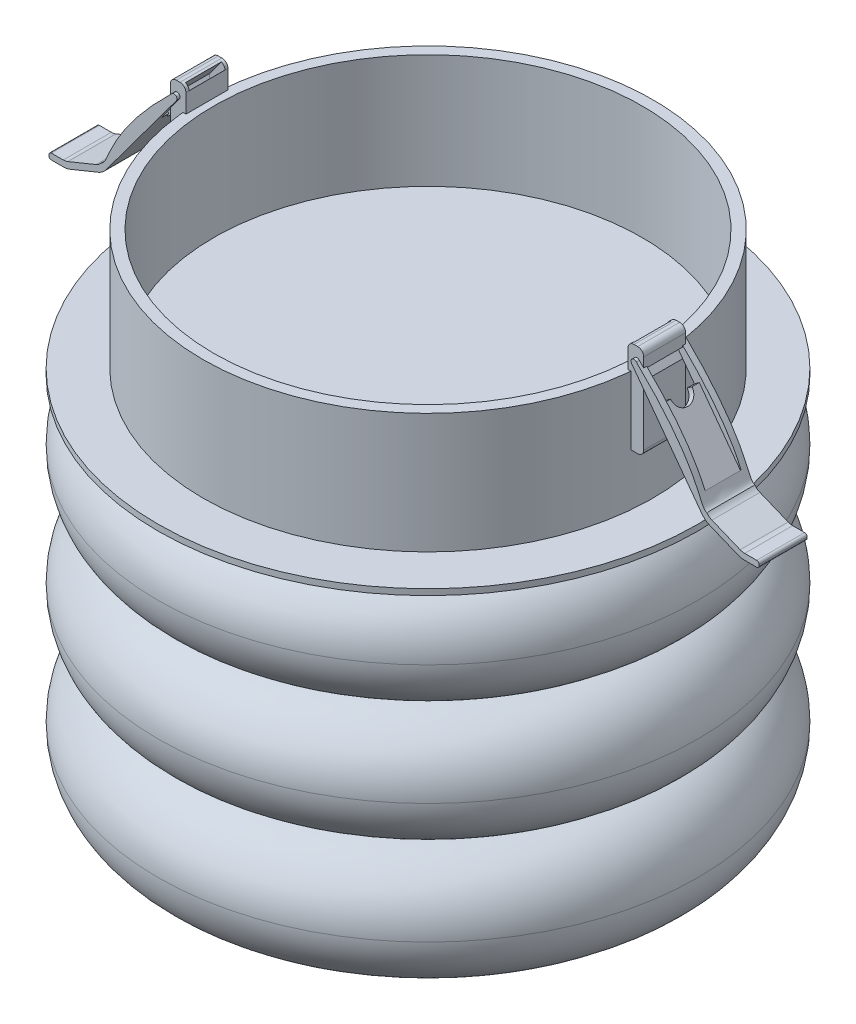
ISO-10303-21;
HEADER;
FILE_DESCRIPTION(('STEP AP214'),'2;1');
FILE_NAME('part.step','',(''),(''),'','','');
FILE_SCHEMA(('AUTOMOTIVE_DESIGN { 1 0 10303 214 1 1 1 1 }'));
ENDSEC;
DATA;
#1=APPLICATION_CONTEXT('core data for automotive mechanical design processes');
#2=APPLICATION_PROTOCOL_DEFINITION('international standard','automotive_design',2000,#1);
#3=PRODUCT_CONTEXT('',#1,'mechanical');
#4=PRODUCT('Part','Part','',(#3));
#5=PRODUCT_RELATED_PRODUCT_CATEGORY('part','',(#4));
#6=PRODUCT_DEFINITION_FORMATION('','',#4);
#7=PRODUCT_DEFINITION_CONTEXT('part definition',#1,'design');
#8=PRODUCT_DEFINITION('design','',#6,#7);
#9=PRODUCT_DEFINITION_SHAPE('','',#8);
#10=(LENGTH_UNIT() NAMED_UNIT(*) SI_UNIT(.MILLI.,.METRE.));
#11=(NAMED_UNIT(*) PLANE_ANGLE_UNIT() SI_UNIT($,.RADIAN.));
#12=(NAMED_UNIT(*) SI_UNIT($,.STERADIAN.) SOLID_ANGLE_UNIT());
#13=UNCERTAINTY_MEASURE_WITH_UNIT(LENGTH_MEASURE(1.E-05),#10,'distance_accuracy_value','');
#14=(GEOMETRIC_REPRESENTATION_CONTEXT(3) GLOBAL_UNCERTAINTY_ASSIGNED_CONTEXT((#13)) GLOBAL_UNIT_ASSIGNED_CONTEXT((#10,
#11,#12)) REPRESENTATION_CONTEXT('',''));
#15=CARTESIAN_POINT('',(0.,0.,0.));
#16=DIRECTION('',(0.,0.,1.));
#17=DIRECTION('',(1.,0.,0.));
#18=AXIS2_PLACEMENT_3D('',#15,#16,#17);
#19=CARTESIAN_POINT('',(4.75762274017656,-10.7639937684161,0.));
#20=DIRECTION('',(0.,-1.,0.));
#21=DIRECTION('',(0.,0.,-1.));
#22=AXIS2_PLACEMENT_3D('',#19,#20,#21);
#23=CYLINDRICAL_SURFACE('',#22,45.);
#24=CARTESIAN_POINT('',(4.75762274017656,-10.7639937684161,0.));
#25=DIRECTION('',(0.,1.,0.));
#26=DIRECTION('',(0.,0.,1.));
#27=AXIS2_PLACEMENT_3D('',#24,#25,#26);
#28=CIRCLE('',#27,45.);
#29=CARTESIAN_POINT('',(4.75762274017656,-10.7639937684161,45.));
#30=VERTEX_POINT('',#29);
#31=EDGE_CURVE('P0_E22',#30,#30,#28,.T.);
#32=ORIENTED_EDGE('',*,*,#31,.F.);
#33=EDGE_LOOP('',(#32));
#34=FACE_BOUND('',#33,.T.);
#35=CARTESIAN_POINT('',(4.75762274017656,-11.7639937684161,0.));
#36=DIRECTION('',(0.,1.,0.));
#37=DIRECTION('',(0.,0.,1.));
#38=AXIS2_PLACEMENT_3D('',#35,#36,#37);
#39=CIRCLE('',#38,45.);
#40=CARTESIAN_POINT('',(4.75762274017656,-11.7639937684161,45.));
#41=VERTEX_POINT('',#40);
#42=EDGE_CURVE('P0_E27',#41,#41,#39,.T.);
#43=ORIENTED_EDGE('',*,*,#42,.T.);
#44=EDGE_LOOP('',(#43));
#45=FACE_BOUND('',#44,.T.);
#46=ADVANCED_FACE('P0_F15',(#34,#45),#23,.T.);
#47=CARTESIAN_POINT('',(4.75762274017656,-10.7639937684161,0.));
#48=DIRECTION('',(0.,1.,0.));
#49=DIRECTION('',(0.,0.,1.));
#50=AXIS2_PLACEMENT_3D('',#47,#48,#49);
#51=PLANE('',#50);
#52=CARTESIAN_POINT('',(4.75762274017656,-10.7639937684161,0.));
#53=DIRECTION('',(0.,1.,0.));
#54=DIRECTION('',(0.,0.,1.));
#55=AXIS2_PLACEMENT_3D('',#52,#53,#54);
#56=CIRCLE('',#55,37.5);
#57=CARTESIAN_POINT('',(4.75762274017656,-10.7639937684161,37.5));
#58=VERTEX_POINT('',#57);
#59=EDGE_CURVE('P0_E10',#58,#58,#56,.T.);
#60=ORIENTED_EDGE('',*,*,#59,.F.);
#61=EDGE_LOOP('',(#60));
#62=FACE_BOUND('',#61,.T.);
#63=ORIENTED_EDGE('',*,*,#31,.T.);
#64=EDGE_LOOP('',(#63));
#65=FACE_BOUND('',#64,.T.);
#66=ADVANCED_FACE('P0_F61',(#62,#65),#51,.T.);
#67=CARTESIAN_POINT('',(4.75762274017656,-11.7639937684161,0.));
#68=DIRECTION('',(0.,1.,0.));
#69=DIRECTION('',(0.,0.,1.));
#70=AXIS2_PLACEMENT_3D('',#67,#68,#69);
#71=PLANE('',#70);
#72=ORIENTED_EDGE('',*,*,#42,.F.);
#73=EDGE_LOOP('',(#72));
#74=FACE_BOUND('',#73,.T.);
#75=ADVANCED_FACE('P0_F66',(#74),#71,.F.);
#76=CARTESIAN_POINT('',(4.75762274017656,9.23600623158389,0.));
#77=DIRECTION('',(0.,-1.,0.));
#78=DIRECTION('',(0.,0.,-1.));
#79=AXIS2_PLACEMENT_3D('',#76,#77,#78);
#80=CYLINDRICAL_SURFACE('',#79,37.5);
#81=CARTESIAN_POINT('',(4.75762274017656,9.23600623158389,0.));
#82=DIRECTION('',(0.,1.,0.));
#83=DIRECTION('',(0.,0.,1.));
#84=AXIS2_PLACEMENT_3D('',#81,#82,#83);
#85=CIRCLE('',#84,37.5);
#86=CARTESIAN_POINT('',(4.75762274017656,9.23600623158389,37.5));
#87=VERTEX_POINT('',#86);
#88=EDGE_CURVE('P0_E30',#87,#87,#85,.T.);
#89=ORIENTED_EDGE('',*,*,#88,.F.);
#90=EDGE_LOOP('',(#89));
#91=FACE_BOUND('',#90,.T.);
#92=ORIENTED_EDGE('',*,*,#59,.T.);
#93=EDGE_LOOP('',(#92));
#94=FACE_BOUND('',#93,.T.);
#95=ADVANCED_FACE('P0_F58',(#91,#94),#80,.T.);
#96=CARTESIAN_POINT('',(4.75762274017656,9.23600623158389,0.));
#97=DIRECTION('',(0.,1.,0.));
#98=DIRECTION('',(0.,0.,1.));
#99=AXIS2_PLACEMENT_3D('',#96,#97,#98);
#100=PLANE('',#99);
#101=CARTESIAN_POINT('',(4.75762274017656,9.23600623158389,0.));
#102=DIRECTION('',(0.,1.,0.));
#103=DIRECTION('',(0.,0.,1.));
#104=AXIS2_PLACEMENT_3D('',#101,#102,#103);
#105=CIRCLE('',#104,35.7106361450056);
#106=CARTESIAN_POINT('',(4.75762274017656,9.23600623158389,35.7106361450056));
#107=VERTEX_POINT('',#106);
#108=EDGE_CURVE('P0_E18',#107,#107,#105,.F.);
#109=ORIENTED_EDGE('',*,*,#108,.T.);
#110=EDGE_LOOP('',(#109));
#111=FACE_BOUND('',#110,.T.);
#112=ORIENTED_EDGE('',*,*,#88,.T.);
#113=EDGE_LOOP('',(#112));
#114=FACE_BOUND('',#113,.T.);
#115=ADVANCED_FACE('P0_F49',(#111,#114),#100,.T.);
#116=CARTESIAN_POINT('',(4.75762274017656,24.2360062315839,0.));
#117=DIRECTION('',(0.,-1.,0.));
#118=DIRECTION('',(0.,0.,-1.));
#119=AXIS2_PLACEMENT_3D('',#116,#117,#118);
#120=CYLINDRICAL_SURFACE('',#119,35.7106361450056);
#121=ORIENTED_EDGE('',*,*,#108,.F.);
#122=EDGE_LOOP('',(#121));
#123=FACE_BOUND('',#122,.T.);
#124=CARTESIAN_POINT('',(4.75762274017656,-9.7639937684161,0.));
#125=DIRECTION('',(0.,1.,0.));
#126=DIRECTION('',(0.,0.,1.));
#127=AXIS2_PLACEMENT_3D('',#124,#125,#126);
#128=CIRCLE('',#127,35.7106361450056);
#129=CARTESIAN_POINT('',(4.75762274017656,-9.7639937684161,35.7106361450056));
#130=VERTEX_POINT('',#129);
#131=EDGE_CURVE('P0_E39',#130,#130,#128,.T.);
#132=ORIENTED_EDGE('',*,*,#131,.F.);
#133=EDGE_LOOP('',(#132));
#134=FACE_BOUND('',#133,.T.);
#135=ADVANCED_FACE('P0_F47',(#123,#134),#120,.F.);
#136=CARTESIAN_POINT('',(4.75762274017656,-9.7639937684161,0.));
#137=DIRECTION('',(0.,1.,0.));
#138=DIRECTION('',(0.,0.,1.));
#139=AXIS2_PLACEMENT_3D('',#136,#137,#138);
#140=PLANE('',#139);
#141=ORIENTED_EDGE('',*,*,#131,.T.);
#142=EDGE_LOOP('',(#141));
#143=FACE_BOUND('',#142,.T.);
#144=ADVANCED_FACE('P0_F45',(#143),#140,.T.);
#145=CLOSED_SHELL('',(#46,#66,#75,#95,#115,#135,#144));
#146=MANIFOLD_SOLID_BREP('P0_B1',#145);
#147=CARTESIAN_POINT('',(-33.0754010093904,12.3360778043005,3.5));
#148=DIRECTION('',(0.,0.,-1.));
#149=DIRECTION('',(-1.,0.,0.));
#150=AXIS2_PLACEMENT_3D('',#147,#148,#149);
#151=CYLINDRICAL_SURFACE('',#150,1.);
#152=CARTESIAN_POINT('',(-33.0754010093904,12.3360778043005,-3.5));
#153=DIRECTION('',(0.,0.,1.));
#154=DIRECTION('',(-1.,0.,0.));
#155=AXIS2_PLACEMENT_3D('',#152,#153,#154);
#156=CIRCLE('',#155,1.);
#157=CARTESIAN_POINT('',(-32.0754010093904,12.3360778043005,-3.5));
#158=VERTEX_POINT('',#157);
#159=CARTESIAN_POINT('',(-33.0754010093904,13.3360778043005,-3.5));
#160=VERTEX_POINT('',#159);
#161=EDGE_CURVE('P1_E148',#158,#160,#156,.T.);
#162=ORIENTED_EDGE('',*,*,#161,.T.);
#163=DIRECTION('',(0.,0.,-1.));
#164=VECTOR('',#163,1.);
#165=CARTESIAN_POINT('',(-33.0754010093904,13.3360778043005,3.5));
#166=LINE('',#165,#164);
#167=CARTESIAN_POINT('',(-33.0754010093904,13.3360778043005,3.5));
#168=VERTEX_POINT('',#167);
#169=EDGE_CURVE('P1_E118',#168,#160,#166,.T.);
#170=ORIENTED_EDGE('',*,*,#169,.F.);
#171=CARTESIAN_POINT('',(-33.0754010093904,12.3360778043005,3.5));
#172=DIRECTION('',(0.,0.,1.));
#173=DIRECTION('',(-1.,0.,0.));
#174=AXIS2_PLACEMENT_3D('',#171,#172,#173);
#175=CIRCLE('',#174,1.);
#176=CARTESIAN_POINT('',(-32.0754010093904,12.3360778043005,3.5));
#177=VERTEX_POINT('',#176);
#178=EDGE_CURVE('P1_E162',#177,#168,#175,.T.);
#179=ORIENTED_EDGE('',*,*,#178,.F.);
#180=DIRECTION('',(0.,0.,-1.));
#181=VECTOR('',#180,1.);
#182=CARTESIAN_POINT('',(-32.0754010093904,12.3360778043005,3.5));
#183=LINE('',#182,#181);
#184=EDGE_CURVE('P1_E102',#177,#158,#183,.T.);
#185=ORIENTED_EDGE('',*,*,#184,.T.);
#186=EDGE_LOOP('',(#162,#170,#179,#185));
#187=FACE_BOUND('',#186,.T.);
#188=DIRECTION('',(0.,0.,-1.));
#189=VECTOR('',#188,1.);
#190=CARTESIAN_POINT('',(-32.0756652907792,12.359066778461,3.5));
#191=LINE('',#190,#189);
#192=CARTESIAN_POINT('',(-32.0756652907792,12.359066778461,2.9851983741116));
#193=VERTEX_POINT('',#192);
#194=CARTESIAN_POINT('',(-32.0756652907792,12.359066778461,-3.));
#195=VERTEX_POINT('',#194);
#196=EDGE_CURVE('P1_E170',#193,#195,#191,.T.);
#197=ORIENTED_EDGE('',*,*,#196,.F.);
#198=CARTESIAN_POINT('',(-33.0754010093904,12.3360778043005,2.9851983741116));
#199=DIRECTION('',(0.,0.,1.));
#200=DIRECTION('',(0.,-1.,0.));
#201=AXIS2_PLACEMENT_3D('',#198,#199,#200);
#202=CIRCLE('',#201,1.);
#203=CARTESIAN_POINT('',(-32.6625493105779,13.2468760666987,2.9851983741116));
#204=VERTEX_POINT('',#203);
#205=EDGE_CURVE('P1_E167',#193,#204,#202,.T.);
#206=ORIENTED_EDGE('',*,*,#205,.T.);
#207=DIRECTION('',(0.,0.,-1.));
#208=VECTOR('',#207,1.);
#209=CARTESIAN_POINT('',(-32.6625493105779,13.2468760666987,3.5));
#210=LINE('',#209,#208);
#211=CARTESIAN_POINT('',(-32.6625493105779,13.2468760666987,-3.));
#212=VERTEX_POINT('',#211);
#213=EDGE_CURVE('P1_E172',#204,#212,#210,.T.);
#214=ORIENTED_EDGE('',*,*,#213,.T.);
#215=CARTESIAN_POINT('',(-33.0754010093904,12.3360778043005,-3.));
#216=DIRECTION('',(0.,0.,-1.));
#217=DIRECTION('',(-1.,0.,0.));
#218=AXIS2_PLACEMENT_3D('',#215,#216,#217);
#219=CIRCLE('',#218,1.);
#220=EDGE_CURVE('P1_E109',#212,#195,#219,.T.);
#221=ORIENTED_EDGE('',*,*,#220,.T.);
#222=EDGE_LOOP('',(#197,#206,#214,#221));
#223=FACE_BOUND('',#222,.T.);
#224=ADVANCED_FACE('P1_F17',(#187,#223),#151,.T.);
#225=CARTESIAN_POINT('',(-34.6846479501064,-1.13140897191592,3.5));
#226=DIRECTION('',(1.,0.,0.));
#227=DIRECTION('',(0.,0.,-1.));
#228=AXIS2_PLACEMENT_3D('',#225,#226,#227);
#229=PLANE('',#228);
#230=DIRECTION('',(0.,-1.,0.));
#231=VECTOR('',#230,1.);
#232=CARTESIAN_POINT('',(-34.6846479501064,-1.13140897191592,-3.5));
#233=LINE('',#232,#231);
#234=CARTESIAN_POINT('',(-34.6846479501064,12.3360778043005,-3.5));
#235=VERTEX_POINT('',#234);
#236=CARTESIAN_POINT('',(-34.6846479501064,-1.13140897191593,-3.5));
#237=VERTEX_POINT('',#236);
#238=EDGE_CURVE('P1_E142',#235,#237,#233,.T.);
#239=ORIENTED_EDGE('',*,*,#238,.T.);
#240=DIRECTION('',(0.,0.,-1.));
#241=VECTOR('',#240,1.);
#242=CARTESIAN_POINT('',(-34.6846479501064,-1.13140897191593,3.5));
#243=LINE('',#242,#241);
#244=CARTESIAN_POINT('',(-34.6846479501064,-1.13140897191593,3.5));
#245=VERTEX_POINT('',#244);
#246=EDGE_CURVE('P1_E127',#245,#237,#243,.T.);
#247=ORIENTED_EDGE('',*,*,#246,.F.);
#248=DIRECTION('',(0.,-1.,0.));
#249=VECTOR('',#248,1.);
#250=CARTESIAN_POINT('',(-34.6846479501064,-1.13140897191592,3.5));
#251=LINE('',#250,#249);
#252=CARTESIAN_POINT('',(-34.6846479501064,12.3360778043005,3.5));
#253=VERTEX_POINT('',#252);
#254=EDGE_CURVE('P1_E156',#253,#245,#251,.T.);
#255=ORIENTED_EDGE('',*,*,#254,.F.);
#256=DIRECTION('',(0.,0.,-1.));
#257=VECTOR('',#256,1.);
#258=CARTESIAN_POINT('',(-34.6846479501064,12.3360778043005,3.5));
#259=LINE('',#258,#257);
#260=EDGE_CURVE('P1_E124',#253,#235,#259,.T.);
#261=ORIENTED_EDGE('',*,*,#260,.T.);
#262=EDGE_LOOP('',(#239,#247,#255,#261));
#263=FACE_BOUND('',#262,.T.);
#264=DIRECTION('',(0.,0.,1.));
#265=VECTOR('',#264,1.);
#266=CARTESIAN_POINT('',(-34.6846479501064,8.83606189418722,3.5));
#267=LINE('',#266,#265);
#268=CARTESIAN_POINT('',(-34.6846479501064,8.83606189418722,-3.));
#269=VERTEX_POINT('',#268);
#270=CARTESIAN_POINT('',(-34.6846479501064,8.83606189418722,2.9851983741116));
#271=VERTEX_POINT('',#270);
#272=EDGE_CURVE('P1_E11',#269,#271,#267,.T.);
#273=ORIENTED_EDGE('',*,*,#272,.F.);
#274=DIRECTION('',(0.,1.,0.));
#275=VECTOR('',#274,1.);
#276=CARTESIAN_POINT('',(-34.6846479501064,-1.13140897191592,-3.));
#277=LINE('',#276,#275);
#278=CARTESIAN_POINT('',(-34.6846479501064,10.5163621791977,-3.));
#279=VERTEX_POINT('',#278);
#280=EDGE_CURVE('P1_E25',#269,#279,#277,.T.);
#281=ORIENTED_EDGE('',*,*,#280,.T.);
#282=DIRECTION('',(0.,0.,1.));
#283=VECTOR('',#282,1.);
#284=CARTESIAN_POINT('',(-34.6846479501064,10.5163621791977,3.5));
#285=LINE('',#284,#283);
#286=CARTESIAN_POINT('',(-34.6846479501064,10.5163621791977,2.9851983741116));
#287=VERTEX_POINT('',#286);
#288=EDGE_CURVE('P1_E96',#279,#287,#285,.T.);
#289=ORIENTED_EDGE('',*,*,#288,.T.);
#290=DIRECTION('',(0.,-1.,0.));
#291=VECTOR('',#290,1.);
#292=CARTESIAN_POINT('',(-34.6846479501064,-1.13140897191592,2.9851983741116));
#293=LINE('',#292,#291);
#294=EDGE_CURVE('P1_E101',#287,#271,#293,.T.);
#295=ORIENTED_EDGE('',*,*,#294,.T.);
#296=EDGE_LOOP('',(#273,#281,#289,#295));
#297=FACE_BOUND('',#296,.T.);
#298=ADVANCED_FACE('P1_F113',(#263,#297),#229,.F.);
#299=CARTESIAN_POINT('',(-32.0754010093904,-2.13140897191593,3.5));
#300=DIRECTION('',(-1.,0.,0.));
#301=DIRECTION('',(0.,0.,1.));
#302=AXIS2_PLACEMENT_3D('',#299,#300,#301);
#303=PLANE('',#302);
#304=DIRECTION('',(0.,1.,0.));
#305=VECTOR('',#304,1.);
#306=CARTESIAN_POINT('',(-32.0754010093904,-2.13140897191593,-3.5));
#307=LINE('',#306,#305);
#308=CARTESIAN_POINT('',(-32.0754010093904,-2.13140897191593,-3.5));
#309=VERTEX_POINT('',#308);
#310=EDGE_CURVE('P1_E150',#309,#158,#307,.T.);
#311=ORIENTED_EDGE('',*,*,#310,.T.);
#312=ORIENTED_EDGE('',*,*,#184,.F.);
#313=DIRECTION('',(0.,1.,0.));
#314=VECTOR('',#313,1.);
#315=CARTESIAN_POINT('',(-32.0754010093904,-2.13140897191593,3.5));
#316=LINE('',#315,#314);
#317=CARTESIAN_POINT('',(-32.0754010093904,-2.13140897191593,3.5));
#318=VERTEX_POINT('',#317);
#319=EDGE_CURVE('P1_E139',#318,#177,#316,.T.);
#320=ORIENTED_EDGE('',*,*,#319,.F.);
#321=DIRECTION('',(0.,0.,-1.));
#322=VECTOR('',#321,1.);
#323=CARTESIAN_POINT('',(-32.0754010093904,-2.13140897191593,3.5));
#324=LINE('',#323,#322);
#325=EDGE_CURVE('P1_E133',#318,#309,#324,.T.);
#326=ORIENTED_EDGE('',*,*,#325,.T.);
#327=EDGE_LOOP('',(#311,#312,#320,#326));
#328=FACE_BOUND('',#327,.T.);
#329=ADVANCED_FACE('P1_F19',(#328),#303,.F.);
#330=CARTESIAN_POINT('',(-33.6846479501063,13.3360778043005,3.5));
#331=DIRECTION('',(0.,-1.,0.));
#332=DIRECTION('',(0.,0.,-1.));
#333=AXIS2_PLACEMENT_3D('',#330,#331,#332);
#334=PLANE('',#333);
#335=DIRECTION('',(-1.,0.,0.));
#336=VECTOR('',#335,1.);
#337=CARTESIAN_POINT('',(-33.6846479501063,13.3360778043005,-3.5));
#338=LINE('',#337,#336);
#339=CARTESIAN_POINT('',(-33.6846479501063,13.3360778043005,-3.5));
#340=VERTEX_POINT('',#339);
#341=EDGE_CURVE('P1_E146',#160,#340,#338,.T.);
#342=ORIENTED_EDGE('',*,*,#341,.T.);
#343=DIRECTION('',(0.,0.,-1.));
#344=VECTOR('',#343,1.);
#345=CARTESIAN_POINT('',(-33.6846479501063,13.3360778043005,3.5));
#346=LINE('',#345,#344);
#347=CARTESIAN_POINT('',(-33.6846479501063,13.3360778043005,3.5));
#348=VERTEX_POINT('',#347);
#349=EDGE_CURVE('P1_E121',#348,#340,#346,.T.);
#350=ORIENTED_EDGE('',*,*,#349,.F.);
#351=DIRECTION('',(-1.,0.,0.));
#352=VECTOR('',#351,1.);
#353=CARTESIAN_POINT('',(-33.6846479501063,13.3360778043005,3.5));
#354=LINE('',#353,#352);
#355=EDGE_CURVE('P1_E160',#168,#348,#354,.T.);
#356=ORIENTED_EDGE('',*,*,#355,.F.);
#357=ORIENTED_EDGE('',*,*,#169,.T.);
#358=EDGE_LOOP('',(#342,#350,#356,#357));
#359=FACE_BOUND('',#358,.T.);
#360=ADVANCED_FACE('P1_F205',(#359),#334,.F.);
#361=CARTESIAN_POINT('',(-33.6846479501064,12.3360778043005,3.5));
#362=DIRECTION('',(0.,0.,-1.));
#363=DIRECTION('',(-1.,0.,0.));
#364=AXIS2_PLACEMENT_3D('',#361,#362,#363);
#365=CYLINDRICAL_SURFACE('',#364,1.);
#366=CARTESIAN_POINT('',(-33.6846479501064,12.3360778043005,-3.5));
#367=DIRECTION('',(0.,0.,1.));
#368=DIRECTION('',(-1.,0.,0.));
#369=AXIS2_PLACEMENT_3D('',#366,#367,#368);
#370=CIRCLE('',#369,1.);
#371=EDGE_CURVE('P1_E144',#340,#235,#370,.T.);
#372=ORIENTED_EDGE('',*,*,#371,.T.);
#373=ORIENTED_EDGE('',*,*,#260,.F.);
#374=CARTESIAN_POINT('',(-33.6846479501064,12.3360778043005,3.5));
#375=DIRECTION('',(0.,0.,1.));
#376=DIRECTION('',(-1.,0.,0.));
#377=AXIS2_PLACEMENT_3D('',#374,#375,#376);
#378=CIRCLE('',#377,1.);
#379=EDGE_CURVE('P1_E158',#348,#253,#378,.T.);
#380=ORIENTED_EDGE('',*,*,#379,.F.);
#381=ORIENTED_EDGE('',*,*,#349,.T.);
#382=EDGE_LOOP('',(#372,#373,#380,#381));
#383=FACE_BOUND('',#382,.T.);
#384=ADVANCED_FACE('P1_F208',(#383),#365,.T.);
#385=CARTESIAN_POINT('',(-33.6846479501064,-1.13140897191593,3.5));
#386=DIRECTION('',(0.,0.,-1.));
#387=DIRECTION('',(-1.,0.,0.));
#388=AXIS2_PLACEMENT_3D('',#385,#386,#387);
#389=CYLINDRICAL_SURFACE('',#388,1.);
#390=CARTESIAN_POINT('',(-33.6846479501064,-1.13140897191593,-3.5));
#391=DIRECTION('',(0.,0.,1.));
#392=DIRECTION('',(-1.,0.,0.));
#393=AXIS2_PLACEMENT_3D('',#390,#391,#392);
#394=CIRCLE('',#393,1.);
#395=CARTESIAN_POINT('',(-33.6846479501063,-2.13140897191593,-3.5));
#396=VERTEX_POINT('',#395);
#397=EDGE_CURVE('P1_E140',#237,#396,#394,.T.);
#398=ORIENTED_EDGE('',*,*,#397,.T.);
#399=DIRECTION('',(0.,0.,-1.));
#400=VECTOR('',#399,1.);
#401=CARTESIAN_POINT('',(-33.6846479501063,-2.13140897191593,3.5));
#402=LINE('',#401,#400);
#403=CARTESIAN_POINT('',(-33.6846479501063,-2.13140897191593,3.5));
#404=VERTEX_POINT('',#403);
#405=EDGE_CURVE('P1_E130',#404,#396,#402,.T.);
#406=ORIENTED_EDGE('',*,*,#405,.F.);
#407=CARTESIAN_POINT('',(-33.6846479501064,-1.13140897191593,3.5));
#408=DIRECTION('',(0.,0.,1.));
#409=DIRECTION('',(-1.,0.,0.));
#410=AXIS2_PLACEMENT_3D('',#407,#408,#409);
#411=CIRCLE('',#410,1.);
#412=EDGE_CURVE('P1_E154',#245,#404,#411,.T.);
#413=ORIENTED_EDGE('',*,*,#412,.F.);
#414=ORIENTED_EDGE('',*,*,#246,.T.);
#415=EDGE_LOOP('',(#398,#406,#413,#414));
#416=FACE_BOUND('',#415,.T.);
#417=ADVANCED_FACE('P1_F211',(#416),#389,.T.);
#418=CARTESIAN_POINT('',(-33.6846479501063,-2.13140897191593,3.5));
#419=DIRECTION('',(0.,1.,0.));
#420=DIRECTION('',(0.,0.,1.));
#421=AXIS2_PLACEMENT_3D('',#418,#419,#420);
#422=PLANE('',#421);
#423=DIRECTION('',(1.,0.,0.));
#424=VECTOR('',#423,1.);
#425=CARTESIAN_POINT('',(-33.6846479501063,-2.13140897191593,-3.5));
#426=LINE('',#425,#424);
#427=EDGE_CURVE('P1_E137',#396,#309,#426,.T.);
#428=ORIENTED_EDGE('',*,*,#427,.T.);
#429=ORIENTED_EDGE('',*,*,#325,.F.);
#430=DIRECTION('',(1.,0.,0.));
#431=VECTOR('',#430,1.);
#432=CARTESIAN_POINT('',(-33.6846479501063,-2.13140897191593,3.5));
#433=LINE('',#432,#431);
#434=EDGE_CURVE('P1_E136',#404,#318,#433,.T.);
#435=ORIENTED_EDGE('',*,*,#434,.F.);
#436=ORIENTED_EDGE('',*,*,#405,.T.);
#437=EDGE_LOOP('',(#428,#429,#435,#436));
#438=FACE_BOUND('',#437,.T.);
#439=ADVANCED_FACE('P1_F216',(#438),#422,.F.);
#440=CARTESIAN_POINT('',(-33.0754010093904,12.3360778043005,3.5));
#441=DIRECTION('',(0.,0.,-1.));
#442=DIRECTION('',(-1.,0.,0.));
#443=AXIS2_PLACEMENT_3D('',#440,#441,#442);
#444=PLANE('',#443);
#445=ORIENTED_EDGE('',*,*,#319,.T.);
#446=ORIENTED_EDGE('',*,*,#178,.T.);
#447=ORIENTED_EDGE('',*,*,#355,.T.);
#448=ORIENTED_EDGE('',*,*,#379,.T.);
#449=ORIENTED_EDGE('',*,*,#254,.T.);
#450=ORIENTED_EDGE('',*,*,#412,.T.);
#451=ORIENTED_EDGE('',*,*,#434,.T.);
#452=EDGE_LOOP('',(#445,#446,#447,#448,#449,#450,#451));
#453=FACE_BOUND('',#452,.T.);
#454=ADVANCED_FACE('P1_F220',(#453),#444,.F.);
#455=CARTESIAN_POINT('',(-33.0754010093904,12.3360778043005,-3.5));
#456=DIRECTION('',(0.,0.,-1.));
#457=DIRECTION('',(-1.,0.,0.));
#458=AXIS2_PLACEMENT_3D('',#455,#456,#457);
#459=PLANE('',#458);
#460=ORIENTED_EDGE('',*,*,#310,.F.);
#461=ORIENTED_EDGE('',*,*,#427,.F.);
#462=ORIENTED_EDGE('',*,*,#397,.F.);
#463=ORIENTED_EDGE('',*,*,#238,.F.);
#464=ORIENTED_EDGE('',*,*,#371,.F.);
#465=ORIENTED_EDGE('',*,*,#341,.F.);
#466=ORIENTED_EDGE('',*,*,#161,.F.);
#467=EDGE_LOOP('',(#460,#461,#462,#463,#464,#465,#466));
#468=FACE_BOUND('',#467,.T.);
#469=ADVANCED_FACE('P1_F194',(#468),#459,.T.);
#470=CARTESIAN_POINT('',(-30.1811372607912,14.9173173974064,-3.));
#471=DIRECTION('',(0.,0.,-1.));
#472=DIRECTION('',(-1.,0.,0.));
#473=AXIS2_PLACEMENT_3D('',#470,#471,#472);
#474=PLANE('',#473);
#475=DIRECTION('',(-0.595131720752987,-0.803628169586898,0.));
#476=VECTOR('',#475,1.);
#477=CARTESIAN_POINT('',(-30.9847654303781,15.5124491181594,-3.));
#478=LINE('',#477,#476);
#479=EDGE_CURVE('P1_E32',#212,#279,#478,.T.);
#480=ORIENTED_EDGE('',*,*,#479,.T.);
#481=ORIENTED_EDGE('',*,*,#280,.F.);
#482=DIRECTION('',(-0.595131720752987,-0.803628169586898,0.));
#483=VECTOR('',#482,1.);
#484=CARTESIAN_POINT('',(-30.1811372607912,14.9173173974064,-3.));
#485=LINE('',#484,#483);
#486=EDGE_CURVE('P1_E175',#195,#269,#485,.T.);
#487=ORIENTED_EDGE('',*,*,#486,.F.);
#488=ORIENTED_EDGE('',*,*,#220,.F.);
#489=EDGE_LOOP('',(#480,#481,#487,#488));
#490=FACE_BOUND('',#489,.T.);
#491=ADVANCED_FACE('P1_F105',(#490),#474,.F.);
#492=CARTESIAN_POINT('',(-30.1811372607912,14.9173173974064,2.9851983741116));
#493=DIRECTION('',(0.,0.,1.));
#494=DIRECTION('',(0.,-1.,0.));
#495=AXIS2_PLACEMENT_3D('',#492,#493,#494);
#496=PLANE('',#495);
#497=DIRECTION('',(0.595131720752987,0.803628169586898,0.));
#498=VECTOR('',#497,1.);
#499=CARTESIAN_POINT('',(-30.1811372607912,14.9173173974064,2.9851983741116));
#500=LINE('',#499,#498);
#501=EDGE_CURVE('P1_E174',#271,#193,#500,.T.);
#502=ORIENTED_EDGE('',*,*,#501,.F.);
#503=ORIENTED_EDGE('',*,*,#294,.F.);
#504=DIRECTION('',(0.595131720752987,0.803628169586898,0.));
#505=VECTOR('',#504,1.);
#506=CARTESIAN_POINT('',(-30.9847654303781,15.5124491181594,2.9851983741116));
#507=LINE('',#506,#505);
#508=EDGE_CURVE('P1_E37',#287,#204,#507,.T.);
#509=ORIENTED_EDGE('',*,*,#508,.T.);
#510=ORIENTED_EDGE('',*,*,#205,.F.);
#511=EDGE_LOOP('',(#502,#503,#509,#510));
#512=FACE_BOUND('',#511,.T.);
#513=ADVANCED_FACE('P1_F185',(#512),#496,.F.);
#514=CARTESIAN_POINT('',(-36.6465695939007,6.18680720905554,-0.00740081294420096));
#515=DIRECTION('',(-0.803628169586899,0.595131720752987,0.));
#516=DIRECTION('',(-0.595131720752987,-0.803628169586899,0.));
#517=AXIS2_PLACEMENT_3D('',#514,#515,#516);
#518=PLANE('',#517);
#519=ORIENTED_EDGE('',*,*,#196,.T.);
#520=ORIENTED_EDGE('',*,*,#486,.T.);
#521=ORIENTED_EDGE('',*,*,#272,.T.);
#522=ORIENTED_EDGE('',*,*,#501,.T.);
#523=EDGE_LOOP('',(#519,#520,#521,#522));
#524=FACE_BOUND('',#523,.T.);
#525=ADVANCED_FACE('P1_F180',(#524),#518,.T.);
#526=CARTESIAN_POINT('',(-37.4501977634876,6.78193892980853,-0.00740081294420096));
#527=DIRECTION('',(-0.803628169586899,0.595131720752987,0.));
#528=DIRECTION('',(-0.595131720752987,-0.803628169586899,0.));
#529=AXIS2_PLACEMENT_3D('',#526,#527,#528);
#530=PLANE('',#529);
#531=ORIENTED_EDGE('',*,*,#508,.F.);
#532=ORIENTED_EDGE('',*,*,#288,.F.);
#533=ORIENTED_EDGE('',*,*,#479,.F.);
#534=ORIENTED_EDGE('',*,*,#213,.F.);
#535=EDGE_LOOP('',(#531,#532,#533,#534));
#536=FACE_BOUND('',#535,.T.);
#537=ADVANCED_FACE('P1_F97',(#536),#530,.F.);
#538=CLOSED_SHELL('',(#224,#298,#329,#360,#384,#417,#439,#454,#469,#491,#513,#525,#537));
#539=MANIFOLD_SOLID_BREP('P1_B1',#538);
#540=CARTESIAN_POINT('',(-33.5688767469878,11.1828787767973,4.));
#541=DIRECTION('',(0.,0.,-1.));
#542=DIRECTION('',(-1.,0.,0.));
#543=AXIS2_PLACEMENT_3D('',#540,#541,#542);
#544=CYLINDRICAL_SURFACE('',#543,0.500000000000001);
#545=DIRECTION('',(0.,0.,-1.));
#546=VECTOR('',#545,1.);
#547=CARTESIAN_POINT('',(-33.9706908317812,11.4804446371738,4.));
#548=LINE('',#547,#546);
#549=CARTESIAN_POINT('',(-33.9706908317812,11.4804446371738,-3.));
#550=VERTEX_POINT('',#549);
#551=CARTESIAN_POINT('',(-33.9706908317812,11.4804446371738,-4.));
#552=VERTEX_POINT('',#551);
#553=EDGE_CURVE('P2_E25',#550,#552,#548,.T.);
#554=ORIENTED_EDGE('',*,*,#553,.F.);
#555=CARTESIAN_POINT('',(-33.5688767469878,11.1828787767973,-3.));
#556=DIRECTION('',(0.,0.,-1.));
#557=DIRECTION('',(-1.,0.,0.));
#558=AXIS2_PLACEMENT_3D('',#555,#556,#557);
#559=CIRCLE('',#558,0.500000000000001);
#560=CARTESIAN_POINT('',(-33.1670626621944,10.8853129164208,-3.));
#561=VERTEX_POINT('',#560);
#562=EDGE_CURVE('P2_E308',#550,#561,#559,.T.);
#563=ORIENTED_EDGE('',*,*,#562,.T.);
#564=DIRECTION('',(0.,0.,-1.));
#565=VECTOR('',#564,1.);
#566=CARTESIAN_POINT('',(-33.1670626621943,10.8853129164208,4.));
#567=LINE('',#566,#565);
#568=CARTESIAN_POINT('',(-33.1670626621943,10.8853129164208,-4.));
#569=VERTEX_POINT('',#568);
#570=EDGE_CURVE('P2_E93',#561,#569,#567,.T.);
#571=ORIENTED_EDGE('',*,*,#570,.T.);
#572=CARTESIAN_POINT('',(-33.5688767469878,11.1828787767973,-4.));
#573=DIRECTION('',(0.,0.,1.));
#574=DIRECTION('',(1.,0.,0.));
#575=AXIS2_PLACEMENT_3D('',#572,#573,#574);
#576=CIRCLE('',#575,0.500000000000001);
#577=EDGE_CURVE('P2_E162',#569,#552,#576,.T.);
#578=ORIENTED_EDGE('',*,*,#577,.T.);
#579=EDGE_LOOP('',(#554,#563,#571,#578));
#580=FACE_BOUND('',#579,.T.);
#581=ADVANCED_FACE('P2_F17',(#580),#544,.T.);
#582=CARTESIAN_POINT('',(-33.9706908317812,11.4804446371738,4.));
#583=CARTESIAN_POINT('',(-44.9336920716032,0.835747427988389,4.));
#584=CARTESIAN_POINT('',(-44.1906093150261,-3.79706733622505,4.));
#585=CARTESIAN_POINT('',(-45.7039620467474,-4.36342141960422,4.));
#586=B_SPLINE_CURVE_WITH_KNOTS('',3,(#582,#583,#584,#585),.UNSPECIFIED.,.F.,.F.,(4,4),(0.,1.),.UNSPECIFIED.);
#587=DIRECTION('',(0.,0.,-1.));
#588=VECTOR('',#587,1.);
#589=SURFACE_OF_LINEAR_EXTRUSION('',#586,#588);
#590=CARTESIAN_POINT('',(-33.9706908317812,11.4804446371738,-3.));
#591=CARTESIAN_POINT('',(-34.3151683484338,11.1459409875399,-3.));
#592=CARTESIAN_POINT('',(-34.6570408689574,10.8087333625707,-3.));
#593=CARTESIAN_POINT('',(-35.3364778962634,10.1268724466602,-3.));
#594=CARTESIAN_POINT('',(-35.6740149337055,9.78219179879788,-3.));
#595=CARTESIAN_POINT('',(-36.3435167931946,9.08535600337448,-3.));
#596=CARTESIAN_POINT('',(-36.6754606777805,8.73318070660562,-3.));
#597=CARTESIAN_POINT('',(-37.3324058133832,8.02123989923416,-3.));
#598=CARTESIAN_POINT('',(-37.6573936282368,7.66146197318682,-3.));
#599=CARTESIAN_POINT('',(-38.2989671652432,6.93411124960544,-3.));
#600=CARTESIAN_POINT('',(-38.6155479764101,6.56653411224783,-3.));
#601=CARTESIAN_POINT('',(-39.2324647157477,5.83072392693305,-3.));
#602=CARTESIAN_POINT('',(-39.5330006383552,5.4626588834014,-3.));
#603=CARTESIAN_POINT('',(-40.1229043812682,4.71821387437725,-3.));
#604=CARTESIAN_POINT('',(-40.4122821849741,4.34184183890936,-3.));
#605=CARTESIAN_POINT('',(-40.978045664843,3.58015267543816,-3.));
#606=CARTESIAN_POINT('',(-41.2544470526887,3.19484725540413,-3.));
#607=CARTESIAN_POINT('',(-41.7921888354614,2.41449873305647,-3.));
#608=CARTESIAN_POINT('',(-42.0535463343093,2.01946744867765,-3.));
#609=CARTESIAN_POINT('',(-42.5588933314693,1.2186538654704,-3.));
#610=CARTESIAN_POINT('',(-42.8028916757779,0.812877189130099,-3.));
#611=CARTESIAN_POINT('',(-43.1217202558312,0.252424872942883,-3.));
#612=CARTESIAN_POINT('',(-43.2052041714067,0.102636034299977,-3.));
#613=CARTESIAN_POINT('',(-43.3694805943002,-0.198444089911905,-3.));
#614=CARTESIAN_POINT('',(-43.4502726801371,-0.349735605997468,-3.));
#615=CARTESIAN_POINT('',(-43.6090945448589,-0.653780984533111,-3.));
#616=CARTESIAN_POINT('',(-43.6871240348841,-0.806534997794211,-3.));
#617=CARTESIAN_POINT('',(-43.8407568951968,-1.11407626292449,-3.));
#618=CARTESIAN_POINT('',(-43.9163484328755,-1.26886942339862,-3.));
#619=CARTESIAN_POINT('',(-44.0649096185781,-1.57969625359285,-3.));
#620=CARTESIAN_POINT('',(-44.1378794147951,-1.73572985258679,-3.));
#621=CARTESIAN_POINT('',(-44.2457153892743,-1.97050043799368,-3.));
#622=CARTESIAN_POINT('',(-44.281387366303,-2.04886928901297,-3.));
#623=CARTESIAN_POINT('',(-44.3523181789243,-2.20579208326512,-3.));
#624=CARTESIAN_POINT('',(-44.3875770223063,-2.28434602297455,-3.));
#625=CARTESIAN_POINT('',(-44.4226918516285,-2.36296388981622,-3.));
#626=B_SPLINE_CURVE_WITH_KNOTS('',3,(#590,#591,#592,#593,#594,#595,#596,#597,#598,#599,#600,
#601,#602,#603,#604,#605,#606,#607,#608,#609,#610,#611,#612,#613,#614,#615,#616,#617,#618,#619,
#620,#621,#622,#623,#624,#625),.UNSPECIFIED.,.F.,.F.,(4,2,2,2,2,2,2,2,2,2,2,2,2,2,2,2,2,4),(0.,
1.4404993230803,2.88770561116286,4.33947732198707,5.79383792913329,7.24903020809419,
8.67438327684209,10.0984299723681,11.5207054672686,12.9413306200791,14.3612265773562,
14.8756534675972,15.390160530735,15.9047212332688,16.4214874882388,16.9382244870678,
17.1965402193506,17.4548510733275),.UNSPECIFIED.);
#627=CARTESIAN_POINT('',(-44.4226918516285,-2.36296388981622,-3.));
#628=VERTEX_POINT('',#627);
#629=EDGE_CURVE('P2_E236',#550,#628,#626,.T.);
#630=ORIENTED_EDGE('',*,*,#629,.F.);
#631=ORIENTED_EDGE('',*,*,#553,.T.);
#632=CARTESIAN_POINT('',(-33.9706908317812,11.4804446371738,-4.));
#633=CARTESIAN_POINT('',(-44.9336920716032,0.835747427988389,-4.));
#634=CARTESIAN_POINT('',(-44.1906093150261,-3.79706733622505,-4.));
#635=CARTESIAN_POINT('',(-45.7039620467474,-4.36342141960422,-4.));
#636=B_SPLINE_CURVE_WITH_KNOTS('',3,(#632,#633,#634,#635),.UNSPECIFIED.,.F.,.F.,(4,4),(0.,1.),.UNSPECIFIED.);
#637=CARTESIAN_POINT('',(-45.7039620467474,-4.36342141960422,-4.));
#638=VERTEX_POINT('',#637);
#639=EDGE_CURVE('P2_E164',#552,#638,#636,.T.);
#640=ORIENTED_EDGE('',*,*,#639,.T.);
#641=DIRECTION('',(0.,0.,-1.));
#642=VECTOR('',#641,1.);
#643=CARTESIAN_POINT('',(-45.7039620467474,-4.36342141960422,4.));
#644=LINE('',#643,#642);
#645=CARTESIAN_POINT('',(-45.7039620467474,-4.36342141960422,4.));
#646=VERTEX_POINT('',#645);
#647=EDGE_CURVE('P2_E224',#646,#638,#644,.T.);
#648=ORIENTED_EDGE('',*,*,#647,.F.);
#649=CARTESIAN_POINT('',(-33.9706908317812,11.4804446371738,4.));
#650=VERTEX_POINT('',#649);
#651=EDGE_CURVE('P2_E101',#650,#646,#586,.T.);
#652=ORIENTED_EDGE('',*,*,#651,.F.);
#653=CARTESIAN_POINT('',(-33.9706908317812,11.4804446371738,3.));
#654=VERTEX_POINT('',#653);
#655=EDGE_CURVE('P2_E11',#650,#654,#548,.T.);
#656=ORIENTED_EDGE('',*,*,#655,.T.);
#657=CARTESIAN_POINT('',(-33.9706908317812,11.4804446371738,3.));
#658=CARTESIAN_POINT('',(-34.3151683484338,11.1459409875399,3.));
#659=CARTESIAN_POINT('',(-34.6570408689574,10.8087333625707,3.));
#660=CARTESIAN_POINT('',(-35.3364778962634,10.1268724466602,3.));
#661=CARTESIAN_POINT('',(-35.6740149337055,9.78219179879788,3.));
#662=CARTESIAN_POINT('',(-36.3435167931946,9.08535600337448,3.));
#663=CARTESIAN_POINT('',(-36.6754606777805,8.73318070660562,3.));
#664=CARTESIAN_POINT('',(-37.3324058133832,8.02123989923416,3.));
#665=CARTESIAN_POINT('',(-37.6573936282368,7.66146197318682,3.));
#666=CARTESIAN_POINT('',(-38.2989671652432,6.93411124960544,3.));
#667=CARTESIAN_POINT('',(-38.6155479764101,6.56653411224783,3.));
#668=CARTESIAN_POINT('',(-39.2324647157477,5.83072392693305,3.));
#669=CARTESIAN_POINT('',(-39.5330006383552,5.4626588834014,3.));
#670=CARTESIAN_POINT('',(-40.1229043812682,4.71821387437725,3.));
#671=CARTESIAN_POINT('',(-40.4122821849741,4.34184183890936,3.));
#672=CARTESIAN_POINT('',(-40.978045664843,3.58015267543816,3.));
#673=CARTESIAN_POINT('',(-41.2544470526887,3.19484725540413,3.));
#674=CARTESIAN_POINT('',(-41.7921888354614,2.41449873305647,3.));
#675=CARTESIAN_POINT('',(-42.0535463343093,2.01946744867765,3.));
#676=CARTESIAN_POINT('',(-42.5588933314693,1.2186538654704,3.));
#677=CARTESIAN_POINT('',(-42.8028916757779,0.812877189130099,3.));
#678=CARTESIAN_POINT('',(-43.1217202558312,0.252424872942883,3.));
#679=CARTESIAN_POINT('',(-43.2052041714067,0.102636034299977,3.));
#680=CARTESIAN_POINT('',(-43.3694805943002,-0.198444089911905,3.));
#681=CARTESIAN_POINT('',(-43.4502726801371,-0.349735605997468,3.));
#682=CARTESIAN_POINT('',(-43.6090945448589,-0.653780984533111,3.));
#683=CARTESIAN_POINT('',(-43.6871240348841,-0.806534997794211,3.));
#684=CARTESIAN_POINT('',(-43.8407568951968,-1.11407626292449,3.));
#685=CARTESIAN_POINT('',(-43.9163484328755,-1.26886942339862,3.));
#686=CARTESIAN_POINT('',(-44.0649096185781,-1.57969625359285,3.));
#687=CARTESIAN_POINT('',(-44.1378794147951,-1.73572985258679,3.));
#688=CARTESIAN_POINT('',(-44.2457153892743,-1.97050043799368,3.));
#689=CARTESIAN_POINT('',(-44.281387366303,-2.04886928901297,3.));
#690=CARTESIAN_POINT('',(-44.3523181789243,-2.20579208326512,3.));
#691=CARTESIAN_POINT('',(-44.3875770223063,-2.28434602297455,3.));
#692=CARTESIAN_POINT('',(-44.4226918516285,-2.36296388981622,3.));
#693=B_SPLINE_CURVE_WITH_KNOTS('',3,(#657,#658,#659,#660,#661,#662,#663,#664,#665,#666,#667,
#668,#669,#670,#671,#672,#673,#674,#675,#676,#677,#678,#679,#680,#681,#682,#683,#684,#685,#686,
#687,#688,#689,#690,#691,#692),.UNSPECIFIED.,.F.,.F.,(4,2,2,2,2,2,2,2,2,2,2,2,2,2,2,2,2,4),(0.,
1.4404993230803,2.88770561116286,4.33947732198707,5.79383792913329,7.24903020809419,
8.67438327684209,10.0984299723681,11.5207054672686,12.9413306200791,14.3612265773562,
14.8756534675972,15.390160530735,15.9047212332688,16.4214874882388,16.9382244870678,
17.1965402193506,17.4548510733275),.UNSPECIFIED.);
#694=CARTESIAN_POINT('',(-44.4226918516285,-2.36296388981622,3.));
#695=VERTEX_POINT('',#694);
#696=EDGE_CURVE('P2_E32',#654,#695,#693,.T.);
#697=ORIENTED_EDGE('',*,*,#696,.T.);
#698=DIRECTION('',(0.,0.,-1.));
#699=VECTOR('',#698,1.);
#700=CARTESIAN_POINT('',(-44.4226918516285,-2.36296388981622,3.));
#701=LINE('',#700,#699);
#702=EDGE_CURVE('P2_E458',#695,#628,#701,.T.);
#703=ORIENTED_EDGE('',*,*,#702,.T.);
#704=EDGE_LOOP('',(#630,#631,#640,#648,#652,#656,#697,#703));
#705=FACE_BOUND('',#704,.T.);
#706=ADVANCED_FACE('P2_F232',(#705),#589,.F.);
#707=CARTESIAN_POINT('',(-33.1670626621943,10.8853129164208,4.));
#708=VERTEX_POINT('',#707);
#709=CARTESIAN_POINT('',(-33.1670626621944,10.8853129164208,2.9851983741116));
#710=VERTEX_POINT('',#709);
#711=EDGE_CURVE('P2_E196',#708,#710,#567,.T.);
#712=ORIENTED_EDGE('',*,*,#711,.T.);
#713=CARTESIAN_POINT('',(-33.5688767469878,11.1828787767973,2.9851983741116));
#714=DIRECTION('',(0.,0.,1.));
#715=DIRECTION('',(0.,-1.,0.));
#716=AXIS2_PLACEMENT_3D('',#713,#714,#715);
#717=CIRCLE('',#716,0.500000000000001);
#718=CARTESIAN_POINT('',(-33.9706908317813,11.4804446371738,2.9851983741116));
#719=VERTEX_POINT('',#718);
#720=EDGE_CURVE('P2_E261',#710,#719,#717,.T.);
#721=ORIENTED_EDGE('',*,*,#720,.T.);
#722=DIRECTION('',(0.,0.,-1.));
#723=VECTOR('',#722,1.);
#724=CARTESIAN_POINT('',(-33.9706908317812,11.4804446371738,3.));
#725=LINE('',#724,#723);
#726=EDGE_CURVE('P2_E342',#654,#719,#725,.T.);
#727=ORIENTED_EDGE('',*,*,#726,.F.);
#728=ORIENTED_EDGE('',*,*,#655,.F.);
#729=CARTESIAN_POINT('',(-33.5688767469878,11.1828787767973,4.));
#730=DIRECTION('',(0.,0.,1.));
#731=DIRECTION('',(1.,0.,0.));
#732=AXIS2_PLACEMENT_3D('',#729,#730,#731);
#733=CIRCLE('',#732,0.500000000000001);
#734=EDGE_CURVE('P2_E195',#708,#650,#733,.T.);
#735=ORIENTED_EDGE('',*,*,#734,.F.);
#736=EDGE_LOOP('',(#712,#721,#727,#728,#735));
#737=FACE_BOUND('',#736,.T.);
#738=ADVANCED_FACE('P2_F19',(#737),#544,.T.);
#739=CARTESIAN_POINT('',(-47.3112183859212,-3.17315797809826,4.));
#740=DIRECTION('',(0.,0.,-1.));
#741=DIRECTION('',(-1.,0.,0.));
#742=AXIS2_PLACEMENT_3D('',#739,#740,#741);
#743=CYLINDRICAL_SURFACE('',#742,2.);
#744=CARTESIAN_POINT('',(-47.3112183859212,-3.17315797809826,-4.));
#745=DIRECTION('',(0.,0.,-1.));
#746=DIRECTION('',(-1.,0.,0.));
#747=AXIS2_PLACEMENT_3D('',#744,#745,#746);
#748=CIRCLE('',#747,2.);
#749=CARTESIAN_POINT('',(-46.5543069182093,-5.02439676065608,-4.));
#750=VERTEX_POINT('',#749);
#751=EDGE_CURVE('P2_E169',#638,#750,#748,.T.);
#752=ORIENTED_EDGE('',*,*,#751,.T.);
#753=DIRECTION('',(0.,0.,-1.));
#754=VECTOR('',#753,1.);
#755=CARTESIAN_POINT('',(-46.5543069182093,-5.02439676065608,4.));
#756=LINE('',#755,#754);
#757=CARTESIAN_POINT('',(-46.5543069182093,-5.02439676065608,4.));
#758=VERTEX_POINT('',#757);
#759=EDGE_CURVE('P2_E222',#758,#750,#756,.T.);
#760=ORIENTED_EDGE('',*,*,#759,.F.);
#761=CARTESIAN_POINT('',(-47.3112183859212,-3.17315797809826,4.));
#762=DIRECTION('',(0.,0.,-1.));
#763=DIRECTION('',(-1.,0.,0.));
#764=AXIS2_PLACEMENT_3D('',#761,#762,#763);
#765=CIRCLE('',#764,2.);
#766=EDGE_CURVE('P2_E403',#646,#758,#765,.T.);
#767=ORIENTED_EDGE('',*,*,#766,.F.);
#768=ORIENTED_EDGE('',*,*,#647,.T.);
#769=EDGE_LOOP('',(#752,#760,#767,#768));
#770=FACE_BOUND('',#769,.T.);
#771=ADVANCED_FACE('P2_F248',(#770),#743,.F.);
#772=CARTESIAN_POINT('',(-46.5543069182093,-5.02439676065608,4.));
#773=DIRECTION('',(0.37845573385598,-0.925619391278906,0.));
#774=DIRECTION('',(0.925619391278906,0.37845573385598,0.));
#775=AXIS2_PLACEMENT_3D('',#772,#773,#774);
#776=PLANE('',#775);
#777=DIRECTION('',(-0.925619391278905,-0.37845573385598,0.));
#778=VECTOR('',#777,1.);
#779=CARTESIAN_POINT('',(-46.5543069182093,-5.02439676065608,-4.));
#780=LINE('',#779,#778);
#781=CARTESIAN_POINT('',(-51.2568229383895,-6.94710297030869,-4.));
#782=VERTEX_POINT('',#781);
#783=EDGE_CURVE('P2_E174',#750,#782,#780,.T.);
#784=ORIENTED_EDGE('',*,*,#783,.T.);
#785=DIRECTION('',(0.,0.,-1.));
#786=VECTOR('',#785,1.);
#787=CARTESIAN_POINT('',(-51.2568229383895,-6.94710297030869,4.));
#788=LINE('',#787,#786);
#789=CARTESIAN_POINT('',(-51.2568229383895,-6.94710297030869,4.));
#790=VERTEX_POINT('',#789);
#791=EDGE_CURVE('P2_E219',#790,#782,#788,.T.);
#792=ORIENTED_EDGE('',*,*,#791,.F.);
#793=DIRECTION('',(-0.925619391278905,-0.37845573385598,0.));
#794=VECTOR('',#793,1.);
#795=CARTESIAN_POINT('',(-46.5543069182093,-5.02439676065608,4.));
#796=LINE('',#795,#794);
#797=EDGE_CURVE('P2_E408',#758,#790,#796,.T.);
#798=ORIENTED_EDGE('',*,*,#797,.F.);
#799=ORIENTED_EDGE('',*,*,#759,.T.);
#800=EDGE_LOOP('',(#784,#792,#798,#799));
#801=FACE_BOUND('',#800,.T.);
#802=ADVANCED_FACE('P2_F253',(#801),#776,.F.);
#803=CARTESIAN_POINT('',(-52.0137344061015,-5.09586418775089,4.));
#804=DIRECTION('',(0.,0.,-1.));
#805=DIRECTION('',(-1.,0.,0.));
#806=AXIS2_PLACEMENT_3D('',#803,#804,#805);
#807=CYLINDRICAL_SURFACE('',#806,2.);
#808=CARTESIAN_POINT('',(-52.0137344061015,-5.09586418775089,-4.));
#809=DIRECTION('',(0.,0.,-1.));
#810=DIRECTION('',(-1.,0.,0.));
#811=AXIS2_PLACEMENT_3D('',#808,#809,#810);
#812=CIRCLE('',#811,2.);
#813=CARTESIAN_POINT('',(-52.0137344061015,-7.09586418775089,-4.));
#814=VERTEX_POINT('',#813);
#815=EDGE_CURVE('P2_E176',#782,#814,#812,.T.);
#816=ORIENTED_EDGE('',*,*,#815,.T.);
#817=DIRECTION('',(0.,0.,-1.));
#818=VECTOR('',#817,1.);
#819=CARTESIAN_POINT('',(-52.0137344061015,-7.09586418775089,4.));
#820=LINE('',#819,#818);
#821=CARTESIAN_POINT('',(-52.0137344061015,-7.09586418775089,4.));
#822=VERTEX_POINT('',#821);
#823=EDGE_CURVE('P2_E216',#822,#814,#820,.T.);
#824=ORIENTED_EDGE('',*,*,#823,.F.);
#825=CARTESIAN_POINT('',(-52.0137344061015,-5.09586418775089,4.));
#826=DIRECTION('',(0.,0.,-1.));
#827=DIRECTION('',(-1.,0.,0.));
#828=AXIS2_PLACEMENT_3D('',#825,#826,#827);
#829=CIRCLE('',#828,2.);
#830=EDGE_CURVE('P2_E410',#790,#822,#829,.T.);
#831=ORIENTED_EDGE('',*,*,#830,.F.);
#832=ORIENTED_EDGE('',*,*,#791,.T.);
#833=EDGE_LOOP('',(#816,#824,#831,#832));
#834=FACE_BOUND('',#833,.T.);
#835=ADVANCED_FACE('P2_F391',(#834),#807,.F.);
#836=CARTESIAN_POINT('',(-52.0137344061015,-7.09586418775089,4.));
#837=DIRECTION('',(0.,-1.,0.));
#838=DIRECTION('',(1.,0.,0.));
#839=AXIS2_PLACEMENT_3D('',#836,#837,#838);
#840=PLANE('',#839);
#841=DIRECTION('',(-1.,0.,0.));
#842=VECTOR('',#841,1.);
#843=CARTESIAN_POINT('',(-52.0137344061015,-7.09586418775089,-4.));
#844=LINE('',#843,#842);
#845=CARTESIAN_POINT('',(-54.0064792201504,-7.09586418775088,-4.));
#846=VERTEX_POINT('',#845);
#847=EDGE_CURVE('P2_E178',#814,#846,#844,.T.);
#848=ORIENTED_EDGE('',*,*,#847,.T.);
#849=DIRECTION('',(0.,0.,-1.));
#850=VECTOR('',#849,1.);
#851=CARTESIAN_POINT('',(-54.0064792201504,-7.09586418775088,4.));
#852=LINE('',#851,#850);
#853=CARTESIAN_POINT('',(-54.0064792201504,-7.09586418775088,4.));
#854=VERTEX_POINT('',#853);
#855=EDGE_CURVE('P2_E213',#854,#846,#852,.T.);
#856=ORIENTED_EDGE('',*,*,#855,.F.);
#857=DIRECTION('',(-1.,0.,0.));
#858=VECTOR('',#857,1.);
#859=CARTESIAN_POINT('',(-52.0137344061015,-7.09586418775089,4.));
#860=LINE('',#859,#858);
#861=EDGE_CURVE('P2_E412',#822,#854,#860,.T.);
#862=ORIENTED_EDGE('',*,*,#861,.F.);
#863=ORIENTED_EDGE('',*,*,#823,.T.);
#864=EDGE_LOOP('',(#848,#856,#862,#863));
#865=FACE_BOUND('',#864,.T.);
#866=ADVANCED_FACE('P2_F387',(#865),#840,.F.);
#867=CARTESIAN_POINT('',(-54.0064792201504,-7.49586418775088,4.));
#868=DIRECTION('',(0.,0.,-1.));
#869=DIRECTION('',(-1.,0.,0.));
#870=AXIS2_PLACEMENT_3D('',#867,#868,#869);
#871=CYLINDRICAL_SURFACE('',#870,0.399999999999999);
#872=CARTESIAN_POINT('',(-54.0064792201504,-7.49586418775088,-4.));
#873=DIRECTION('',(0.,0.,1.));
#874=DIRECTION('',(1.,0.,0.));
#875=AXIS2_PLACEMENT_3D('',#872,#873,#874);
#876=CIRCLE('',#875,0.399999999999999);
#877=CARTESIAN_POINT('',(-54.4064792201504,-7.49586418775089,-4.));
#878=VERTEX_POINT('',#877);
#879=EDGE_CURVE('P2_E180',#846,#878,#876,.T.);
#880=ORIENTED_EDGE('',*,*,#879,.T.);
#881=DIRECTION('',(0.,0.,-1.));
#882=VECTOR('',#881,1.);
#883=CARTESIAN_POINT('',(-54.4064792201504,-7.49586418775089,4.));
#884=LINE('',#883,#882);
#885=CARTESIAN_POINT('',(-54.4064792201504,-7.49586418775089,4.));
#886=VERTEX_POINT('',#885);
#887=EDGE_CURVE('P2_E210',#886,#878,#884,.T.);
#888=ORIENTED_EDGE('',*,*,#887,.F.);
#889=CARTESIAN_POINT('',(-54.0064792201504,-7.49586418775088,4.));
#890=DIRECTION('',(0.,0.,1.));
#891=DIRECTION('',(1.,0.,0.));
#892=AXIS2_PLACEMENT_3D('',#889,#890,#891);
#893=CIRCLE('',#892,0.399999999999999);
#894=EDGE_CURVE('P2_E414',#854,#886,#893,.T.);
#895=ORIENTED_EDGE('',*,*,#894,.F.);
#896=ORIENTED_EDGE('',*,*,#855,.T.);
#897=EDGE_LOOP('',(#880,#888,#895,#896));
#898=FACE_BOUND('',#897,.T.);
#899=ADVANCED_FACE('P2_F383',(#898),#871,.T.);
#900=CARTESIAN_POINT('',(-54.4064792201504,-7.49586418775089,4.));
#901=DIRECTION('',(1.,0.,0.));
#902=DIRECTION('',(0.,0.,-1.));
#903=AXIS2_PLACEMENT_3D('',#900,#901,#902);
#904=PLANE('',#903);
#905=DIRECTION('',(0.,-1.,0.));
#906=VECTOR('',#905,1.);
#907=CARTESIAN_POINT('',(-54.4064792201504,-7.49586418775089,-4.));
#908=LINE('',#907,#906);
#909=CARTESIAN_POINT('',(-54.4064792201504,-7.69586418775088,-4.));
#910=VERTEX_POINT('',#909);
#911=EDGE_CURVE('P2_E182',#878,#910,#908,.T.);
#912=ORIENTED_EDGE('',*,*,#911,.T.);
#913=DIRECTION('',(0.,0.,-1.));
#914=VECTOR('',#913,1.);
#915=CARTESIAN_POINT('',(-54.4064792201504,-7.69586418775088,4.));
#916=LINE('',#915,#914);
#917=CARTESIAN_POINT('',(-54.4064792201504,-7.69586418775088,4.));
#918=VERTEX_POINT('',#917);
#919=EDGE_CURVE('P2_E207',#918,#910,#916,.T.);
#920=ORIENTED_EDGE('',*,*,#919,.F.);
#921=DIRECTION('',(0.,-1.,0.));
#922=VECTOR('',#921,1.);
#923=CARTESIAN_POINT('',(-54.4064792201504,-7.49586418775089,4.));
#924=LINE('',#923,#922);
#925=EDGE_CURVE('P2_E416',#886,#918,#924,.T.);
#926=ORIENTED_EDGE('',*,*,#925,.F.);
#927=ORIENTED_EDGE('',*,*,#887,.T.);
#928=EDGE_LOOP('',(#912,#920,#926,#927));
#929=FACE_BOUND('',#928,.T.);
#930=ADVANCED_FACE('P2_F379',(#929),#904,.F.);
#931=CARTESIAN_POINT('',(-54.0064792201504,-7.69586418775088,4.));
#932=DIRECTION('',(0.,0.,-1.));
#933=DIRECTION('',(-1.,0.,0.));
#934=AXIS2_PLACEMENT_3D('',#931,#932,#933);
#935=CYLINDRICAL_SURFACE('',#934,0.399999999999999);
#936=CARTESIAN_POINT('',(-54.0064792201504,-7.69586418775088,-4.));
#937=DIRECTION('',(0.,0.,1.));
#938=DIRECTION('',(-1.,0.,0.));
#939=AXIS2_PLACEMENT_3D('',#936,#937,#938);
#940=CIRCLE('',#939,0.399999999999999);
#941=CARTESIAN_POINT('',(-54.0064792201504,-8.09586418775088,-4.));
#942=VERTEX_POINT('',#941);
#943=EDGE_CURVE('P2_E184',#910,#942,#940,.T.);
#944=ORIENTED_EDGE('',*,*,#943,.T.);
#945=DIRECTION('',(0.,0.,-1.));
#946=VECTOR('',#945,1.);
#947=CARTESIAN_POINT('',(-54.0064792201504,-8.09586418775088,4.));
#948=LINE('',#947,#946);
#949=CARTESIAN_POINT('',(-54.0064792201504,-8.09586418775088,4.));
#950=VERTEX_POINT('',#949);
#951=EDGE_CURVE('P2_E204',#950,#942,#948,.T.);
#952=ORIENTED_EDGE('',*,*,#951,.F.);
#953=CARTESIAN_POINT('',(-54.0064792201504,-7.69586418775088,4.));
#954=DIRECTION('',(0.,0.,1.));
#955=DIRECTION('',(-1.,0.,0.));
#956=AXIS2_PLACEMENT_3D('',#953,#954,#955);
#957=CIRCLE('',#956,0.399999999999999);
#958=EDGE_CURVE('P2_E418',#918,#950,#957,.T.);
#959=ORIENTED_EDGE('',*,*,#958,.F.);
#960=ORIENTED_EDGE('',*,*,#919,.T.);
#961=EDGE_LOOP('',(#944,#952,#959,#960));
#962=FACE_BOUND('',#961,.T.);
#963=ADVANCED_FACE('P2_F375',(#962),#935,.T.);
#964=CARTESIAN_POINT('',(-52.0137344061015,-8.09586418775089,4.));
#965=DIRECTION('',(0.,1.,0.));
#966=DIRECTION('',(-1.,0.,0.));
#967=AXIS2_PLACEMENT_3D('',#964,#965,#966);
#968=PLANE('',#967);
#969=DIRECTION('',(1.,0.,0.));
#970=VECTOR('',#969,1.);
#971=CARTESIAN_POINT('',(-52.0137344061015,-8.09586418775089,-4.));
#972=LINE('',#971,#970);
#973=CARTESIAN_POINT('',(-52.0137344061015,-8.09586418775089,-4.));
#974=VERTEX_POINT('',#973);
#975=EDGE_CURVE('P2_E186',#942,#974,#972,.T.);
#976=ORIENTED_EDGE('',*,*,#975,.T.);
#977=DIRECTION('',(0.,0.,-1.));
#978=VECTOR('',#977,1.);
#979=CARTESIAN_POINT('',(-52.0137344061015,-8.09586418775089,4.));
#980=LINE('',#979,#978);
#981=CARTESIAN_POINT('',(-52.0137344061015,-8.09586418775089,4.));
#982=VERTEX_POINT('',#981);
#983=EDGE_CURVE('P2_E201',#982,#974,#980,.T.);
#984=ORIENTED_EDGE('',*,*,#983,.F.);
#985=DIRECTION('',(1.,0.,0.));
#986=VECTOR('',#985,1.);
#987=CARTESIAN_POINT('',(-52.0137344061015,-8.09586418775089,4.));
#988=LINE('',#987,#986);
#989=EDGE_CURVE('P2_E420',#950,#982,#988,.T.);
#990=ORIENTED_EDGE('',*,*,#989,.F.);
#991=ORIENTED_EDGE('',*,*,#951,.T.);
#992=EDGE_LOOP('',(#976,#984,#990,#991));
#993=FACE_BOUND('',#992,.T.);
#994=ADVANCED_FACE('P2_F371',(#993),#968,.F.);
#995=CARTESIAN_POINT('',(-52.0137344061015,-5.09586418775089,4.));
#996=DIRECTION('',(0.,0.,-1.));
#997=DIRECTION('',(-1.,0.,0.));
#998=AXIS2_PLACEMENT_3D('',#995,#996,#997);
#999=CYLINDRICAL_SURFACE('',#998,3.);
#1000=CARTESIAN_POINT('',(-52.0137344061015,-5.09586418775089,-4.));
#1001=DIRECTION('',(0.,0.,1.));
#1002=DIRECTION('',(-1.,0.,0.));
#1003=AXIS2_PLACEMENT_3D('',#1000,#1001,#1002);
#1004=CIRCLE('',#1003,3.);
#1005=CARTESIAN_POINT('',(-50.8783672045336,-7.8727223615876,-4.));
#1006=VERTEX_POINT('',#1005);
#1007=EDGE_CURVE('P2_E188',#974,#1006,#1004,.T.);
#1008=ORIENTED_EDGE('',*,*,#1007,.T.);
#1009=DIRECTION('',(0.,0.,-1.));
#1010=VECTOR('',#1009,1.);
#1011=CARTESIAN_POINT('',(-50.8783672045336,-7.8727223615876,4.));
#1012=LINE('',#1011,#1010);
#1013=CARTESIAN_POINT('',(-50.8783672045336,-7.8727223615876,4.));
#1014=VERTEX_POINT('',#1013);
#1015=EDGE_CURVE('P2_E153',#1014,#1006,#1012,.T.);
#1016=ORIENTED_EDGE('',*,*,#1015,.F.);
#1017=CARTESIAN_POINT('',(-52.0137344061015,-5.09586418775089,4.));
#1018=DIRECTION('',(0.,0.,1.));
#1019=DIRECTION('',(-1.,0.,0.));
#1020=AXIS2_PLACEMENT_3D('',#1017,#1018,#1019);
#1021=CIRCLE('',#1020,3.);
#1022=EDGE_CURVE('P2_E141',#982,#1014,#1021,.T.);
#1023=ORIENTED_EDGE('',*,*,#1022,.F.);
#1024=ORIENTED_EDGE('',*,*,#983,.T.);
#1025=EDGE_LOOP('',(#1008,#1016,#1023,#1024));
#1026=FACE_BOUND('',#1025,.T.);
#1027=ADVANCED_FACE('P2_F368',(#1026),#999,.T.);
#1028=CARTESIAN_POINT('',(-46.1758511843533,-5.95001615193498,4.));
#1029=DIRECTION('',(-0.37845573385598,0.925619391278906,0.));
#1030=DIRECTION('',(-0.925619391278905,-0.37845573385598,0.));
#1031=AXIS2_PLACEMENT_3D('',#1028,#1029,#1030);
#1032=PLANE('',#1031);
#1033=DIRECTION('',(0.925619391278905,0.37845573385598,0.));
#1034=VECTOR('',#1033,1.);
#1035=CARTESIAN_POINT('',(-46.1758511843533,-5.95001615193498,-4.));
#1036=LINE('',#1035,#1034);
#1037=CARTESIAN_POINT('',(-46.1758511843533,-5.95001615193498,-4.));
#1038=VERTEX_POINT('',#1037);
#1039=EDGE_CURVE('P2_E150',#1006,#1038,#1036,.T.);
#1040=ORIENTED_EDGE('',*,*,#1039,.T.);
#1041=DIRECTION('',(0.,0.,-1.));
#1042=VECTOR('',#1041,1.);
#1043=CARTESIAN_POINT('',(-46.1758511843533,-5.95001615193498,4.));
#1044=LINE('',#1043,#1042);
#1045=CARTESIAN_POINT('',(-46.1758511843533,-5.95001615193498,4.));
#1046=VERTEX_POINT('',#1045);
#1047=EDGE_CURVE('P2_E147',#1046,#1038,#1044,.T.);
#1048=ORIENTED_EDGE('',*,*,#1047,.F.);
#1049=DIRECTION('',(0.925619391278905,0.37845573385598,0.));
#1050=VECTOR('',#1049,1.);
#1051=CARTESIAN_POINT('',(-46.1758511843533,-5.95001615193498,4.));
#1052=LINE('',#1051,#1050);
#1053=EDGE_CURVE('P2_E134',#1014,#1046,#1052,.T.);
#1054=ORIENTED_EDGE('',*,*,#1053,.F.);
#1055=ORIENTED_EDGE('',*,*,#1015,.T.);
#1056=EDGE_LOOP('',(#1040,#1048,#1054,#1055));
#1057=FACE_BOUND('',#1056,.T.);
#1058=ADVANCED_FACE('P2_F148',(#1057),#1032,.F.);
#1059=CARTESIAN_POINT('',(-47.3112183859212,-3.17315797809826,4.));
#1060=DIRECTION('',(0.,0.,-1.));
#1061=DIRECTION('',(-1.,0.,0.));
#1062=AXIS2_PLACEMENT_3D('',#1059,#1060,#1061);
#1063=CYLINDRICAL_SURFACE('',#1062,3.);
#1064=CARTESIAN_POINT('',(-47.3112183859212,-3.17315797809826,-4.));
#1065=DIRECTION('',(0.,0.,1.));
#1066=DIRECTION('',(-1.,0.,0.));
#1067=AXIS2_PLACEMENT_3D('',#1064,#1065,#1066);
#1068=CIRCLE('',#1067,3.);
#1069=CARTESIAN_POINT('',(-44.9003338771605,-4.9585531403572,-4.));
#1070=VERTEX_POINT('',#1069);
#1071=EDGE_CURVE('P2_E191',#1038,#1070,#1068,.T.);
#1072=ORIENTED_EDGE('',*,*,#1071,.T.);
#1073=DIRECTION('',(0.,0.,-1.));
#1074=VECTOR('',#1073,1.);
#1075=CARTESIAN_POINT('',(-44.9003338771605,-4.9585531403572,4.));
#1076=LINE('',#1075,#1074);
#1077=CARTESIAN_POINT('',(-44.9003338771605,-4.9585531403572,4.));
#1078=VERTEX_POINT('',#1077);
#1079=EDGE_CURVE('P2_E154',#1078,#1070,#1076,.T.);
#1080=ORIENTED_EDGE('',*,*,#1079,.F.);
#1081=CARTESIAN_POINT('',(-47.3112183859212,-3.17315797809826,4.));
#1082=DIRECTION('',(0.,0.,1.));
#1083=DIRECTION('',(-1.,0.,0.));
#1084=AXIS2_PLACEMENT_3D('',#1081,#1082,#1083);
#1085=CIRCLE('',#1084,3.);
#1086=EDGE_CURVE('P2_E138',#1046,#1078,#1085,.T.);
#1087=ORIENTED_EDGE('',*,*,#1086,.F.);
#1088=ORIENTED_EDGE('',*,*,#1047,.T.);
#1089=EDGE_LOOP('',(#1072,#1080,#1087,#1088));
#1090=FACE_BOUND('',#1089,.T.);
#1091=ADVANCED_FACE('P2_F156',(#1090),#1063,.T.);
#1092=CARTESIAN_POINT('',(-33.1670626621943,10.8853129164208,4.));
#1093=DIRECTION('',(-0.803628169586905,0.595131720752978,0.));
#1094=DIRECTION('',(-0.595131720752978,-0.803628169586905,0.));
#1095=AXIS2_PLACEMENT_3D('',#1092,#1093,#1094);
#1096=PLANE('',#1095);
#1097=ORIENTED_EDGE('',*,*,#570,.F.);
#1098=DIRECTION('',(-0.595131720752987,-0.803628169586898,0.));
#1099=VECTOR('',#1098,1.);
#1100=CARTESIAN_POINT('',(-30.1811372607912,14.9173173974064,-3.));
#1101=LINE('',#1100,#1099);
#1102=CARTESIAN_POINT('',(-36.6465695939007,6.18680720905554,-3.));
#1103=VERTEX_POINT('',#1102);
#1104=EDGE_CURVE('P2_E299',#561,#1103,#1101,.T.);
#1105=ORIENTED_EDGE('',*,*,#1104,.T.);
#1106=DIRECTION('',(0.,0.,1.));
#1107=VECTOR('',#1106,1.);
#1108=CARTESIAN_POINT('',(-36.6465695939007,6.18680720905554,-3.));
#1109=LINE('',#1108,#1107);
#1110=CARTESIAN_POINT('',(-36.6465695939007,6.18680720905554,-1.79478851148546));
#1111=VERTEX_POINT('',#1110);
#1112=EDGE_CURVE('P2_E478',#1103,#1111,#1109,.T.);
#1113=ORIENTED_EDGE('',*,*,#1112,.T.);
#1114=CARTESIAN_POINT('',(-36.6465695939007,6.18680720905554,-0.00740081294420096));
#1115=DIRECTION('',(-0.803628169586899,0.595131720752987,0.));
#1116=DIRECTION('',(-0.595131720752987,-0.803628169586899,0.));
#1117=AXIS2_PLACEMENT_3D('',#1114,#1115,#1116);
#1118=CIRCLE('',#1117,1.78738769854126);
#1119=CARTESIAN_POINT('',(-36.6465695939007,6.18680720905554,1.77998688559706));
#1120=VERTEX_POINT('',#1119);
#1121=EDGE_CURVE('P2_E283',#1111,#1120,#1118,.T.);
#1122=ORIENTED_EDGE('',*,*,#1121,.T.);
#1123=DIRECTION('',(0.,0.,1.));
#1124=VECTOR('',#1123,1.);
#1125=CARTESIAN_POINT('',(-36.6465695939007,6.18680720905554,1.77998688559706));
#1126=LINE('',#1125,#1124);
#1127=CARTESIAN_POINT('',(-36.6465695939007,6.18680720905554,2.9851983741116));
#1128=VERTEX_POINT('',#1127);
#1129=EDGE_CURVE('P2_E275',#1120,#1128,#1126,.T.);
#1130=ORIENTED_EDGE('',*,*,#1129,.T.);
#1131=DIRECTION('',(0.595131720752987,0.803628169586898,0.));
#1132=VECTOR('',#1131,1.);
#1133=CARTESIAN_POINT('',(-30.1811372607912,14.9173173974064,2.9851983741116));
#1134=LINE('',#1133,#1132);
#1135=EDGE_CURVE('P2_E271',#1128,#710,#1134,.T.);
#1136=ORIENTED_EDGE('',*,*,#1135,.T.);
#1137=ORIENTED_EDGE('',*,*,#711,.F.);
#1138=DIRECTION('',(0.595131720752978,0.803628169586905,0.));
#1139=VECTOR('',#1138,1.);
#1140=CARTESIAN_POINT('',(-33.1670626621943,10.8853129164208,4.));
#1141=LINE('',#1140,#1139);
#1142=EDGE_CURVE('P2_E41',#1078,#708,#1141,.T.);
#1143=ORIENTED_EDGE('',*,*,#1142,.F.);
#1144=ORIENTED_EDGE('',*,*,#1079,.T.);
#1145=DIRECTION('',(0.595131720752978,0.803628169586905,0.));
#1146=VECTOR('',#1145,1.);
#1147=CARTESIAN_POINT('',(-33.1670626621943,10.8853129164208,-4.));
#1148=LINE('',#1147,#1146);
#1149=EDGE_CURVE('P2_E193',#1070,#569,#1148,.T.);
#1150=ORIENTED_EDGE('',*,*,#1149,.T.);
#1151=EDGE_LOOP('',(#1097,#1105,#1113,#1122,#1130,#1136,#1137,#1143,#1144,#1150));
#1152=FACE_BOUND('',#1151,.T.);
#1153=ADVANCED_FACE('P2_F268',(#1152),#1096,.F.);
#1154=CARTESIAN_POINT('',(-33.5688767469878,11.1828787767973,4.));
#1155=DIRECTION('',(0.,0.,1.));
#1156=DIRECTION('',(1.,0.,0.));
#1157=AXIS2_PLACEMENT_3D('',#1154,#1155,#1156);
#1158=PLANE('',#1157);
#1159=ORIENTED_EDGE('',*,*,#734,.T.);
#1160=ORIENTED_EDGE('',*,*,#651,.T.);
#1161=ORIENTED_EDGE('',*,*,#766,.T.);
#1162=ORIENTED_EDGE('',*,*,#797,.T.);
#1163=ORIENTED_EDGE('',*,*,#830,.T.);
#1164=ORIENTED_EDGE('',*,*,#861,.T.);
#1165=ORIENTED_EDGE('',*,*,#894,.T.);
#1166=ORIENTED_EDGE('',*,*,#925,.T.);
#1167=ORIENTED_EDGE('',*,*,#958,.T.);
#1168=ORIENTED_EDGE('',*,*,#989,.T.);
#1169=ORIENTED_EDGE('',*,*,#1022,.T.);
#1170=ORIENTED_EDGE('',*,*,#1053,.T.);
#1171=ORIENTED_EDGE('',*,*,#1086,.T.);
#1172=ORIENTED_EDGE('',*,*,#1142,.T.);
#1173=EDGE_LOOP('',(#1159,#1160,#1161,#1162,#1163,#1164,#1165,#1166,#1167,#1168,#1169,#1170,
#1171,#1172));
#1174=FACE_BOUND('',#1173,.T.);
#1175=ADVANCED_FACE('P2_F136',(#1174),#1158,.T.);
#1176=CARTESIAN_POINT('',(-33.5688767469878,11.1828787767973,-4.));
#1177=DIRECTION('',(0.,0.,1.));
#1178=DIRECTION('',(1.,0.,0.));
#1179=AXIS2_PLACEMENT_3D('',#1176,#1177,#1178);
#1180=PLANE('',#1179);
#1181=ORIENTED_EDGE('',*,*,#577,.F.);
#1182=ORIENTED_EDGE('',*,*,#1149,.F.);
#1183=ORIENTED_EDGE('',*,*,#1071,.F.);
#1184=ORIENTED_EDGE('',*,*,#1039,.F.);
#1185=ORIENTED_EDGE('',*,*,#1007,.F.);
#1186=ORIENTED_EDGE('',*,*,#975,.F.);
#1187=ORIENTED_EDGE('',*,*,#943,.F.);
#1188=ORIENTED_EDGE('',*,*,#911,.F.);
#1189=ORIENTED_EDGE('',*,*,#879,.F.);
#1190=ORIENTED_EDGE('',*,*,#847,.F.);
#1191=ORIENTED_EDGE('',*,*,#815,.F.);
#1192=ORIENTED_EDGE('',*,*,#783,.F.);
#1193=ORIENTED_EDGE('',*,*,#751,.F.);
#1194=ORIENTED_EDGE('',*,*,#639,.F.);
#1195=EDGE_LOOP('',(#1181,#1182,#1183,#1184,#1185,#1186,#1187,#1188,#1189,#1190,#1191,#1192,
#1193,#1194));
#1196=FACE_BOUND('',#1195,.T.);
#1197=ADVANCED_FACE('P2_F239',(#1196),#1180,.F.);
#1198=CARTESIAN_POINT('',(-47.3112183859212,-3.17315797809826,4.));
#1199=DIRECTION('',(0.,0.,-1.));
#1200=DIRECTION('',(-1.,0.,0.));
#1201=AXIS2_PLACEMENT_3D('',#1198,#1199,#1200);
#1202=CYLINDRICAL_SURFACE('',#1201,3.);
#1203=CARTESIAN_POINT('',(-47.3112183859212,-3.17315797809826,-3.));
#1204=DIRECTION('',(0.,0.,1.));
#1205=DIRECTION('',(1.,0.,0.));
#1206=AXIS2_PLACEMENT_3D('',#1203,#1204,#1205);
#1207=CIRCLE('',#1206,3.);
#1208=CARTESIAN_POINT('',(-44.3732070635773,-2.56645420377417,-3.));
#1209=VERTEX_POINT('',#1208);
#1210=EDGE_CURVE('P2_E314',#628,#1209,#1207,.F.);
#1211=ORIENTED_EDGE('',*,*,#1210,.F.);
#1212=ORIENTED_EDGE('',*,*,#702,.F.);
#1213=CARTESIAN_POINT('',(-47.3112183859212,-3.17315797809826,3.));
#1214=DIRECTION('',(0.,0.,1.));
#1215=DIRECTION('',(1.,0.,0.));
#1216=AXIS2_PLACEMENT_3D('',#1213,#1214,#1215);
#1217=CIRCLE('',#1216,3.);
#1218=CARTESIAN_POINT('',(-44.3732070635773,-2.56645420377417,3.));
#1219=VERTEX_POINT('',#1218);
#1220=EDGE_CURVE('P2_E448',#695,#1219,#1217,.F.);
#1221=ORIENTED_EDGE('',*,*,#1220,.T.);
#1222=DIRECTION('',(0.,0.,-1.));
#1223=VECTOR('',#1222,1.);
#1224=CARTESIAN_POINT('',(-44.3732070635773,-2.56645420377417,4.));
#1225=LINE('',#1224,#1223);
#1226=EDGE_CURVE('P2_E165',#1209,#1219,#1225,.F.);
#1227=ORIENTED_EDGE('',*,*,#1226,.F.);
#1228=EDGE_LOOP('',(#1211,#1212,#1221,#1227));
#1229=FACE_BOUND('',#1228,.T.);
#1230=ADVANCED_FACE('P2_F350',(#1229),#1202,.T.);
#1231=CARTESIAN_POINT('',(-33.9706908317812,11.4804446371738,4.));
#1232=DIRECTION('',(-0.803628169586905,0.595131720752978,0.));
#1233=DIRECTION('',(-0.595131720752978,-0.803628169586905,0.));
#1234=AXIS2_PLACEMENT_3D('',#1231,#1232,#1233);
#1235=PLANE('',#1234);
#1236=DIRECTION('',(0.595131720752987,0.803628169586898,0.));
#1237=VECTOR('',#1236,1.);
#1238=CARTESIAN_POINT('',(-30.9847654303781,15.5124491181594,2.9851983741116));
#1239=LINE('',#1238,#1237);
#1240=CARTESIAN_POINT('',(-37.4501977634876,6.78193892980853,2.9851983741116));
#1241=VERTEX_POINT('',#1240);
#1242=EDGE_CURVE('P2_E296',#1241,#719,#1239,.T.);
#1243=ORIENTED_EDGE('',*,*,#1242,.F.);
#1244=DIRECTION('',(0.,0.,1.));
#1245=VECTOR('',#1244,1.);
#1246=CARTESIAN_POINT('',(-37.4501977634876,6.78193892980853,1.77998688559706));
#1247=LINE('',#1246,#1245);
#1248=CARTESIAN_POINT('',(-37.4501977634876,6.78193892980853,1.77998688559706));
#1249=VERTEX_POINT('',#1248);
#1250=EDGE_CURVE('P2_E293',#1249,#1241,#1247,.T.);
#1251=ORIENTED_EDGE('',*,*,#1250,.F.);
#1252=CARTESIAN_POINT('',(-37.4501977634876,6.78193892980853,-0.00740081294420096));
#1253=DIRECTION('',(-0.803628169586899,0.595131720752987,0.));
#1254=DIRECTION('',(-0.595131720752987,-0.803628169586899,0.));
#1255=AXIS2_PLACEMENT_3D('',#1252,#1253,#1254);
#1256=CIRCLE('',#1255,1.78738769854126);
#1257=CARTESIAN_POINT('',(-37.4501977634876,6.78193892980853,-1.79478851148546));
#1258=VERTEX_POINT('',#1257);
#1259=EDGE_CURVE('P2_E290',#1258,#1249,#1256,.T.);
#1260=ORIENTED_EDGE('',*,*,#1259,.F.);
#1261=DIRECTION('',(0.,0.,1.));
#1262=VECTOR('',#1261,1.);
#1263=CARTESIAN_POINT('',(-37.4501977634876,6.78193892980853,-3.));
#1264=LINE('',#1263,#1262);
#1265=CARTESIAN_POINT('',(-37.4501977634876,6.78193892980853,-3.));
#1266=VERTEX_POINT('',#1265);
#1267=EDGE_CURVE('P2_E287',#1266,#1258,#1264,.T.);
#1268=ORIENTED_EDGE('',*,*,#1267,.F.);
#1269=DIRECTION('',(0.595131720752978,0.803628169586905,0.));
#1270=VECTOR('',#1269,1.);
#1271=CARTESIAN_POINT('',(-33.9706908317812,11.4804446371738,-3.));
#1272=LINE('',#1271,#1270);
#1273=EDGE_CURVE('P2_E451',#1209,#1266,#1272,.T.);
#1274=ORIENTED_EDGE('',*,*,#1273,.F.);
#1275=ORIENTED_EDGE('',*,*,#1226,.T.);
#1276=DIRECTION('',(0.595131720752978,0.803628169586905,0.));
#1277=VECTOR('',#1276,1.);
#1278=CARTESIAN_POINT('',(-33.9706908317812,11.4804446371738,3.));
#1279=LINE('',#1278,#1277);
#1280=EDGE_CURVE('P2_E457',#1219,#654,#1279,.T.);
#1281=ORIENTED_EDGE('',*,*,#1280,.T.);
#1282=ORIENTED_EDGE('',*,*,#726,.T.);
#1283=EDGE_LOOP('',(#1243,#1251,#1260,#1268,#1274,#1275,#1281,#1282));
#1284=FACE_BOUND('',#1283,.T.);
#1285=ADVANCED_FACE('P2_F353',(#1284),#1235,.T.);
#1286=CARTESIAN_POINT('',(-33.5688767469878,11.1828787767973,3.));
#1287=DIRECTION('',(0.,0.,1.));
#1288=DIRECTION('',(1.,0.,0.));
#1289=AXIS2_PLACEMENT_3D('',#1286,#1287,#1288);
#1290=PLANE('',#1289);
#1291=ORIENTED_EDGE('',*,*,#1220,.F.);
#1292=ORIENTED_EDGE('',*,*,#696,.F.);
#1293=ORIENTED_EDGE('',*,*,#1280,.F.);
#1294=EDGE_LOOP('',(#1291,#1292,#1293));
#1295=FACE_BOUND('',#1294,.T.);
#1296=ADVANCED_FACE('P2_F325',(#1295),#1290,.F.);
#1297=CARTESIAN_POINT('',(-33.5688767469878,11.1828787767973,-3.));
#1298=DIRECTION('',(0.,0.,1.));
#1299=DIRECTION('',(1.,0.,0.));
#1300=AXIS2_PLACEMENT_3D('',#1297,#1298,#1299);
#1301=PLANE('',#1300);
#1302=ORIENTED_EDGE('',*,*,#629,.T.);
#1303=ORIENTED_EDGE('',*,*,#1210,.T.);
#1304=ORIENTED_EDGE('',*,*,#1273,.T.);
#1305=DIRECTION('',(-0.803628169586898,0.595131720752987,0.));
#1306=VECTOR('',#1305,1.);
#1307=CARTESIAN_POINT('',(-36.6465695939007,6.18680720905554,-3.));
#1308=LINE('',#1307,#1306);
#1309=EDGE_CURVE('P2_E278',#1103,#1266,#1308,.T.);
#1310=ORIENTED_EDGE('',*,*,#1309,.F.);
#1311=ORIENTED_EDGE('',*,*,#1104,.F.);
#1312=ORIENTED_EDGE('',*,*,#562,.F.);
#1313=EDGE_LOOP('',(#1302,#1303,#1304,#1310,#1311,#1312));
#1314=FACE_BOUND('',#1313,.T.);
#1315=ADVANCED_FACE('P2_F344',(#1314),#1301,.T.);
#1316=CARTESIAN_POINT('',(-30.1811372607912,14.9173173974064,2.9851983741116));
#1317=DIRECTION('',(0.,0.,1.));
#1318=DIRECTION('',(0.,-1.,0.));
#1319=AXIS2_PLACEMENT_3D('',#1316,#1317,#1318);
#1320=PLANE('',#1319);
#1321=ORIENTED_EDGE('',*,*,#1135,.F.);
#1322=DIRECTION('',(-0.803628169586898,0.595131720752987,0.));
#1323=VECTOR('',#1322,1.);
#1324=CARTESIAN_POINT('',(-36.6465695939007,6.18680720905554,2.9851983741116));
#1325=LINE('',#1324,#1323);
#1326=EDGE_CURVE('P2_E300',#1128,#1241,#1325,.T.);
#1327=ORIENTED_EDGE('',*,*,#1326,.T.);
#1328=ORIENTED_EDGE('',*,*,#1242,.T.);
#1329=ORIENTED_EDGE('',*,*,#720,.F.);
#1330=EDGE_LOOP('',(#1321,#1327,#1328,#1329));
#1331=FACE_BOUND('',#1330,.T.);
#1332=ADVANCED_FACE('P2_F348',(#1331),#1320,.F.);
#1333=CARTESIAN_POINT('',(-36.6465695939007,6.18680720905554,1.77998688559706));
#1334=DIRECTION('',(-0.595131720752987,-0.803628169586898,0.));
#1335=DIRECTION('',(0.803628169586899,-0.595131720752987,0.));
#1336=AXIS2_PLACEMENT_3D('',#1333,#1334,#1335);
#1337=PLANE('',#1336);
#1338=ORIENTED_EDGE('',*,*,#1250,.T.);
#1339=ORIENTED_EDGE('',*,*,#1326,.F.);
#1340=ORIENTED_EDGE('',*,*,#1129,.F.);
#1341=DIRECTION('',(-0.803628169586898,0.595131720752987,0.));
#1342=VECTOR('',#1341,1.);
#1343=CARTESIAN_POINT('',(-36.6465695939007,6.18680720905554,1.77998688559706));
#1344=LINE('',#1343,#1342);
#1345=EDGE_CURVE('P2_E302',#1120,#1249,#1344,.T.);
#1346=ORIENTED_EDGE('',*,*,#1345,.T.);
#1347=EDGE_LOOP('',(#1338,#1339,#1340,#1346));
#1348=FACE_BOUND('',#1347,.T.);
#1349=ADVANCED_FACE('P2_F485',(#1348),#1337,.F.);
#1350=CARTESIAN_POINT('',(-36.6465695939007,6.18680720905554,-0.00740081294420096));
#1351=DIRECTION('',(-0.803628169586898,0.595131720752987,0.));
#1352=DIRECTION('',(-0.595131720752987,-0.803628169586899,0.));
#1353=AXIS2_PLACEMENT_3D('',#1350,#1351,#1352);
#1354=CYLINDRICAL_SURFACE('',#1353,1.78738769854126);
#1355=ORIENTED_EDGE('',*,*,#1259,.T.);
#1356=ORIENTED_EDGE('',*,*,#1345,.F.);
#1357=ORIENTED_EDGE('',*,*,#1121,.F.);
#1358=DIRECTION('',(-0.803628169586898,0.595131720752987,0.));
#1359=VECTOR('',#1358,1.);
#1360=CARTESIAN_POINT('',(-36.6465695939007,6.18680720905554,-1.79478851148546));
#1361=LINE('',#1360,#1359);
#1362=EDGE_CURVE('P2_E281',#1111,#1258,#1361,.T.);
#1363=ORIENTED_EDGE('',*,*,#1362,.T.);
#1364=EDGE_LOOP('',(#1355,#1356,#1357,#1363));
#1365=FACE_BOUND('',#1364,.T.);
#1366=ADVANCED_FACE('P2_F483',(#1365),#1354,.F.);
#1367=CARTESIAN_POINT('',(-36.6465695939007,6.18680720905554,-3.));
#1368=DIRECTION('',(-0.595131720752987,-0.803628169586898,0.));
#1369=DIRECTION('',(0.803628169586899,-0.595131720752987,0.));
#1370=AXIS2_PLACEMENT_3D('',#1367,#1368,#1369);
#1371=PLANE('',#1370);
#1372=ORIENTED_EDGE('',*,*,#1267,.T.);
#1373=ORIENTED_EDGE('',*,*,#1362,.F.);
#1374=ORIENTED_EDGE('',*,*,#1112,.F.);
#1375=ORIENTED_EDGE('',*,*,#1309,.T.);
#1376=EDGE_LOOP('',(#1372,#1373,#1374,#1375));
#1377=FACE_BOUND('',#1376,.T.);
#1378=ADVANCED_FACE('P2_F323',(#1377),#1371,.F.);
#1379=CLOSED_SHELL('',(#581,#706,#738,#771,#802,#835,#866,#899,#930,#963,#994,#1027,#1058,#1091,
#1153,#1175,#1197,#1230,#1285,#1296,#1315,#1332,#1349,#1366,#1378));
#1380=MANIFOLD_SOLID_BREP('P2_B1',#1379);
#1381=CARTESIAN_POINT('',(42.5906464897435,12.3360778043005,3.5));
#1382=DIRECTION('',(0.,0.,-1.));
#1383=DIRECTION('',(1.,0.,0.));
#1384=AXIS2_PLACEMENT_3D('',#1381,#1382,#1383);
#1385=CYLINDRICAL_SURFACE('',#1384,1.);
#1386=CARTESIAN_POINT('',(42.5906464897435,12.3360778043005,-3.5));
#1387=DIRECTION('',(0.,0.,-1.));
#1388=DIRECTION('',(1.,0.,0.));
#1389=AXIS2_PLACEMENT_3D('',#1386,#1387,#1388);
#1390=CIRCLE('',#1389,1.);
#1391=CARTESIAN_POINT('',(41.5906464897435,12.3360778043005,-3.5));
#1392=VERTEX_POINT('',#1391);
#1393=CARTESIAN_POINT('',(42.5906464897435,13.3360778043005,-3.5));
#1394=VERTEX_POINT('',#1393);
#1395=EDGE_CURVE('P3_E154',#1392,#1394,#1390,.T.);
#1396=ORIENTED_EDGE('',*,*,#1395,.F.);
#1397=DIRECTION('',(0.,0.,-1.));
#1398=VECTOR('',#1397,1.);
#1399=CARTESIAN_POINT('',(41.5906464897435,12.3360778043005,3.5));
#1400=LINE('',#1399,#1398);
#1401=CARTESIAN_POINT('',(41.5906464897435,12.3360778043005,3.5));
#1402=VERTEX_POINT('',#1401);
#1403=EDGE_CURVE('P3_E115',#1402,#1392,#1400,.T.);
#1404=ORIENTED_EDGE('',*,*,#1403,.F.);
#1405=CARTESIAN_POINT('',(42.5906464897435,12.3360778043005,3.5));
#1406=DIRECTION('',(0.,0.,-1.));
#1407=DIRECTION('',(1.,0.,0.));
#1408=AXIS2_PLACEMENT_3D('',#1405,#1406,#1407);
#1409=CIRCLE('',#1408,1.);
#1410=CARTESIAN_POINT('',(42.5906464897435,13.3360778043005,3.5));
#1411=VERTEX_POINT('',#1410);
#1412=EDGE_CURVE('P3_E172',#1402,#1411,#1409,.T.);
#1413=ORIENTED_EDGE('',*,*,#1412,.T.);
#1414=DIRECTION('',(0.,0.,-1.));
#1415=VECTOR('',#1414,1.);
#1416=CARTESIAN_POINT('',(42.5906464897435,13.3360778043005,3.5));
#1417=LINE('',#1416,#1415);
#1418=EDGE_CURVE('P3_E119',#1411,#1394,#1417,.T.);
#1419=ORIENTED_EDGE('',*,*,#1418,.T.);
#1420=EDGE_LOOP('',(#1396,#1404,#1413,#1419));
#1421=FACE_BOUND('',#1420,.T.);
#1422=DIRECTION('',(0.,0.,-1.));
#1423=VECTOR('',#1422,1.);
#1424=CARTESIAN_POINT('',(41.5909107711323,12.359066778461,3.5));
#1425=LINE('',#1424,#1423);
#1426=CARTESIAN_POINT('',(41.5909107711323,12.359066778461,2.9851983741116));
#1427=VERTEX_POINT('',#1426);
#1428=CARTESIAN_POINT('',(41.5909107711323,12.359066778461,-3.));
#1429=VERTEX_POINT('',#1428);
#1430=EDGE_CURVE('P3_E179',#1427,#1429,#1425,.T.);
#1431=ORIENTED_EDGE('',*,*,#1430,.T.);
#1432=CARTESIAN_POINT('',(42.5906464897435,12.3360778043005,-3.));
#1433=DIRECTION('',(0.,0.,1.));
#1434=DIRECTION('',(1.,0.,0.));
#1435=AXIS2_PLACEMENT_3D('',#1432,#1433,#1434);
#1436=CIRCLE('',#1435,1.);
#1437=CARTESIAN_POINT('',(42.177794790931,13.2468760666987,-3.));
#1438=VERTEX_POINT('',#1437);
#1439=EDGE_CURVE('P3_E159',#1438,#1429,#1436,.T.);
#1440=ORIENTED_EDGE('',*,*,#1439,.F.);
#1441=DIRECTION('',(0.,0.,-1.));
#1442=VECTOR('',#1441,1.);
#1443=CARTESIAN_POINT('',(42.177794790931,13.2468760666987,3.5));
#1444=LINE('',#1443,#1442);
#1445=CARTESIAN_POINT('',(42.177794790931,13.2468760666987,2.9851983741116));
#1446=VERTEX_POINT('',#1445);
#1447=EDGE_CURVE('P3_E105',#1446,#1438,#1444,.T.);
#1448=ORIENTED_EDGE('',*,*,#1447,.F.);
#1449=CARTESIAN_POINT('',(42.5906464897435,12.3360778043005,2.9851983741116));
#1450=DIRECTION('',(0.,0.,-1.));
#1451=DIRECTION('',(0.,-1.,0.));
#1452=AXIS2_PLACEMENT_3D('',#1449,#1450,#1451);
#1453=CIRCLE('',#1452,1.);
#1454=EDGE_CURVE('P3_E177',#1427,#1446,#1453,.T.);
#1455=ORIENTED_EDGE('',*,*,#1454,.F.);
#1456=EDGE_LOOP('',(#1431,#1440,#1448,#1455));
#1457=FACE_BOUND('',#1456,.T.);
#1458=ADVANCED_FACE('P3_F17',(#1421,#1457),#1385,.T.);
#1459=CARTESIAN_POINT('',(44.1998934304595,-1.13140897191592,3.5));
#1460=DIRECTION('',(-1.,0.,0.));
#1461=DIRECTION('',(0.,0.,-1.));
#1462=AXIS2_PLACEMENT_3D('',#1459,#1460,#1461);
#1463=PLANE('',#1462);
#1464=DIRECTION('',(0.,-1.,0.));
#1465=VECTOR('',#1464,1.);
#1466=CARTESIAN_POINT('',(44.1998934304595,-1.13140897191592,-3.5));
#1467=LINE('',#1466,#1465);
#1468=CARTESIAN_POINT('',(44.1998934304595,12.3360778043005,-3.5));
#1469=VERTEX_POINT('',#1468);
#1470=CARTESIAN_POINT('',(44.1998934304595,-1.13140897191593,-3.5));
#1471=VERTEX_POINT('',#1470);
#1472=EDGE_CURVE('P3_E146',#1469,#1471,#1467,.T.);
#1473=ORIENTED_EDGE('',*,*,#1472,.F.);
#1474=DIRECTION('',(0.,0.,-1.));
#1475=VECTOR('',#1474,1.);
#1476=CARTESIAN_POINT('',(44.1998934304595,12.3360778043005,3.5));
#1477=LINE('',#1476,#1475);
#1478=CARTESIAN_POINT('',(44.1998934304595,12.3360778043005,3.5));
#1479=VERTEX_POINT('',#1478);
#1480=EDGE_CURVE('P3_E127',#1479,#1469,#1477,.T.);
#1481=ORIENTED_EDGE('',*,*,#1480,.F.);
#1482=DIRECTION('',(0.,-1.,0.));
#1483=VECTOR('',#1482,1.);
#1484=CARTESIAN_POINT('',(44.1998934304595,-1.13140897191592,3.5));
#1485=LINE('',#1484,#1483);
#1486=CARTESIAN_POINT('',(44.1998934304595,-1.13140897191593,3.5));
#1487=VERTEX_POINT('',#1486);
#1488=EDGE_CURVE('P3_E164',#1479,#1487,#1485,.T.);
#1489=ORIENTED_EDGE('',*,*,#1488,.T.);
#1490=DIRECTION('',(0.,0.,-1.));
#1491=VECTOR('',#1490,1.);
#1492=CARTESIAN_POINT('',(44.1998934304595,-1.13140897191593,3.5));
#1493=LINE('',#1492,#1491);
#1494=EDGE_CURVE('P3_E130',#1487,#1471,#1493,.T.);
#1495=ORIENTED_EDGE('',*,*,#1494,.T.);
#1496=EDGE_LOOP('',(#1473,#1481,#1489,#1495));
#1497=FACE_BOUND('',#1496,.T.);
#1498=DIRECTION('',(0.,0.,1.));
#1499=VECTOR('',#1498,1.);
#1500=CARTESIAN_POINT('',(44.1998934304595,8.83606189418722,3.5));
#1501=LINE('',#1500,#1499);
#1502=CARTESIAN_POINT('',(44.1998934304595,8.83606189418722,-3.));
#1503=VERTEX_POINT('',#1502);
#1504=CARTESIAN_POINT('',(44.1998934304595,8.83606189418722,2.9851983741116));
#1505=VERTEX_POINT('',#1504);
#1506=EDGE_CURVE('P3_E11',#1503,#1505,#1501,.T.);
#1507=ORIENTED_EDGE('',*,*,#1506,.T.);
#1508=DIRECTION('',(0.,-1.,0.));
#1509=VECTOR('',#1508,1.);
#1510=CARTESIAN_POINT('',(44.1998934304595,-1.13140897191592,2.9851983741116));
#1511=LINE('',#1510,#1509);
#1512=CARTESIAN_POINT('',(44.1998934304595,10.5163621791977,2.9851983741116));
#1513=VERTEX_POINT('',#1512);
#1514=EDGE_CURVE('P3_E113',#1513,#1505,#1511,.T.);
#1515=ORIENTED_EDGE('',*,*,#1514,.F.);
#1516=DIRECTION('',(0.,0.,1.));
#1517=VECTOR('',#1516,1.);
#1518=CARTESIAN_POINT('',(44.1998934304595,10.5163621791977,3.5));
#1519=LINE('',#1518,#1517);
#1520=CARTESIAN_POINT('',(44.1998934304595,10.5163621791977,-3.));
#1521=VERTEX_POINT('',#1520);
#1522=EDGE_CURVE('P3_E102',#1521,#1513,#1519,.T.);
#1523=ORIENTED_EDGE('',*,*,#1522,.F.);
#1524=DIRECTION('',(0.,1.,0.));
#1525=VECTOR('',#1524,1.);
#1526=CARTESIAN_POINT('',(44.1998934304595,-1.13140897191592,-3.));
#1527=LINE('',#1526,#1525);
#1528=EDGE_CURVE('P3_E25',#1503,#1521,#1527,.T.);
#1529=ORIENTED_EDGE('',*,*,#1528,.F.);
#1530=EDGE_LOOP('',(#1507,#1515,#1523,#1529));
#1531=FACE_BOUND('',#1530,.T.);
#1532=ADVANCED_FACE('P3_F114',(#1497,#1531),#1463,.F.);
#1533=CARTESIAN_POINT('',(41.5906464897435,-2.13140897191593,3.5));
#1534=DIRECTION('',(1.,0.,0.));
#1535=DIRECTION('',(0.,0.,1.));
#1536=AXIS2_PLACEMENT_3D('',#1533,#1534,#1535);
#1537=PLANE('',#1536);
#1538=DIRECTION('',(0.,1.,0.));
#1539=VECTOR('',#1538,1.);
#1540=CARTESIAN_POINT('',(41.5906464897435,-2.13140897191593,-3.5));
#1541=LINE('',#1540,#1539);
#1542=CARTESIAN_POINT('',(41.5906464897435,-2.13140897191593,-3.5));
#1543=VERTEX_POINT('',#1542);
#1544=EDGE_CURVE('P3_E157',#1543,#1392,#1541,.T.);
#1545=ORIENTED_EDGE('',*,*,#1544,.F.);
#1546=DIRECTION('',(0.,0.,-1.));
#1547=VECTOR('',#1546,1.);
#1548=CARTESIAN_POINT('',(41.5906464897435,-2.13140897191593,3.5));
#1549=LINE('',#1548,#1547);
#1550=CARTESIAN_POINT('',(41.5906464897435,-2.13140897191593,3.5));
#1551=VERTEX_POINT('',#1550);
#1552=EDGE_CURVE('P3_E136',#1551,#1543,#1549,.T.);
#1553=ORIENTED_EDGE('',*,*,#1552,.F.);
#1554=DIRECTION('',(0.,1.,0.));
#1555=VECTOR('',#1554,1.);
#1556=CARTESIAN_POINT('',(41.5906464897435,-2.13140897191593,3.5));
#1557=LINE('',#1556,#1555);
#1558=EDGE_CURVE('P3_E142',#1551,#1402,#1557,.T.);
#1559=ORIENTED_EDGE('',*,*,#1558,.T.);
#1560=ORIENTED_EDGE('',*,*,#1403,.T.);
#1561=EDGE_LOOP('',(#1545,#1553,#1559,#1560));
#1562=FACE_BOUND('',#1561,.T.);
#1563=ADVANCED_FACE('P3_F19',(#1562),#1537,.F.);
#1564=CARTESIAN_POINT('',(43.1998934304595,13.3360778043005,3.5));
#1565=DIRECTION('',(0.,-1.,0.));
#1566=DIRECTION('',(0.,0.,-1.));
#1567=AXIS2_PLACEMENT_3D('',#1564,#1565,#1566);
#1568=PLANE('',#1567);
#1569=DIRECTION('',(1.,0.,0.));
#1570=VECTOR('',#1569,1.);
#1571=CARTESIAN_POINT('',(43.1998934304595,13.3360778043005,-3.5));
#1572=LINE('',#1571,#1570);
#1573=CARTESIAN_POINT('',(43.1998934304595,13.3360778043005,-3.5));
#1574=VERTEX_POINT('',#1573);
#1575=EDGE_CURVE('P3_E151',#1394,#1574,#1572,.T.);
#1576=ORIENTED_EDGE('',*,*,#1575,.F.);
#1577=ORIENTED_EDGE('',*,*,#1418,.F.);
#1578=DIRECTION('',(1.,0.,0.));
#1579=VECTOR('',#1578,1.);
#1580=CARTESIAN_POINT('',(43.1998934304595,13.3360778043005,3.5));
#1581=LINE('',#1580,#1579);
#1582=CARTESIAN_POINT('',(43.1998934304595,13.3360778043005,3.5));
#1583=VERTEX_POINT('',#1582);
#1584=EDGE_CURVE('P3_E169',#1411,#1583,#1581,.T.);
#1585=ORIENTED_EDGE('',*,*,#1584,.T.);
#1586=DIRECTION('',(0.,0.,-1.));
#1587=VECTOR('',#1586,1.);
#1588=CARTESIAN_POINT('',(43.1998934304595,13.3360778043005,3.5));
#1589=LINE('',#1588,#1587);
#1590=EDGE_CURVE('P3_E124',#1583,#1574,#1589,.T.);
#1591=ORIENTED_EDGE('',*,*,#1590,.T.);
#1592=EDGE_LOOP('',(#1576,#1577,#1585,#1591));
#1593=FACE_BOUND('',#1592,.T.);
#1594=ADVANCED_FACE('P3_F210',(#1593),#1568,.F.);
#1595=CARTESIAN_POINT('',(43.1998934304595,12.3360778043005,3.5));
#1596=DIRECTION('',(0.,0.,-1.));
#1597=DIRECTION('',(1.,0.,0.));
#1598=AXIS2_PLACEMENT_3D('',#1595,#1596,#1597);
#1599=CYLINDRICAL_SURFACE('',#1598,1.);
#1600=CARTESIAN_POINT('',(43.1998934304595,12.3360778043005,-3.5));
#1601=DIRECTION('',(0.,0.,-1.));
#1602=DIRECTION('',(1.,0.,0.));
#1603=AXIS2_PLACEMENT_3D('',#1600,#1601,#1602);
#1604=CIRCLE('',#1603,1.);
#1605=EDGE_CURVE('P3_E149',#1574,#1469,#1604,.T.);
#1606=ORIENTED_EDGE('',*,*,#1605,.F.);
#1607=ORIENTED_EDGE('',*,*,#1590,.F.);
#1608=CARTESIAN_POINT('',(43.1998934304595,12.3360778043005,3.5));
#1609=DIRECTION('',(0.,0.,-1.));
#1610=DIRECTION('',(1.,0.,0.));
#1611=AXIS2_PLACEMENT_3D('',#1608,#1609,#1610);
#1612=CIRCLE('',#1611,1.);
#1613=EDGE_CURVE('P3_E167',#1583,#1479,#1612,.T.);
#1614=ORIENTED_EDGE('',*,*,#1613,.T.);
#1615=ORIENTED_EDGE('',*,*,#1480,.T.);
#1616=EDGE_LOOP('',(#1606,#1607,#1614,#1615));
#1617=FACE_BOUND('',#1616,.T.);
#1618=ADVANCED_FACE('P3_F213',(#1617),#1599,.T.);
#1619=CARTESIAN_POINT('',(43.1998934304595,-1.13140897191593,3.5));
#1620=DIRECTION('',(0.,0.,-1.));
#1621=DIRECTION('',(1.,0.,0.));
#1622=AXIS2_PLACEMENT_3D('',#1619,#1620,#1621);
#1623=CYLINDRICAL_SURFACE('',#1622,1.);
#1624=CARTESIAN_POINT('',(43.1998934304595,-1.13140897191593,-3.5));
#1625=DIRECTION('',(0.,0.,-1.));
#1626=DIRECTION('',(1.,0.,0.));
#1627=AXIS2_PLACEMENT_3D('',#1624,#1625,#1626);
#1628=CIRCLE('',#1627,1.);
#1629=CARTESIAN_POINT('',(43.1998934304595,-2.13140897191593,-3.5));
#1630=VERTEX_POINT('',#1629);
#1631=EDGE_CURVE('P3_E143',#1471,#1630,#1628,.T.);
#1632=ORIENTED_EDGE('',*,*,#1631,.F.);
#1633=ORIENTED_EDGE('',*,*,#1494,.F.);
#1634=CARTESIAN_POINT('',(43.1998934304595,-1.13140897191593,3.5));
#1635=DIRECTION('',(0.,0.,-1.));
#1636=DIRECTION('',(1.,0.,0.));
#1637=AXIS2_PLACEMENT_3D('',#1634,#1635,#1636);
#1638=CIRCLE('',#1637,1.);
#1639=CARTESIAN_POINT('',(43.1998934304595,-2.13140897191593,3.5));
#1640=VERTEX_POINT('',#1639);
#1641=EDGE_CURVE('P3_E161',#1487,#1640,#1638,.T.);
#1642=ORIENTED_EDGE('',*,*,#1641,.T.);
#1643=DIRECTION('',(0.,0.,-1.));
#1644=VECTOR('',#1643,1.);
#1645=CARTESIAN_POINT('',(43.1998934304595,-2.13140897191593,3.5));
#1646=LINE('',#1645,#1644);
#1647=EDGE_CURVE('P3_E133',#1640,#1630,#1646,.T.);
#1648=ORIENTED_EDGE('',*,*,#1647,.T.);
#1649=EDGE_LOOP('',(#1632,#1633,#1642,#1648));
#1650=FACE_BOUND('',#1649,.T.);
#1651=ADVANCED_FACE('P3_F216',(#1650),#1623,.T.);
#1652=CARTESIAN_POINT('',(43.1998934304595,-2.13140897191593,3.5));
#1653=DIRECTION('',(0.,1.,0.));
#1654=DIRECTION('',(0.,0.,1.));
#1655=AXIS2_PLACEMENT_3D('',#1652,#1653,#1654);
#1656=PLANE('',#1655);
#1657=DIRECTION('',(-1.,0.,0.));
#1658=VECTOR('',#1657,1.);
#1659=CARTESIAN_POINT('',(43.1998934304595,-2.13140897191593,-3.5));
#1660=LINE('',#1659,#1658);
#1661=EDGE_CURVE('P3_E140',#1630,#1543,#1660,.T.);
#1662=ORIENTED_EDGE('',*,*,#1661,.F.);
#1663=ORIENTED_EDGE('',*,*,#1647,.F.);
#1664=DIRECTION('',(-1.,0.,0.));
#1665=VECTOR('',#1664,1.);
#1666=CARTESIAN_POINT('',(43.1998934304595,-2.13140897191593,3.5));
#1667=LINE('',#1666,#1665);
#1668=EDGE_CURVE('P3_E139',#1640,#1551,#1667,.T.);
#1669=ORIENTED_EDGE('',*,*,#1668,.T.);
#1670=ORIENTED_EDGE('',*,*,#1552,.T.);
#1671=EDGE_LOOP('',(#1662,#1663,#1669,#1670));
#1672=FACE_BOUND('',#1671,.T.);
#1673=ADVANCED_FACE('P3_F221',(#1672),#1656,.F.);
#1674=CARTESIAN_POINT('',(42.5906464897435,12.3360778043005,3.5));
#1675=DIRECTION('',(0.,0.,-1.));
#1676=DIRECTION('',(1.,0.,0.));
#1677=AXIS2_PLACEMENT_3D('',#1674,#1675,#1676);
#1678=PLANE('',#1677);
#1679=ORIENTED_EDGE('',*,*,#1558,.F.);
#1680=ORIENTED_EDGE('',*,*,#1668,.F.);
#1681=ORIENTED_EDGE('',*,*,#1641,.F.);
#1682=ORIENTED_EDGE('',*,*,#1488,.F.);
#1683=ORIENTED_EDGE('',*,*,#1613,.F.);
#1684=ORIENTED_EDGE('',*,*,#1584,.F.);
#1685=ORIENTED_EDGE('',*,*,#1412,.F.);
#1686=EDGE_LOOP('',(#1679,#1680,#1681,#1682,#1683,#1684,#1685));
#1687=FACE_BOUND('',#1686,.T.);
#1688=ADVANCED_FACE('P3_F225',(#1687),#1678,.F.);
#1689=CARTESIAN_POINT('',(42.5906464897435,12.3360778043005,-3.5));
#1690=DIRECTION('',(0.,0.,-1.));
#1691=DIRECTION('',(1.,0.,0.));
#1692=AXIS2_PLACEMENT_3D('',#1689,#1690,#1691);
#1693=PLANE('',#1692);
#1694=ORIENTED_EDGE('',*,*,#1544,.T.);
#1695=ORIENTED_EDGE('',*,*,#1395,.T.);
#1696=ORIENTED_EDGE('',*,*,#1575,.T.);
#1697=ORIENTED_EDGE('',*,*,#1605,.T.);
#1698=ORIENTED_EDGE('',*,*,#1472,.T.);
#1699=ORIENTED_EDGE('',*,*,#1631,.T.);
#1700=ORIENTED_EDGE('',*,*,#1661,.T.);
#1701=EDGE_LOOP('',(#1694,#1695,#1696,#1697,#1698,#1699,#1700));
#1702=FACE_BOUND('',#1701,.T.);
#1703=ADVANCED_FACE('P3_F227',(#1702),#1693,.T.);
#1704=CARTESIAN_POINT('',(39.6963827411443,14.9173173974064,-3.));
#1705=DIRECTION('',(0.,0.,-1.));
#1706=DIRECTION('',(1.,0.,0.));
#1707=AXIS2_PLACEMENT_3D('',#1704,#1705,#1706);
#1708=PLANE('',#1707);
#1709=DIRECTION('',(0.595131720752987,-0.803628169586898,0.));
#1710=VECTOR('',#1709,1.);
#1711=CARTESIAN_POINT('',(40.5000109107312,15.5124491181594,-3.));
#1712=LINE('',#1711,#1710);
#1713=EDGE_CURVE('P3_E32',#1438,#1521,#1712,.T.);
#1714=ORIENTED_EDGE('',*,*,#1713,.F.);
#1715=ORIENTED_EDGE('',*,*,#1439,.T.);
#1716=DIRECTION('',(0.595131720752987,-0.803628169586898,0.));
#1717=VECTOR('',#1716,1.);
#1718=CARTESIAN_POINT('',(39.6963827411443,14.9173173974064,-3.));
#1719=LINE('',#1718,#1717);
#1720=EDGE_CURVE('P3_E110',#1429,#1503,#1719,.T.);
#1721=ORIENTED_EDGE('',*,*,#1720,.T.);
#1722=ORIENTED_EDGE('',*,*,#1528,.T.);
#1723=EDGE_LOOP('',(#1714,#1715,#1721,#1722));
#1724=FACE_BOUND('',#1723,.T.);
#1725=ADVANCED_FACE('P3_F109',(#1724),#1708,.F.);
#1726=CARTESIAN_POINT('',(39.6963827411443,14.9173173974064,2.9851983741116));
#1727=DIRECTION('',(0.,0.,1.));
#1728=DIRECTION('',(0.,-1.,0.));
#1729=AXIS2_PLACEMENT_3D('',#1726,#1727,#1728);
#1730=PLANE('',#1729);
#1731=DIRECTION('',(-0.595131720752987,0.803628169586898,0.));
#1732=VECTOR('',#1731,1.);
#1733=CARTESIAN_POINT('',(39.6963827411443,14.9173173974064,2.9851983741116));
#1734=LINE('',#1733,#1732);
#1735=EDGE_CURVE('P3_E183',#1505,#1427,#1734,.T.);
#1736=ORIENTED_EDGE('',*,*,#1735,.T.);
#1737=ORIENTED_EDGE('',*,*,#1454,.T.);
#1738=DIRECTION('',(-0.595131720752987,0.803628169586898,0.));
#1739=VECTOR('',#1738,1.);
#1740=CARTESIAN_POINT('',(40.5000109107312,15.5124491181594,2.9851983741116));
#1741=LINE('',#1740,#1739);
#1742=EDGE_CURVE('P3_E40',#1513,#1446,#1741,.T.);
#1743=ORIENTED_EDGE('',*,*,#1742,.F.);
#1744=ORIENTED_EDGE('',*,*,#1514,.T.);
#1745=EDGE_LOOP('',(#1736,#1737,#1743,#1744));
#1746=FACE_BOUND('',#1745,.T.);
#1747=ADVANCED_FACE('P3_F187',(#1746),#1730,.F.);
#1748=CARTESIAN_POINT('',(46.1618150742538,6.18680720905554,-0.00740081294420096));
#1749=DIRECTION('',(0.803628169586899,0.595131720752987,0.));
#1750=DIRECTION('',(0.595131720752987,-0.803628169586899,0.));
#1751=AXIS2_PLACEMENT_3D('',#1748,#1749,#1750);
#1752=PLANE('',#1751);
#1753=ORIENTED_EDGE('',*,*,#1430,.F.);
#1754=ORIENTED_EDGE('',*,*,#1735,.F.);
#1755=ORIENTED_EDGE('',*,*,#1506,.F.);
#1756=ORIENTED_EDGE('',*,*,#1720,.F.);
#1757=EDGE_LOOP('',(#1753,#1754,#1755,#1756));
#1758=FACE_BOUND('',#1757,.T.);
#1759=ADVANCED_FACE('P3_F191',(#1758),#1752,.T.);
#1760=CARTESIAN_POINT('',(46.9654432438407,6.78193892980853,-0.00740081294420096));
#1761=DIRECTION('',(0.803628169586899,0.595131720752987,0.));
#1762=DIRECTION('',(0.595131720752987,-0.803628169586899,0.));
#1763=AXIS2_PLACEMENT_3D('',#1760,#1761,#1762);
#1764=PLANE('',#1763);
#1765=ORIENTED_EDGE('',*,*,#1742,.T.);
#1766=ORIENTED_EDGE('',*,*,#1447,.T.);
#1767=ORIENTED_EDGE('',*,*,#1713,.T.);
#1768=ORIENTED_EDGE('',*,*,#1522,.T.);
#1769=EDGE_LOOP('',(#1765,#1766,#1767,#1768));
#1770=FACE_BOUND('',#1769,.T.);
#1771=ADVANCED_FACE('P3_F100',(#1770),#1764,.F.);
#1772=CLOSED_SHELL('',(#1458,#1532,#1563,#1594,#1618,#1651,#1673,#1688,#1703,#1725,#1747,#1759,#1771));
#1773=MANIFOLD_SOLID_BREP('P3_B1',#1772);
#1774=CARTESIAN_POINT('',(43.0841222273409,11.1828787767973,4.));
#1775=DIRECTION('',(0.,0.,-1.));
#1776=DIRECTION('',(1.,0.,0.));
#1777=AXIS2_PLACEMENT_3D('',#1774,#1775,#1776);
#1778=CYLINDRICAL_SURFACE('',#1777,0.500000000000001);
#1779=DIRECTION('',(0.,0.,-1.));
#1780=VECTOR('',#1779,1.);
#1781=CARTESIAN_POINT('',(43.4859363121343,11.4804446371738,4.));
#1782=LINE('',#1781,#1780);
#1783=CARTESIAN_POINT('',(43.4859363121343,11.4804446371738,-3.));
#1784=VERTEX_POINT('',#1783);
#1785=CARTESIAN_POINT('',(43.4859363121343,11.4804446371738,-4.));
#1786=VERTEX_POINT('',#1785);
#1787=EDGE_CURVE('P4_E25',#1784,#1786,#1782,.T.);
#1788=ORIENTED_EDGE('',*,*,#1787,.T.);
#1789=CARTESIAN_POINT('',(43.0841222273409,11.1828787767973,-4.));
#1790=DIRECTION('',(0.,0.,-1.));
#1791=DIRECTION('',(-1.,0.,0.));
#1792=AXIS2_PLACEMENT_3D('',#1789,#1790,#1791);
#1793=CIRCLE('',#1792,0.500000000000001);
#1794=CARTESIAN_POINT('',(42.6823081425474,10.8853129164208,-4.));
#1795=VERTEX_POINT('',#1794);
#1796=EDGE_CURVE('P4_E164',#1795,#1786,#1793,.T.);
#1797=ORIENTED_EDGE('',*,*,#1796,.F.);
#1798=DIRECTION('',(0.,0.,-1.));
#1799=VECTOR('',#1798,1.);
#1800=CARTESIAN_POINT('',(42.6823081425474,10.8853129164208,4.));
#1801=LINE('',#1800,#1799);
#1802=CARTESIAN_POINT('',(42.6823081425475,10.8853129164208,-3.));
#1803=VERTEX_POINT('',#1802);
#1804=EDGE_CURVE('P4_E163',#1803,#1795,#1801,.T.);
#1805=ORIENTED_EDGE('',*,*,#1804,.F.);
#1806=CARTESIAN_POINT('',(43.0841222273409,11.1828787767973,-3.));
#1807=DIRECTION('',(0.,0.,1.));
#1808=DIRECTION('',(1.,0.,0.));
#1809=AXIS2_PLACEMENT_3D('',#1806,#1807,#1808);
#1810=CIRCLE('',#1809,0.500000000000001);
#1811=EDGE_CURVE('P4_E246',#1784,#1803,#1810,.T.);
#1812=ORIENTED_EDGE('',*,*,#1811,.F.);
#1813=EDGE_LOOP('',(#1788,#1797,#1805,#1812));
#1814=FACE_BOUND('',#1813,.T.);
#1815=ADVANCED_FACE('P4_F17',(#1814),#1778,.T.);
#1816=CARTESIAN_POINT('',(43.4859363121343,11.4804446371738,4.));
#1817=CARTESIAN_POINT('',(54.4489375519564,0.835747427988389,4.));
#1818=CARTESIAN_POINT('',(53.7058547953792,-3.79706733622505,4.));
#1819=CARTESIAN_POINT('',(55.2192075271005,-4.36342141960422,4.));
#1820=B_SPLINE_CURVE_WITH_KNOTS('',3,(#1816,#1817,#1818,#1819),.UNSPECIFIED.,.F.,.F.,(4,4),(0.,
1.),.UNSPECIFIED.);
#1821=DIRECTION('',(0.,0.,-1.));
#1822=VECTOR('',#1821,1.);
#1823=SURFACE_OF_LINEAR_EXTRUSION('',#1820,#1822);
#1824=CARTESIAN_POINT('',(43.4859363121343,11.4804446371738,-3.));
#1825=CARTESIAN_POINT('',(43.8304138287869,11.1459409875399,-3.));
#1826=CARTESIAN_POINT('',(44.1722863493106,10.8087333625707,-3.));
#1827=CARTESIAN_POINT('',(44.8517233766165,10.1268724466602,-3.));
#1828=CARTESIAN_POINT('',(45.1892604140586,9.78219179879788,-3.));
#1829=CARTESIAN_POINT('',(45.8587622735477,9.08535600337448,-3.));
#1830=CARTESIAN_POINT('',(46.1907061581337,8.73318070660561,-3.));
#1831=CARTESIAN_POINT('',(46.8476512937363,8.02123989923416,-3.));
#1832=CARTESIAN_POINT('',(47.17263910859,7.66146197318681,-3.));
#1833=CARTESIAN_POINT('',(47.8142126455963,6.93411124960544,-3.));
#1834=CARTESIAN_POINT('',(48.1307934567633,6.56653411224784,-3.));
#1835=CARTESIAN_POINT('',(48.7477101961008,5.83072392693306,-3.));
#1836=CARTESIAN_POINT('',(49.0482461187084,5.4626588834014,-3.));
#1837=CARTESIAN_POINT('',(49.6381498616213,4.71821387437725,-3.));
#1838=CARTESIAN_POINT('',(49.9275276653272,4.34184183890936,-3.));
#1839=CARTESIAN_POINT('',(50.4932911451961,3.58015267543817,-3.));
#1840=CARTESIAN_POINT('',(50.7696925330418,3.19484725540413,-3.));
#1841=CARTESIAN_POINT('',(51.3074343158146,2.41449873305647,-3.));
#1842=CARTESIAN_POINT('',(51.5687918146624,2.01946744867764,-3.));
#1843=CARTESIAN_POINT('',(52.0741388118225,1.21865386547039,-3.));
#1844=CARTESIAN_POINT('',(52.318137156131,0.812877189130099,-3.));
#1845=CARTESIAN_POINT('',(52.6369657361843,0.252424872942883,-3.));
#1846=CARTESIAN_POINT('',(52.7204496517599,0.102636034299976,-3.));
#1847=CARTESIAN_POINT('',(52.8847260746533,-0.198444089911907,-3.));
#1848=CARTESIAN_POINT('',(52.9655181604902,-0.349735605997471,-3.));
#1849=CARTESIAN_POINT('',(53.124340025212,-0.653780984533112,-3.));
#1850=CARTESIAN_POINT('',(53.2023695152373,-0.806534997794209,-3.));
#1851=CARTESIAN_POINT('',(53.35600237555,-1.11407626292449,-3.));
#1852=CARTESIAN_POINT('',(53.4315939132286,-1.26886942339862,-3.));
#1853=CARTESIAN_POINT('',(53.5801550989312,-1.57969625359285,-3.));
#1854=CARTESIAN_POINT('',(53.6531248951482,-1.73572985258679,-3.));
#1855=CARTESIAN_POINT('',(53.7609608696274,-1.97050043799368,-3.));
#1856=CARTESIAN_POINT('',(53.7966328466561,-2.04886928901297,-3.));
#1857=CARTESIAN_POINT('',(53.8675636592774,-2.20579208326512,-3.));
#1858=CARTESIAN_POINT('',(53.9028225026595,-2.28434602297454,-3.));
#1859=CARTESIAN_POINT('',(53.9379373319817,-2.36296388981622,-3.));
#1860=B_SPLINE_CURVE_WITH_KNOTS('',3,(#1824,#1825,#1826,#1827,#1828,#1829,#1830,#1831,#1832,
#1833,#1834,#1835,#1836,#1837,#1838,#1839,#1840,#1841,#1842,#1843,#1844,#1845,#1846,#1847,#1848,
#1849,#1850,#1851,#1852,#1853,#1854,#1855,#1856,#1857,#1858,#1859),.UNSPECIFIED.,.F.,.F.,(4,2,2,
2,2,2,2,2,2,2,2,2,2,2,2,2,2,4),(0.,1.4404993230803,2.88770561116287,4.33947732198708,
5.79383792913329,7.24903020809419,8.67438327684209,10.0984299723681,11.5207054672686,
12.9413306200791,14.3612265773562,14.8756534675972,15.390160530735,15.9047212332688,
16.4214874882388,16.9382244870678,17.1965402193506,17.4548510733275),.UNSPECIFIED.);
#1861=CARTESIAN_POINT('',(53.9379373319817,-2.36296388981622,-3.));
#1862=VERTEX_POINT('',#1861);
#1863=EDGE_CURVE('P4_E252',#1784,#1862,#1860,.T.);
#1864=ORIENTED_EDGE('',*,*,#1863,.T.);
#1865=DIRECTION('',(0.,0.,-1.));
#1866=VECTOR('',#1865,1.);
#1867=CARTESIAN_POINT('',(53.9379373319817,-2.36296388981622,3.));
#1868=LINE('',#1867,#1866);
#1869=CARTESIAN_POINT('',(53.9379373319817,-2.36296388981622,3.));
#1870=VERTEX_POINT('',#1869);
#1871=EDGE_CURVE('P4_E288',#1870,#1862,#1868,.T.);
#1872=ORIENTED_EDGE('',*,*,#1871,.F.);
#1873=CARTESIAN_POINT('',(43.4859363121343,11.4804446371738,3.));
#1874=CARTESIAN_POINT('',(43.8304138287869,11.1459409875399,3.));
#1875=CARTESIAN_POINT('',(44.1722863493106,10.8087333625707,3.));
#1876=CARTESIAN_POINT('',(44.8517233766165,10.1268724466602,3.));
#1877=CARTESIAN_POINT('',(45.1892604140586,9.78219179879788,3.));
#1878=CARTESIAN_POINT('',(45.8587622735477,9.08535600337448,3.));
#1879=CARTESIAN_POINT('',(46.1907061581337,8.73318070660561,3.));
#1880=CARTESIAN_POINT('',(46.8476512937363,8.02123989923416,3.));
#1881=CARTESIAN_POINT('',(47.17263910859,7.66146197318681,3.));
#1882=CARTESIAN_POINT('',(47.8142126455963,6.93411124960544,3.));
#1883=CARTESIAN_POINT('',(48.1307934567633,6.56653411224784,3.));
#1884=CARTESIAN_POINT('',(48.7477101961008,5.83072392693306,3.));
#1885=CARTESIAN_POINT('',(49.0482461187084,5.4626588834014,3.));
#1886=CARTESIAN_POINT('',(49.6381498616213,4.71821387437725,3.));
#1887=CARTESIAN_POINT('',(49.9275276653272,4.34184183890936,3.));
#1888=CARTESIAN_POINT('',(50.4932911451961,3.58015267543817,3.));
#1889=CARTESIAN_POINT('',(50.7696925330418,3.19484725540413,3.));
#1890=CARTESIAN_POINT('',(51.3074343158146,2.41449873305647,3.));
#1891=CARTESIAN_POINT('',(51.5687918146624,2.01946744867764,3.));
#1892=CARTESIAN_POINT('',(52.0741388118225,1.21865386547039,3.));
#1893=CARTESIAN_POINT('',(52.318137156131,0.812877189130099,3.));
#1894=CARTESIAN_POINT('',(52.6369657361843,0.252424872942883,3.));
#1895=CARTESIAN_POINT('',(52.7204496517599,0.102636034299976,3.));
#1896=CARTESIAN_POINT('',(52.8847260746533,-0.198444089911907,3.));
#1897=CARTESIAN_POINT('',(52.9655181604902,-0.349735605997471,3.));
#1898=CARTESIAN_POINT('',(53.124340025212,-0.653780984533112,3.));
#1899=CARTESIAN_POINT('',(53.2023695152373,-0.806534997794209,3.));
#1900=CARTESIAN_POINT('',(53.35600237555,-1.11407626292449,3.));
#1901=CARTESIAN_POINT('',(53.4315939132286,-1.26886942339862,3.));
#1902=CARTESIAN_POINT('',(53.5801550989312,-1.57969625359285,3.));
#1903=CARTESIAN_POINT('',(53.6531248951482,-1.73572985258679,3.));
#1904=CARTESIAN_POINT('',(53.7609608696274,-1.97050043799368,3.));
#1905=CARTESIAN_POINT('',(53.7966328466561,-2.04886928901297,3.));
#1906=CARTESIAN_POINT('',(53.8675636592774,-2.20579208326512,3.));
#1907=CARTESIAN_POINT('',(53.9028225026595,-2.28434602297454,3.));
#1908=CARTESIAN_POINT('',(53.9379373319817,-2.36296388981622,3.));
#1909=B_SPLINE_CURVE_WITH_KNOTS('',3,(#1873,#1874,#1875,#1876,#1877,#1878,#1879,#1880,#1881,
#1882,#1883,#1884,#1885,#1886,#1887,#1888,#1889,#1890,#1891,#1892,#1893,#1894,#1895,#1896,#1897,
#1898,#1899,#1900,#1901,#1902,#1903,#1904,#1905,#1906,#1907,#1908),.UNSPECIFIED.,.F.,.F.,(4,2,2,
2,2,2,2,2,2,2,2,2,2,2,2,2,2,4),(0.,1.4404993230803,2.88770561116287,4.33947732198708,
5.79383792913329,7.24903020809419,8.67438327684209,10.0984299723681,11.5207054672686,
12.9413306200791,14.3612265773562,14.8756534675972,15.390160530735,15.9047212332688,
16.4214874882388,16.9382244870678,17.1965402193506,17.4548510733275),.UNSPECIFIED.);
#1910=CARTESIAN_POINT('',(43.4859363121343,11.4804446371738,3.));
#1911=VERTEX_POINT('',#1910);
#1912=EDGE_CURVE('P4_E279',#1911,#1870,#1909,.T.);
#1913=ORIENTED_EDGE('',*,*,#1912,.F.);
#1914=CARTESIAN_POINT('',(43.4859363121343,11.4804446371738,4.));
#1915=VERTEX_POINT('',#1914);
#1916=EDGE_CURVE('P4_E11',#1915,#1911,#1782,.T.);
#1917=ORIENTED_EDGE('',*,*,#1916,.F.);
#1918=CARTESIAN_POINT('',(55.2192075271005,-4.36342141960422,4.));
#1919=VERTEX_POINT('',#1918);
#1920=EDGE_CURVE('P4_E378',#1915,#1919,#1820,.T.);
#1921=ORIENTED_EDGE('',*,*,#1920,.T.);
#1922=DIRECTION('',(0.,0.,-1.));
#1923=VECTOR('',#1922,1.);
#1924=CARTESIAN_POINT('',(55.2192075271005,-4.36342141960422,4.));
#1925=LINE('',#1924,#1923);
#1926=CARTESIAN_POINT('',(55.2192075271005,-4.36342141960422,-4.));
#1927=VERTEX_POINT('',#1926);
#1928=EDGE_CURVE('P4_E233',#1919,#1927,#1925,.T.);
#1929=ORIENTED_EDGE('',*,*,#1928,.T.);
#1930=CARTESIAN_POINT('',(43.4859363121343,11.4804446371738,-4.));
#1931=CARTESIAN_POINT('',(54.4489375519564,0.835747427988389,-4.));
#1932=CARTESIAN_POINT('',(53.7058547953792,-3.79706733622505,-4.));
#1933=CARTESIAN_POINT('',(55.2192075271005,-4.36342141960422,-4.));
#1934=B_SPLINE_CURVE_WITH_KNOTS('',3,(#1930,#1931,#1932,#1933),.UNSPECIFIED.,.F.,.F.,(4,4),(0.,
1.),.UNSPECIFIED.);
#1935=EDGE_CURVE('P4_E166',#1786,#1927,#1934,.T.);
#1936=ORIENTED_EDGE('',*,*,#1935,.F.);
#1937=ORIENTED_EDGE('',*,*,#1787,.F.);
#1938=EDGE_LOOP('',(#1864,#1872,#1913,#1917,#1921,#1929,#1936,#1937));
#1939=FACE_BOUND('',#1938,.T.);
#1940=ADVANCED_FACE('P4_F248',(#1939),#1823,.T.);
#1941=CARTESIAN_POINT('',(42.6823081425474,10.8853129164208,4.));
#1942=VERTEX_POINT('',#1941);
#1943=CARTESIAN_POINT('',(42.6823081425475,10.8853129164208,2.9851983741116));
#1944=VERTEX_POINT('',#1943);
#1945=EDGE_CURVE('P4_E206',#1942,#1944,#1801,.T.);
#1946=ORIENTED_EDGE('',*,*,#1945,.F.);
#1947=CARTESIAN_POINT('',(43.0841222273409,11.1828787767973,4.));
#1948=DIRECTION('',(0.,0.,-1.));
#1949=DIRECTION('',(-1.,0.,0.));
#1950=AXIS2_PLACEMENT_3D('',#1947,#1948,#1949);
#1951=CIRCLE('',#1950,0.500000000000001);
#1952=EDGE_CURVE('P4_E99',#1942,#1915,#1951,.T.);
#1953=ORIENTED_EDGE('',*,*,#1952,.T.);
#1954=ORIENTED_EDGE('',*,*,#1916,.T.);
#1955=DIRECTION('',(0.,0.,-1.));
#1956=VECTOR('',#1955,1.);
#1957=CARTESIAN_POINT('',(43.4859363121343,11.4804446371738,3.));
#1958=LINE('',#1957,#1956);
#1959=CARTESIAN_POINT('',(43.4859363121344,11.4804446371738,2.9851983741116));
#1960=VERTEX_POINT('',#1959);
#1961=EDGE_CURVE('P4_E285',#1911,#1960,#1958,.T.);
#1962=ORIENTED_EDGE('',*,*,#1961,.T.);
#1963=CARTESIAN_POINT('',(43.0841222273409,11.1828787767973,2.9851983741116));
#1964=DIRECTION('',(0.,0.,-1.));
#1965=DIRECTION('',(0.,-1.,0.));
#1966=AXIS2_PLACEMENT_3D('',#1963,#1964,#1965);
#1967=CIRCLE('',#1966,0.500000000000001);
#1968=EDGE_CURVE('P4_E421',#1944,#1960,#1967,.T.);
#1969=ORIENTED_EDGE('',*,*,#1968,.F.);
#1970=EDGE_LOOP('',(#1946,#1953,#1954,#1962,#1969));
#1971=FACE_BOUND('',#1970,.T.);
#1972=ADVANCED_FACE('P4_F19',(#1971),#1778,.T.);
#1973=CARTESIAN_POINT('',(56.8264638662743,-3.17315797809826,4.));
#1974=DIRECTION('',(0.,0.,-1.));
#1975=DIRECTION('',(1.,0.,0.));
#1976=AXIS2_PLACEMENT_3D('',#1973,#1974,#1975);
#1977=CYLINDRICAL_SURFACE('',#1976,2.);
#1978=CARTESIAN_POINT('',(56.8264638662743,-3.17315797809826,-4.));
#1979=DIRECTION('',(0.,0.,1.));
#1980=DIRECTION('',(1.,0.,0.));
#1981=AXIS2_PLACEMENT_3D('',#1978,#1979,#1980);
#1982=CIRCLE('',#1981,2.);
#1983=CARTESIAN_POINT('',(56.0695523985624,-5.02439676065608,-4.));
#1984=VERTEX_POINT('',#1983);
#1985=EDGE_CURVE('P4_E172',#1927,#1984,#1982,.T.);
#1986=ORIENTED_EDGE('',*,*,#1985,.F.);
#1987=ORIENTED_EDGE('',*,*,#1928,.F.);
#1988=CARTESIAN_POINT('',(56.8264638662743,-3.17315797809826,4.));
#1989=DIRECTION('',(0.,0.,1.));
#1990=DIRECTION('',(1.,0.,0.));
#1991=AXIS2_PLACEMENT_3D('',#1988,#1989,#1990);
#1992=CIRCLE('',#1991,2.);
#1993=CARTESIAN_POINT('',(56.0695523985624,-5.02439676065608,4.));
#1994=VERTEX_POINT('',#1993);
#1995=EDGE_CURVE('P4_E383',#1919,#1994,#1992,.T.);
#1996=ORIENTED_EDGE('',*,*,#1995,.T.);
#1997=DIRECTION('',(0.,0.,-1.));
#1998=VECTOR('',#1997,1.);
#1999=CARTESIAN_POINT('',(56.0695523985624,-5.02439676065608,4.));
#2000=LINE('',#1999,#1998);
#2001=EDGE_CURVE('P4_E231',#1994,#1984,#2000,.T.);
#2002=ORIENTED_EDGE('',*,*,#2001,.T.);
#2003=EDGE_LOOP('',(#1986,#1987,#1996,#2002));
#2004=FACE_BOUND('',#2003,.T.);
#2005=ADVANCED_FACE('P4_F372',(#2004),#1977,.F.);
#2006=CARTESIAN_POINT('',(56.0695523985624,-5.02439676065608,4.));
#2007=DIRECTION('',(-0.37845573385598,-0.925619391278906,0.));
#2008=DIRECTION('',(-0.925619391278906,0.37845573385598,0.));
#2009=AXIS2_PLACEMENT_3D('',#2006,#2007,#2008);
#2010=PLANE('',#2009);
#2011=DIRECTION('',(0.925619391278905,-0.37845573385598,0.));
#2012=VECTOR('',#2011,1.);
#2013=CARTESIAN_POINT('',(56.0695523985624,-5.02439676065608,-4.));
#2014=LINE('',#2013,#2012);
#2015=CARTESIAN_POINT('',(60.7720684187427,-6.94710297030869,-4.));
#2016=VERTEX_POINT('',#2015);
#2017=EDGE_CURVE('P4_E178',#1984,#2016,#2014,.T.);
#2018=ORIENTED_EDGE('',*,*,#2017,.F.);
#2019=ORIENTED_EDGE('',*,*,#2001,.F.);
#2020=DIRECTION('',(0.925619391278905,-0.37845573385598,0.));
#2021=VECTOR('',#2020,1.);
#2022=CARTESIAN_POINT('',(56.0695523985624,-5.02439676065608,4.));
#2023=LINE('',#2022,#2021);
#2024=CARTESIAN_POINT('',(60.7720684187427,-6.94710297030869,4.));
#2025=VERTEX_POINT('',#2024);
#2026=EDGE_CURVE('P4_E389',#1994,#2025,#2023,.T.);
#2027=ORIENTED_EDGE('',*,*,#2026,.T.);
#2028=DIRECTION('',(0.,0.,-1.));
#2029=VECTOR('',#2028,1.);
#2030=CARTESIAN_POINT('',(60.7720684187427,-6.94710297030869,4.));
#2031=LINE('',#2030,#2029);
#2032=EDGE_CURVE('P4_E228',#2025,#2016,#2031,.T.);
#2033=ORIENTED_EDGE('',*,*,#2032,.T.);
#2034=EDGE_LOOP('',(#2018,#2019,#2027,#2033));
#2035=FACE_BOUND('',#2034,.T.);
#2036=ADVANCED_FACE('P4_F368',(#2035),#2010,.F.);
#2037=CARTESIAN_POINT('',(61.5289798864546,-5.09586418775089,4.));
#2038=DIRECTION('',(0.,0.,-1.));
#2039=DIRECTION('',(1.,0.,0.));
#2040=AXIS2_PLACEMENT_3D('',#2037,#2038,#2039);
#2041=CYLINDRICAL_SURFACE('',#2040,2.);
#2042=CARTESIAN_POINT('',(61.5289798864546,-5.09586418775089,-4.));
#2043=DIRECTION('',(0.,0.,1.));
#2044=DIRECTION('',(1.,0.,0.));
#2045=AXIS2_PLACEMENT_3D('',#2042,#2043,#2044);
#2046=CIRCLE('',#2045,2.);
#2047=CARTESIAN_POINT('',(61.5289798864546,-7.09586418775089,-4.));
#2048=VERTEX_POINT('',#2047);
#2049=EDGE_CURVE('P4_E181',#2016,#2048,#2046,.T.);
#2050=ORIENTED_EDGE('',*,*,#2049,.F.);
#2051=ORIENTED_EDGE('',*,*,#2032,.F.);
#2052=CARTESIAN_POINT('',(61.5289798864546,-5.09586418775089,4.));
#2053=DIRECTION('',(0.,0.,1.));
#2054=DIRECTION('',(1.,0.,0.));
#2055=AXIS2_PLACEMENT_3D('',#2052,#2053,#2054);
#2056=CIRCLE('',#2055,2.);
#2057=CARTESIAN_POINT('',(61.5289798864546,-7.09586418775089,4.));
#2058=VERTEX_POINT('',#2057);
#2059=EDGE_CURVE('P4_E392',#2025,#2058,#2056,.T.);
#2060=ORIENTED_EDGE('',*,*,#2059,.T.);
#2061=DIRECTION('',(0.,0.,-1.));
#2062=VECTOR('',#2061,1.);
#2063=CARTESIAN_POINT('',(61.5289798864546,-7.09586418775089,4.));
#2064=LINE('',#2063,#2062);
#2065=EDGE_CURVE('P4_E225',#2058,#2048,#2064,.T.);
#2066=ORIENTED_EDGE('',*,*,#2065,.T.);
#2067=EDGE_LOOP('',(#2050,#2051,#2060,#2066));
#2068=FACE_BOUND('',#2067,.T.);
#2069=ADVANCED_FACE('P4_F364',(#2068),#2041,.F.);
#2070=CARTESIAN_POINT('',(61.5289798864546,-7.09586418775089,4.));
#2071=DIRECTION('',(0.,-1.,0.));
#2072=DIRECTION('',(-1.,0.,0.));
#2073=AXIS2_PLACEMENT_3D('',#2070,#2071,#2072);
#2074=PLANE('',#2073);
#2075=DIRECTION('',(1.,0.,0.));
#2076=VECTOR('',#2075,1.);
#2077=CARTESIAN_POINT('',(61.5289798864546,-7.09586418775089,-4.));
#2078=LINE('',#2077,#2076);
#2079=CARTESIAN_POINT('',(63.5217247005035,-7.09586418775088,-4.));
#2080=VERTEX_POINT('',#2079);
#2081=EDGE_CURVE('P4_E184',#2048,#2080,#2078,.T.);
#2082=ORIENTED_EDGE('',*,*,#2081,.F.);
#2083=ORIENTED_EDGE('',*,*,#2065,.F.);
#2084=DIRECTION('',(1.,0.,0.));
#2085=VECTOR('',#2084,1.);
#2086=CARTESIAN_POINT('',(61.5289798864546,-7.09586418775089,4.));
#2087=LINE('',#2086,#2085);
#2088=CARTESIAN_POINT('',(63.5217247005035,-7.09586418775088,4.));
#2089=VERTEX_POINT('',#2088);
#2090=EDGE_CURVE('P4_E395',#2058,#2089,#2087,.T.);
#2091=ORIENTED_EDGE('',*,*,#2090,.T.);
#2092=DIRECTION('',(0.,0.,-1.));
#2093=VECTOR('',#2092,1.);
#2094=CARTESIAN_POINT('',(63.5217247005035,-7.09586418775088,4.));
#2095=LINE('',#2094,#2093);
#2096=EDGE_CURVE('P4_E222',#2089,#2080,#2095,.T.);
#2097=ORIENTED_EDGE('',*,*,#2096,.T.);
#2098=EDGE_LOOP('',(#2082,#2083,#2091,#2097));
#2099=FACE_BOUND('',#2098,.T.);
#2100=ADVANCED_FACE('P4_F360',(#2099),#2074,.F.);
#2101=CARTESIAN_POINT('',(63.5217247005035,-7.49586418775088,4.));
#2102=DIRECTION('',(0.,0.,-1.));
#2103=DIRECTION('',(1.,0.,0.));
#2104=AXIS2_PLACEMENT_3D('',#2101,#2102,#2103);
#2105=CYLINDRICAL_SURFACE('',#2104,0.399999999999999);
#2106=CARTESIAN_POINT('',(63.5217247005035,-7.49586418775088,-4.));
#2107=DIRECTION('',(0.,0.,-1.));
#2108=DIRECTION('',(-1.,0.,0.));
#2109=AXIS2_PLACEMENT_3D('',#2106,#2107,#2108);
#2110=CIRCLE('',#2109,0.399999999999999);
#2111=CARTESIAN_POINT('',(63.9217247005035,-7.49586418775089,-4.));
#2112=VERTEX_POINT('',#2111);
#2113=EDGE_CURVE('P4_E187',#2080,#2112,#2110,.T.);
#2114=ORIENTED_EDGE('',*,*,#2113,.F.);
#2115=ORIENTED_EDGE('',*,*,#2096,.F.);
#2116=CARTESIAN_POINT('',(63.5217247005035,-7.49586418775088,4.));
#2117=DIRECTION('',(0.,0.,-1.));
#2118=DIRECTION('',(-1.,0.,0.));
#2119=AXIS2_PLACEMENT_3D('',#2116,#2117,#2118);
#2120=CIRCLE('',#2119,0.399999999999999);
#2121=CARTESIAN_POINT('',(63.9217247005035,-7.49586418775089,4.));
#2122=VERTEX_POINT('',#2121);
#2123=EDGE_CURVE('P4_E398',#2089,#2122,#2120,.T.);
#2124=ORIENTED_EDGE('',*,*,#2123,.T.);
#2125=DIRECTION('',(0.,0.,-1.));
#2126=VECTOR('',#2125,1.);
#2127=CARTESIAN_POINT('',(63.9217247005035,-7.49586418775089,4.));
#2128=LINE('',#2127,#2126);
#2129=EDGE_CURVE('P4_E219',#2122,#2112,#2128,.T.);
#2130=ORIENTED_EDGE('',*,*,#2129,.T.);
#2131=EDGE_LOOP('',(#2114,#2115,#2124,#2130));
#2132=FACE_BOUND('',#2131,.T.);
#2133=ADVANCED_FACE('P4_F356',(#2132),#2105,.T.);
#2134=CARTESIAN_POINT('',(63.9217247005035,-7.49586418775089,4.));
#2135=DIRECTION('',(-1.,0.,0.));
#2136=DIRECTION('',(0.,0.,-1.));
#2137=AXIS2_PLACEMENT_3D('',#2134,#2135,#2136);
#2138=PLANE('',#2137);
#2139=DIRECTION('',(0.,-1.,0.));
#2140=VECTOR('',#2139,1.);
#2141=CARTESIAN_POINT('',(63.9217247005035,-7.49586418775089,-4.));
#2142=LINE('',#2141,#2140);
#2143=CARTESIAN_POINT('',(63.9217247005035,-7.69586418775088,-4.));
#2144=VERTEX_POINT('',#2143);
#2145=EDGE_CURVE('P4_E190',#2112,#2144,#2142,.T.);
#2146=ORIENTED_EDGE('',*,*,#2145,.F.);
#2147=ORIENTED_EDGE('',*,*,#2129,.F.);
#2148=DIRECTION('',(0.,-1.,0.));
#2149=VECTOR('',#2148,1.);
#2150=CARTESIAN_POINT('',(63.9217247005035,-7.49586418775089,4.));
#2151=LINE('',#2150,#2149);
#2152=CARTESIAN_POINT('',(63.9217247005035,-7.69586418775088,4.));
#2153=VERTEX_POINT('',#2152);
#2154=EDGE_CURVE('P4_E401',#2122,#2153,#2151,.T.);
#2155=ORIENTED_EDGE('',*,*,#2154,.T.);
#2156=DIRECTION('',(0.,0.,-1.));
#2157=VECTOR('',#2156,1.);
#2158=CARTESIAN_POINT('',(63.9217247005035,-7.69586418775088,4.));
#2159=LINE('',#2158,#2157);
#2160=EDGE_CURVE('P4_E216',#2153,#2144,#2159,.T.);
#2161=ORIENTED_EDGE('',*,*,#2160,.T.);
#2162=EDGE_LOOP('',(#2146,#2147,#2155,#2161));
#2163=FACE_BOUND('',#2162,.T.);
#2164=ADVANCED_FACE('P4_F352',(#2163),#2138,.F.);
#2165=CARTESIAN_POINT('',(63.5217247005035,-7.69586418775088,4.));
#2166=DIRECTION('',(0.,0.,-1.));
#2167=DIRECTION('',(1.,0.,0.));
#2168=AXIS2_PLACEMENT_3D('',#2165,#2166,#2167);
#2169=CYLINDRICAL_SURFACE('',#2168,0.399999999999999);
#2170=CARTESIAN_POINT('',(63.5217247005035,-7.69586418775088,-4.));
#2171=DIRECTION('',(0.,0.,-1.));
#2172=DIRECTION('',(1.,0.,0.));
#2173=AXIS2_PLACEMENT_3D('',#2170,#2171,#2172);
#2174=CIRCLE('',#2173,0.399999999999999);
#2175=CARTESIAN_POINT('',(63.5217247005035,-8.09586418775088,-4.));
#2176=VERTEX_POINT('',#2175);
#2177=EDGE_CURVE('P4_E193',#2144,#2176,#2174,.T.);
#2178=ORIENTED_EDGE('',*,*,#2177,.F.);
#2179=ORIENTED_EDGE('',*,*,#2160,.F.);
#2180=CARTESIAN_POINT('',(63.5217247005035,-7.69586418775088,4.));
#2181=DIRECTION('',(0.,0.,-1.));
#2182=DIRECTION('',(1.,0.,0.));
#2183=AXIS2_PLACEMENT_3D('',#2180,#2181,#2182);
#2184=CIRCLE('',#2183,0.399999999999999);
#2185=CARTESIAN_POINT('',(63.5217247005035,-8.09586418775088,4.));
#2186=VERTEX_POINT('',#2185);
#2187=EDGE_CURVE('P4_E404',#2153,#2186,#2184,.T.);
#2188=ORIENTED_EDGE('',*,*,#2187,.T.);
#2189=DIRECTION('',(0.,0.,-1.));
#2190=VECTOR('',#2189,1.);
#2191=CARTESIAN_POINT('',(63.5217247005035,-8.09586418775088,4.));
#2192=LINE('',#2191,#2190);
#2193=EDGE_CURVE('P4_E213',#2186,#2176,#2192,.T.);
#2194=ORIENTED_EDGE('',*,*,#2193,.T.);
#2195=EDGE_LOOP('',(#2178,#2179,#2188,#2194));
#2196=FACE_BOUND('',#2195,.T.);
#2197=ADVANCED_FACE('P4_F348',(#2196),#2169,.T.);
#2198=CARTESIAN_POINT('',(61.5289798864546,-8.09586418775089,4.));
#2199=DIRECTION('',(0.,1.,0.));
#2200=DIRECTION('',(1.,0.,0.));
#2201=AXIS2_PLACEMENT_3D('',#2198,#2199,#2200);
#2202=PLANE('',#2201);
#2203=DIRECTION('',(-1.,0.,0.));
#2204=VECTOR('',#2203,1.);
#2205=CARTESIAN_POINT('',(61.5289798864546,-8.09586418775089,-4.));
#2206=LINE('',#2205,#2204);
#2207=CARTESIAN_POINT('',(61.5289798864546,-8.09586418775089,-4.));
#2208=VERTEX_POINT('',#2207);
#2209=EDGE_CURVE('P4_E196',#2176,#2208,#2206,.T.);
#2210=ORIENTED_EDGE('',*,*,#2209,.F.);
#2211=ORIENTED_EDGE('',*,*,#2193,.F.);
#2212=DIRECTION('',(-1.,0.,0.));
#2213=VECTOR('',#2212,1.);
#2214=CARTESIAN_POINT('',(61.5289798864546,-8.09586418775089,4.));
#2215=LINE('',#2214,#2213);
#2216=CARTESIAN_POINT('',(61.5289798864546,-8.09586418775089,4.));
#2217=VERTEX_POINT('',#2216);
#2218=EDGE_CURVE('P4_E158',#2186,#2217,#2215,.T.);
#2219=ORIENTED_EDGE('',*,*,#2218,.T.);
#2220=DIRECTION('',(0.,0.,-1.));
#2221=VECTOR('',#2220,1.);
#2222=CARTESIAN_POINT('',(61.5289798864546,-8.09586418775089,4.));
#2223=LINE('',#2222,#2221);
#2224=EDGE_CURVE('P4_E210',#2217,#2208,#2223,.T.);
#2225=ORIENTED_EDGE('',*,*,#2224,.T.);
#2226=EDGE_LOOP('',(#2210,#2211,#2219,#2225));
#2227=FACE_BOUND('',#2226,.T.);
#2228=ADVANCED_FACE('P4_F344',(#2227),#2202,.F.);
#2229=CARTESIAN_POINT('',(61.5289798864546,-5.09586418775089,4.));
#2230=DIRECTION('',(0.,0.,-1.));
#2231=DIRECTION('',(1.,0.,0.));
#2232=AXIS2_PLACEMENT_3D('',#2229,#2230,#2231);
#2233=CYLINDRICAL_SURFACE('',#2232,3.);
#2234=CARTESIAN_POINT('',(61.5289798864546,-5.09586418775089,-4.));
#2235=DIRECTION('',(0.,0.,-1.));
#2236=DIRECTION('',(1.,0.,0.));
#2237=AXIS2_PLACEMENT_3D('',#2234,#2235,#2236);
#2238=CIRCLE('',#2237,3.);
#2239=CARTESIAN_POINT('',(60.3936126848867,-7.8727223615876,-4.));
#2240=VERTEX_POINT('',#2239);
#2241=EDGE_CURVE('P4_E199',#2208,#2240,#2238,.T.);
#2242=ORIENTED_EDGE('',*,*,#2241,.F.);
#2243=ORIENTED_EDGE('',*,*,#2224,.F.);
#2244=CARTESIAN_POINT('',(61.5289798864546,-5.09586418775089,4.));
#2245=DIRECTION('',(0.,0.,-1.));
#2246=DIRECTION('',(1.,0.,0.));
#2247=AXIS2_PLACEMENT_3D('',#2244,#2245,#2246);
#2248=CIRCLE('',#2247,3.);
#2249=CARTESIAN_POINT('',(60.3936126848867,-7.8727223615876,4.));
#2250=VERTEX_POINT('',#2249);
#2251=EDGE_CURVE('P4_E156',#2217,#2250,#2248,.T.);
#2252=ORIENTED_EDGE('',*,*,#2251,.T.);
#2253=DIRECTION('',(0.,0.,-1.));
#2254=VECTOR('',#2253,1.);
#2255=CARTESIAN_POINT('',(60.3936126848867,-7.8727223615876,4.));
#2256=LINE('',#2255,#2254);
#2257=EDGE_CURVE('P4_E150',#2250,#2240,#2256,.T.);
#2258=ORIENTED_EDGE('',*,*,#2257,.T.);
#2259=EDGE_LOOP('',(#2242,#2243,#2252,#2258));
#2260=FACE_BOUND('',#2259,.T.);
#2261=ADVANCED_FACE('P4_F341',(#2260),#2233,.T.);
#2262=CARTESIAN_POINT('',(55.6910966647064,-5.95001615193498,4.));
#2263=DIRECTION('',(0.37845573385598,0.925619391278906,0.));
#2264=DIRECTION('',(0.925619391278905,-0.37845573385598,0.));
#2265=AXIS2_PLACEMENT_3D('',#2262,#2263,#2264);
#2266=PLANE('',#2265);
#2267=DIRECTION('',(-0.925619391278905,0.37845573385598,0.));
#2268=VECTOR('',#2267,1.);
#2269=CARTESIAN_POINT('',(55.6910966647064,-5.95001615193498,-4.));
#2270=LINE('',#2269,#2268);
#2271=CARTESIAN_POINT('',(55.6910966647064,-5.95001615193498,-4.));
#2272=VERTEX_POINT('',#2271);
#2273=EDGE_CURVE('P4_E202',#2240,#2272,#2270,.T.);
#2274=ORIENTED_EDGE('',*,*,#2273,.F.);
#2275=ORIENTED_EDGE('',*,*,#2257,.F.);
#2276=DIRECTION('',(-0.925619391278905,0.37845573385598,0.));
#2277=VECTOR('',#2276,1.);
#2278=CARTESIAN_POINT('',(55.6910966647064,-5.95001615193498,4.));
#2279=LINE('',#2278,#2277);
#2280=CARTESIAN_POINT('',(55.6910966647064,-5.95001615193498,4.));
#2281=VERTEX_POINT('',#2280);
#2282=EDGE_CURVE('P4_E139',#2250,#2281,#2279,.T.);
#2283=ORIENTED_EDGE('',*,*,#2282,.T.);
#2284=DIRECTION('',(0.,0.,-1.));
#2285=VECTOR('',#2284,1.);
#2286=CARTESIAN_POINT('',(55.6910966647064,-5.95001615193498,4.));
#2287=LINE('',#2286,#2285);
#2288=EDGE_CURVE('P4_E145',#2281,#2272,#2287,.T.);
#2289=ORIENTED_EDGE('',*,*,#2288,.T.);
#2290=EDGE_LOOP('',(#2274,#2275,#2283,#2289));
#2291=FACE_BOUND('',#2290,.T.);
#2292=ADVANCED_FACE('P4_F153',(#2291),#2266,.F.);
#2293=CARTESIAN_POINT('',(56.8264638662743,-3.17315797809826,4.));
#2294=DIRECTION('',(0.,0.,-1.));
#2295=DIRECTION('',(1.,0.,0.));
#2296=AXIS2_PLACEMENT_3D('',#2293,#2294,#2295);
#2297=CYLINDRICAL_SURFACE('',#2296,3.);
#2298=CARTESIAN_POINT('',(56.8264638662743,-3.17315797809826,-4.));
#2299=DIRECTION('',(0.,0.,-1.));
#2300=DIRECTION('',(1.,0.,0.));
#2301=AXIS2_PLACEMENT_3D('',#2298,#2299,#2300);
#2302=CIRCLE('',#2301,3.);
#2303=CARTESIAN_POINT('',(54.4155793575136,-4.9585531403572,-4.));
#2304=VERTEX_POINT('',#2303);
#2305=EDGE_CURVE('P4_E147',#2272,#2304,#2302,.T.);
#2306=ORIENTED_EDGE('',*,*,#2305,.F.);
#2307=ORIENTED_EDGE('',*,*,#2288,.F.);
#2308=CARTESIAN_POINT('',(56.8264638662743,-3.17315797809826,4.));
#2309=DIRECTION('',(0.,0.,-1.));
#2310=DIRECTION('',(1.,0.,0.));
#2311=AXIS2_PLACEMENT_3D('',#2308,#2309,#2310);
#2312=CIRCLE('',#2311,3.);
#2313=CARTESIAN_POINT('',(54.4155793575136,-4.9585531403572,4.));
#2314=VERTEX_POINT('',#2313);
#2315=EDGE_CURVE('P4_E135',#2281,#2314,#2312,.T.);
#2316=ORIENTED_EDGE('',*,*,#2315,.T.);
#2317=DIRECTION('',(0.,0.,-1.));
#2318=VECTOR('',#2317,1.);
#2319=CARTESIAN_POINT('',(54.4155793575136,-4.9585531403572,4.));
#2320=LINE('',#2319,#2318);
#2321=EDGE_CURVE('P4_E151',#2314,#2304,#2320,.T.);
#2322=ORIENTED_EDGE('',*,*,#2321,.T.);
#2323=EDGE_LOOP('',(#2306,#2307,#2316,#2322));
#2324=FACE_BOUND('',#2323,.T.);
#2325=ADVANCED_FACE('P4_F146',(#2324),#2297,.T.);
#2326=CARTESIAN_POINT('',(42.6823081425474,10.8853129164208,4.));
#2327=DIRECTION('',(0.803628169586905,0.595131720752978,0.));
#2328=DIRECTION('',(0.595131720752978,-0.803628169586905,0.));
#2329=AXIS2_PLACEMENT_3D('',#2326,#2327,#2328);
#2330=PLANE('',#2329);
#2331=ORIENTED_EDGE('',*,*,#1804,.T.);
#2332=DIRECTION('',(-0.595131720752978,0.803628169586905,0.));
#2333=VECTOR('',#2332,1.);
#2334=CARTESIAN_POINT('',(42.6823081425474,10.8853129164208,-4.));
#2335=LINE('',#2334,#2333);
#2336=EDGE_CURVE('P4_E92',#2304,#1795,#2335,.T.);
#2337=ORIENTED_EDGE('',*,*,#2336,.F.);
#2338=ORIENTED_EDGE('',*,*,#2321,.F.);
#2339=DIRECTION('',(-0.595131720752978,0.803628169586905,0.));
#2340=VECTOR('',#2339,1.);
#2341=CARTESIAN_POINT('',(42.6823081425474,10.8853129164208,4.));
#2342=LINE('',#2341,#2340);
#2343=EDGE_CURVE('P4_E41',#2314,#1942,#2342,.T.);
#2344=ORIENTED_EDGE('',*,*,#2343,.T.);
#2345=ORIENTED_EDGE('',*,*,#1945,.T.);
#2346=DIRECTION('',(-0.595131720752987,0.803628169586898,0.));
#2347=VECTOR('',#2346,1.);
#2348=CARTESIAN_POINT('',(39.6963827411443,14.9173173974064,2.9851983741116));
#2349=LINE('',#2348,#2347);
#2350=CARTESIAN_POINT('',(46.1618150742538,6.18680720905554,2.9851983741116));
#2351=VERTEX_POINT('',#2350);
#2352=EDGE_CURVE('P4_E426',#2351,#1944,#2349,.T.);
#2353=ORIENTED_EDGE('',*,*,#2352,.F.);
#2354=DIRECTION('',(0.,0.,1.));
#2355=VECTOR('',#2354,1.);
#2356=CARTESIAN_POINT('',(46.1618150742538,6.18680720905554,1.77998688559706));
#2357=LINE('',#2356,#2355);
#2358=CARTESIAN_POINT('',(46.1618150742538,6.18680720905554,1.77998688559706));
#2359=VERTEX_POINT('',#2358);
#2360=EDGE_CURVE('P4_E466',#2359,#2351,#2357,.T.);
#2361=ORIENTED_EDGE('',*,*,#2360,.F.);
#2362=CARTESIAN_POINT('',(46.1618150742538,6.18680720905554,-0.00740081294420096));
#2363=DIRECTION('',(-0.803628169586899,-0.595131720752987,0.));
#2364=DIRECTION('',(0.595131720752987,-0.803628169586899,0.));
#2365=AXIS2_PLACEMENT_3D('',#2362,#2363,#2364);
#2366=CIRCLE('',#2365,1.78738769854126);
#2367=CARTESIAN_POINT('',(46.1618150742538,6.18680720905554,-1.79478851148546));
#2368=VERTEX_POINT('',#2367);
#2369=EDGE_CURVE('P4_E464',#2368,#2359,#2366,.T.);
#2370=ORIENTED_EDGE('',*,*,#2369,.F.);
#2371=DIRECTION('',(0.,0.,1.));
#2372=VECTOR('',#2371,1.);
#2373=CARTESIAN_POINT('',(46.1618150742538,6.18680720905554,-3.));
#2374=LINE('',#2373,#2372);
#2375=CARTESIAN_POINT('',(46.1618150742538,6.18680720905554,-3.));
#2376=VERTEX_POINT('',#2375);
#2377=EDGE_CURVE('P4_E455',#2376,#2368,#2374,.T.);
#2378=ORIENTED_EDGE('',*,*,#2377,.F.);
#2379=DIRECTION('',(0.595131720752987,-0.803628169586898,0.));
#2380=VECTOR('',#2379,1.);
#2381=CARTESIAN_POINT('',(39.6963827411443,14.9173173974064,-3.));
#2382=LINE('',#2381,#2380);
#2383=EDGE_CURVE('P4_E460',#1803,#2376,#2382,.T.);
#2384=ORIENTED_EDGE('',*,*,#2383,.F.);
#2385=EDGE_LOOP('',(#2331,#2337,#2338,#2344,#2345,#2353,#2361,#2370,#2378,#2384));
#2386=FACE_BOUND('',#2385,.T.);
#2387=ADVANCED_FACE('P4_F332',(#2386),#2330,.F.);
#2388=CARTESIAN_POINT('',(43.0841222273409,11.1828787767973,4.));
#2389=DIRECTION('',(0.,0.,1.));
#2390=DIRECTION('',(-1.,0.,0.));
#2391=AXIS2_PLACEMENT_3D('',#2388,#2389,#2390);
#2392=PLANE('',#2391);
#2393=ORIENTED_EDGE('',*,*,#1952,.F.);
#2394=ORIENTED_EDGE('',*,*,#2343,.F.);
#2395=ORIENTED_EDGE('',*,*,#2315,.F.);
#2396=ORIENTED_EDGE('',*,*,#2282,.F.);
#2397=ORIENTED_EDGE('',*,*,#2251,.F.);
#2398=ORIENTED_EDGE('',*,*,#2218,.F.);
#2399=ORIENTED_EDGE('',*,*,#2187,.F.);
#2400=ORIENTED_EDGE('',*,*,#2154,.F.);
#2401=ORIENTED_EDGE('',*,*,#2123,.F.);
#2402=ORIENTED_EDGE('',*,*,#2090,.F.);
#2403=ORIENTED_EDGE('',*,*,#2059,.F.);
#2404=ORIENTED_EDGE('',*,*,#2026,.F.);
#2405=ORIENTED_EDGE('',*,*,#1995,.F.);
#2406=ORIENTED_EDGE('',*,*,#1920,.F.);
#2407=EDGE_LOOP('',(#2393,#2394,#2395,#2396,#2397,#2398,#2399,#2400,#2401,#2402,#2403,#2404,
#2405,#2406));
#2408=FACE_BOUND('',#2407,.T.);
#2409=ADVANCED_FACE('P4_F137',(#2408),#2392,.T.);
#2410=CARTESIAN_POINT('',(43.0841222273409,11.1828787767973,-4.));
#2411=DIRECTION('',(0.,0.,1.));
#2412=DIRECTION('',(-1.,0.,0.));
#2413=AXIS2_PLACEMENT_3D('',#2410,#2411,#2412);
#2414=PLANE('',#2413);
#2415=ORIENTED_EDGE('',*,*,#1796,.T.);
#2416=ORIENTED_EDGE('',*,*,#1935,.T.);
#2417=ORIENTED_EDGE('',*,*,#1985,.T.);
#2418=ORIENTED_EDGE('',*,*,#2017,.T.);
#2419=ORIENTED_EDGE('',*,*,#2049,.T.);
#2420=ORIENTED_EDGE('',*,*,#2081,.T.);
#2421=ORIENTED_EDGE('',*,*,#2113,.T.);
#2422=ORIENTED_EDGE('',*,*,#2145,.T.);
#2423=ORIENTED_EDGE('',*,*,#2177,.T.);
#2424=ORIENTED_EDGE('',*,*,#2209,.T.);
#2425=ORIENTED_EDGE('',*,*,#2241,.T.);
#2426=ORIENTED_EDGE('',*,*,#2273,.T.);
#2427=ORIENTED_EDGE('',*,*,#2305,.T.);
#2428=ORIENTED_EDGE('',*,*,#2336,.T.);
#2429=EDGE_LOOP('',(#2415,#2416,#2417,#2418,#2419,#2420,#2421,#2422,#2423,#2424,#2425,#2426,
#2427,#2428));
#2430=FACE_BOUND('',#2429,.T.);
#2431=ADVANCED_FACE('P4_F327',(#2430),#2414,.F.);
#2432=CARTESIAN_POINT('',(56.8264638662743,-3.17315797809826,4.));
#2433=DIRECTION('',(0.,0.,-1.));
#2434=DIRECTION('',(1.,0.,0.));
#2435=AXIS2_PLACEMENT_3D('',#2432,#2433,#2434);
#2436=CYLINDRICAL_SURFACE('',#2435,3.);
#2437=CARTESIAN_POINT('',(56.8264638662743,-3.17315797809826,-3.));
#2438=DIRECTION('',(0.,0.,-1.));
#2439=DIRECTION('',(-1.,0.,0.));
#2440=AXIS2_PLACEMENT_3D('',#2437,#2438,#2439);
#2441=CIRCLE('',#2440,3.);
#2442=CARTESIAN_POINT('',(53.8884525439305,-2.56645420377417,-3.));
#2443=VERTEX_POINT('',#2442);
#2444=EDGE_CURVE('P4_E271',#1862,#2443,#2441,.F.);
#2445=ORIENTED_EDGE('',*,*,#2444,.T.);
#2446=DIRECTION('',(0.,0.,-1.));
#2447=VECTOR('',#2446,1.);
#2448=CARTESIAN_POINT('',(53.8884525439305,-2.56645420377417,4.));
#2449=LINE('',#2448,#2447);
#2450=CARTESIAN_POINT('',(53.8884525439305,-2.56645420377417,3.));
#2451=VERTEX_POINT('',#2450);
#2452=EDGE_CURVE('P4_E167',#2443,#2451,#2449,.F.);
#2453=ORIENTED_EDGE('',*,*,#2452,.T.);
#2454=CARTESIAN_POINT('',(56.8264638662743,-3.17315797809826,3.));
#2455=DIRECTION('',(0.,0.,-1.));
#2456=DIRECTION('',(-1.,0.,0.));
#2457=AXIS2_PLACEMENT_3D('',#2454,#2455,#2456);
#2458=CIRCLE('',#2457,3.);
#2459=EDGE_CURVE('P4_E297',#1870,#2451,#2458,.F.);
#2460=ORIENTED_EDGE('',*,*,#2459,.F.);
#2461=ORIENTED_EDGE('',*,*,#1871,.T.);
#2462=EDGE_LOOP('',(#2445,#2453,#2460,#2461));
#2463=FACE_BOUND('',#2462,.T.);
#2464=ADVANCED_FACE('P4_F287',(#2463),#2436,.T.);
#2465=CARTESIAN_POINT('',(43.4859363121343,11.4804446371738,4.));
#2466=DIRECTION('',(0.803628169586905,0.595131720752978,0.));
#2467=DIRECTION('',(0.595131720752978,-0.803628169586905,0.));
#2468=AXIS2_PLACEMENT_3D('',#2465,#2466,#2467);
#2469=PLANE('',#2468);
#2470=DIRECTION('',(-0.595131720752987,0.803628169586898,0.));
#2471=VECTOR('',#2470,1.);
#2472=CARTESIAN_POINT('',(40.5000109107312,15.5124491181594,2.9851983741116));
#2473=LINE('',#2472,#2471);
#2474=CARTESIAN_POINT('',(46.9654432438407,6.78193892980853,2.9851983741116));
#2475=VERTEX_POINT('',#2474);
#2476=EDGE_CURVE('P4_E461',#2475,#1960,#2473,.T.);
#2477=ORIENTED_EDGE('',*,*,#2476,.T.);
#2478=ORIENTED_EDGE('',*,*,#1961,.F.);
#2479=DIRECTION('',(-0.595131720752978,0.803628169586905,0.));
#2480=VECTOR('',#2479,1.);
#2481=CARTESIAN_POINT('',(43.4859363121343,11.4804446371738,3.));
#2482=LINE('',#2481,#2480);
#2483=EDGE_CURVE('P4_E32',#2451,#1911,#2482,.T.);
#2484=ORIENTED_EDGE('',*,*,#2483,.F.);
#2485=ORIENTED_EDGE('',*,*,#2452,.F.);
#2486=DIRECTION('',(-0.595131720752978,0.803628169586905,0.));
#2487=VECTOR('',#2486,1.);
#2488=CARTESIAN_POINT('',(43.4859363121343,11.4804446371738,-3.));
#2489=LINE('',#2488,#2487);
#2490=CARTESIAN_POINT('',(46.9654432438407,6.78193892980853,-3.));
#2491=VERTEX_POINT('',#2490);
#2492=EDGE_CURVE('P4_E268',#2443,#2491,#2489,.T.);
#2493=ORIENTED_EDGE('',*,*,#2492,.T.);
#2494=DIRECTION('',(0.,0.,1.));
#2495=VECTOR('',#2494,1.);
#2496=CARTESIAN_POINT('',(46.9654432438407,6.78193892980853,-3.));
#2497=LINE('',#2496,#2495);
#2498=CARTESIAN_POINT('',(46.9654432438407,6.78193892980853,-1.79478851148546));
#2499=VERTEX_POINT('',#2498);
#2500=EDGE_CURVE('P4_E457',#2491,#2499,#2497,.T.);
#2501=ORIENTED_EDGE('',*,*,#2500,.T.);
#2502=CARTESIAN_POINT('',(46.9654432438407,6.78193892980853,-0.00740081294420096));
#2503=DIRECTION('',(-0.803628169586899,-0.595131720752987,0.));
#2504=DIRECTION('',(0.595131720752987,-0.803628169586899,0.));
#2505=AXIS2_PLACEMENT_3D('',#2502,#2503,#2504);
#2506=CIRCLE('',#2505,1.78738769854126);
#2507=CARTESIAN_POINT('',(46.9654432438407,6.78193892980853,1.77998688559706));
#2508=VERTEX_POINT('',#2507);
#2509=EDGE_CURVE('P4_E473',#2499,#2508,#2506,.T.);
#2510=ORIENTED_EDGE('',*,*,#2509,.T.);
#2511=DIRECTION('',(0.,0.,1.));
#2512=VECTOR('',#2511,1.);
#2513=CARTESIAN_POINT('',(46.9654432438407,6.78193892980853,1.77998688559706));
#2514=LINE('',#2513,#2512);
#2515=EDGE_CURVE('P4_E476',#2508,#2475,#2514,.T.);
#2516=ORIENTED_EDGE('',*,*,#2515,.T.);
#2517=EDGE_LOOP('',(#2477,#2478,#2484,#2485,#2493,#2501,#2510,#2516));
#2518=FACE_BOUND('',#2517,.T.);
#2519=ADVANCED_FACE('P4_F283',(#2518),#2469,.T.);
#2520=CARTESIAN_POINT('',(43.0841222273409,11.1828787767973,3.));
#2521=DIRECTION('',(0.,0.,1.));
#2522=DIRECTION('',(-1.,0.,0.));
#2523=AXIS2_PLACEMENT_3D('',#2520,#2521,#2522);
#2524=PLANE('',#2523);
#2525=ORIENTED_EDGE('',*,*,#2459,.T.);
#2526=ORIENTED_EDGE('',*,*,#2483,.T.);
#2527=ORIENTED_EDGE('',*,*,#1912,.T.);
#2528=EDGE_LOOP('',(#2525,#2526,#2527));
#2529=FACE_BOUND('',#2528,.T.);
#2530=ADVANCED_FACE('P4_F308',(#2529),#2524,.F.);
#2531=CARTESIAN_POINT('',(43.0841222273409,11.1828787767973,-3.));
#2532=DIRECTION('',(0.,0.,1.));
#2533=DIRECTION('',(-1.,0.,0.));
#2534=AXIS2_PLACEMENT_3D('',#2531,#2532,#2533);
#2535=PLANE('',#2534);
#2536=ORIENTED_EDGE('',*,*,#1863,.F.);
#2537=ORIENTED_EDGE('',*,*,#1811,.T.);
#2538=ORIENTED_EDGE('',*,*,#2383,.T.);
#2539=DIRECTION('',(0.803628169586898,0.595131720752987,0.));
#2540=VECTOR('',#2539,1.);
#2541=CARTESIAN_POINT('',(46.1618150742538,6.18680720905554,-3.));
#2542=LINE('',#2541,#2540);
#2543=EDGE_CURVE('P4_E276',#2376,#2491,#2542,.T.);
#2544=ORIENTED_EDGE('',*,*,#2543,.T.);
#2545=ORIENTED_EDGE('',*,*,#2492,.F.);
#2546=ORIENTED_EDGE('',*,*,#2444,.F.);
#2547=EDGE_LOOP('',(#2536,#2537,#2538,#2544,#2545,#2546));
#2548=FACE_BOUND('',#2547,.T.);
#2549=ADVANCED_FACE('P4_F269',(#2548),#2535,.T.);
#2550=CARTESIAN_POINT('',(39.6963827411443,14.9173173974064,2.9851983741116));
#2551=DIRECTION('',(0.,0.,1.));
#2552=DIRECTION('',(0.,-1.,0.));
#2553=AXIS2_PLACEMENT_3D('',#2550,#2551,#2552);
#2554=PLANE('',#2553);
#2555=ORIENTED_EDGE('',*,*,#2352,.T.);
#2556=ORIENTED_EDGE('',*,*,#1968,.T.);
#2557=ORIENTED_EDGE('',*,*,#2476,.F.);
#2558=DIRECTION('',(0.803628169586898,0.595131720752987,0.));
#2559=VECTOR('',#2558,1.);
#2560=CARTESIAN_POINT('',(46.1618150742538,6.18680720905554,2.9851983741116));
#2561=LINE('',#2560,#2559);
#2562=EDGE_CURVE('P4_E480',#2351,#2475,#2561,.T.);
#2563=ORIENTED_EDGE('',*,*,#2562,.F.);
#2564=EDGE_LOOP('',(#2555,#2556,#2557,#2563));
#2565=FACE_BOUND('',#2564,.T.);
#2566=ADVANCED_FACE('P4_F324',(#2565),#2554,.F.);
#2567=CARTESIAN_POINT('',(46.1618150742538,6.18680720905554,1.77998688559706));
#2568=DIRECTION('',(0.595131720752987,-0.803628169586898,0.));
#2569=DIRECTION('',(-0.803628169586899,-0.595131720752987,0.));
#2570=AXIS2_PLACEMENT_3D('',#2567,#2568,#2569);
#2571=PLANE('',#2570);
#2572=ORIENTED_EDGE('',*,*,#2515,.F.);
#2573=DIRECTION('',(0.803628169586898,0.595131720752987,0.));
#2574=VECTOR('',#2573,1.);
#2575=CARTESIAN_POINT('',(46.1618150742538,6.18680720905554,1.77998688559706));
#2576=LINE('',#2575,#2574);
#2577=EDGE_CURVE('P4_E482',#2359,#2508,#2576,.T.);
#2578=ORIENTED_EDGE('',*,*,#2577,.F.);
#2579=ORIENTED_EDGE('',*,*,#2360,.T.);
#2580=ORIENTED_EDGE('',*,*,#2562,.T.);
#2581=EDGE_LOOP('',(#2572,#2578,#2579,#2580));
#2582=FACE_BOUND('',#2581,.T.);
#2583=ADVANCED_FACE('P4_F489',(#2582),#2571,.F.);
#2584=CARTESIAN_POINT('',(46.1618150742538,6.18680720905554,-0.00740081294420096));
#2585=DIRECTION('',(0.803628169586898,0.595131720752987,0.));
#2586=DIRECTION('',(0.595131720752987,-0.803628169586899,0.));
#2587=AXIS2_PLACEMENT_3D('',#2584,#2585,#2586);
#2588=CYLINDRICAL_SURFACE('',#2587,1.78738769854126);
#2589=ORIENTED_EDGE('',*,*,#2509,.F.);
#2590=DIRECTION('',(0.803628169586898,0.595131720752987,0.));
#2591=VECTOR('',#2590,1.);
#2592=CARTESIAN_POINT('',(46.1618150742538,6.18680720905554,-1.79478851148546));
#2593=LINE('',#2592,#2591);
#2594=EDGE_CURVE('P4_E458',#2368,#2499,#2593,.T.);
#2595=ORIENTED_EDGE('',*,*,#2594,.F.);
#2596=ORIENTED_EDGE('',*,*,#2369,.T.);
#2597=ORIENTED_EDGE('',*,*,#2577,.T.);
#2598=EDGE_LOOP('',(#2589,#2595,#2596,#2597));
#2599=FACE_BOUND('',#2598,.T.);
#2600=ADVANCED_FACE('P4_F491',(#2599),#2588,.F.);
#2601=CARTESIAN_POINT('',(46.1618150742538,6.18680720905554,-3.));
#2602=DIRECTION('',(0.595131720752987,-0.803628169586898,0.));
#2603=DIRECTION('',(-0.803628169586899,-0.595131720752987,0.));
#2604=AXIS2_PLACEMENT_3D('',#2601,#2602,#2603);
#2605=PLANE('',#2604);
#2606=ORIENTED_EDGE('',*,*,#2500,.F.);
#2607=ORIENTED_EDGE('',*,*,#2543,.F.);
#2608=ORIENTED_EDGE('',*,*,#2377,.T.);
#2609=ORIENTED_EDGE('',*,*,#2594,.T.);
#2610=EDGE_LOOP('',(#2606,#2607,#2608,#2609));
#2611=FACE_BOUND('',#2610,.T.);
#2612=ADVANCED_FACE('P4_F313',(#2611),#2605,.F.);
#2613=CLOSED_SHELL('',(#1815,#1940,#1972,#2005,#2036,#2069,#2100,#2133,#2164,#2197,#2228,#2261,
#2292,#2325,#2387,#2409,#2431,#2464,#2519,#2530,#2549,#2566,#2583,#2600,#2612));
#2614=MANIFOLD_SOLID_BREP('P4_B1',#2613);
#2615=CARTESIAN_POINT('',(4.75762274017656,-11.7639937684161,0.));
#2616=DIRECTION('',(0.,1.,0.));
#2617=DIRECTION('',(0.,0.,1.));
#2618=AXIS2_PLACEMENT_3D('',#2615,#2616,#2617);
#2619=PLANE('',#2618);
#2620=CARTESIAN_POINT('',(4.75762274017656,-11.7639937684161,0.));
#2621=DIRECTION('',(0.,1.,0.));
#2622=DIRECTION('',(0.,0.,1.));
#2623=AXIS2_PLACEMENT_3D('',#2620,#2621,#2622);
#2624=CIRCLE('',#2623,35.);
#2625=CARTESIAN_POINT('',(4.75762274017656,-11.7639937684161,35.));
#2626=VERTEX_POINT('',#2625);
#2627=EDGE_CURVE('P5_E26',#2626,#2626,#2624,.T.);
#2628=ORIENTED_EDGE('',*,*,#2627,.T.);
#2629=EDGE_LOOP('',(#2628));
#2630=FACE_BOUND('',#2629,.T.);
#2631=ADVANCED_FACE('P5_F15',(#2630),#2619,.T.);
#2632=CARTESIAN_POINT('',(4.75762274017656,-31.7639937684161,0.));
#2633=DIRECTION('',(0.,1.,0.));
#2634=DIRECTION('',(0.,0.,1.));
#2635=AXIS2_PLACEMENT_3D('',#2632,#2633,#2634);
#2636=PLANE('',#2635);
#2637=CARTESIAN_POINT('',(4.75762274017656,-31.7639937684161,0.));
#2638=DIRECTION('',(0.,1.,0.));
#2639=DIRECTION('',(0.,0.,1.));
#2640=AXIS2_PLACEMENT_3D('',#2637,#2638,#2639);
#2641=CIRCLE('',#2640,21.6552572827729);
#2642=CARTESIAN_POINT('',(4.75762274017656,-31.7639937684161,21.6552572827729));
#2643=VERTEX_POINT('',#2642);
#2644=EDGE_CURVE('P5_E22',#2643,#2643,#2641,.T.);
#2645=ORIENTED_EDGE('',*,*,#2644,.T.);
#2646=EDGE_LOOP('',(#2645));
#2647=FACE_BOUND('',#2646,.T.);
#2648=CARTESIAN_POINT('',(4.75762274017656,-31.7639937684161,0.));
#2649=DIRECTION('',(0.,1.,0.));
#2650=DIRECTION('',(0.,0.,1.));
#2651=AXIS2_PLACEMENT_3D('',#2648,#2649,#2650);
#2652=CIRCLE('',#2651,35.);
#2653=CARTESIAN_POINT('',(4.75762274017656,-31.7639937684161,35.));
#2654=VERTEX_POINT('',#2653);
#2655=EDGE_CURVE('P5_E30',#2654,#2654,#2652,.F.);
#2656=ORIENTED_EDGE('',*,*,#2655,.T.);
#2657=EDGE_LOOP('',(#2656));
#2658=FACE_BOUND('',#2657,.T.);
#2659=ADVANCED_FACE('P5_F62',(#2647,#2658),#2636,.F.);
#2660=CARTESIAN_POINT('',(4.75762274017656,-21.7639937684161,0.));
#2661=DIRECTION('',(0.,1.,0.));
#2662=DIRECTION('',(0.,0.,1.));
#2663=AXIS2_PLACEMENT_3D('',#2660,#2661,#2662);
#2664=TOROIDAL_SURFACE('',#2663,35.,10.);
#2665=ORIENTED_EDGE('',*,*,#2627,.F.);
#2666=EDGE_LOOP('',(#2665));
#2667=FACE_BOUND('',#2666,.T.);
#2668=CARTESIAN_POINT('',(4.75762274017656,-21.7639937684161,0.));
#2669=DIRECTION('',(0.,1.,0.));
#2670=DIRECTION('',(0.,0.,1.));
#2671=AXIS2_PLACEMENT_3D('',#2668,#2669,#2670);
#2672=CIRCLE('',#2671,45.);
#2673=CARTESIAN_POINT('',(4.75762274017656,-21.7639937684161,45.));
#2674=VERTEX_POINT('',#2673);
#2675=EDGE_CURVE('P5_E33',#2674,#2674,#2672,.F.);
#2676=ORIENTED_EDGE('',*,*,#2675,.F.);
#2677=EDGE_LOOP('',(#2676));
#2678=FACE_BOUND('',#2677,.T.);
#2679=ADVANCED_FACE('P5_F67',(#2667,#2678),#2664,.T.);
#2680=CARTESIAN_POINT('',(4.75762274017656,-21.7639937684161,0.));
#2681=DIRECTION('',(0.,1.,0.));
#2682=DIRECTION('',(0.,0.,1.));
#2683=AXIS2_PLACEMENT_3D('',#2680,#2681,#2682);
#2684=TOROIDAL_SURFACE('',#2683,35.,10.);
#2685=ORIENTED_EDGE('',*,*,#2655,.F.);
#2686=EDGE_LOOP('',(#2685));
#2687=FACE_BOUND('',#2686,.T.);
#2688=ORIENTED_EDGE('',*,*,#2675,.T.);
#2689=EDGE_LOOP('',(#2688));
#2690=FACE_BOUND('',#2689,.T.);
#2691=ADVANCED_FACE('P5_F58',(#2687,#2690),#2684,.T.);
#2692=CARTESIAN_POINT('',(4.75762274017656,-21.7639937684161,0.));
#2693=DIRECTION('',(0.,1.,0.));
#2694=DIRECTION('',(0.,0.,1.));
#2695=AXIS2_PLACEMENT_3D('',#2692,#2693,#2694);
#2696=TOROIDAL_SURFACE('',#2695,21.6552572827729,10.);
#2697=CARTESIAN_POINT('',(4.75762274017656,-30.7639937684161,0.));
#2698=DIRECTION('',(0.,1.,0.));
#2699=DIRECTION('',(0.,0.,1.));
#2700=AXIS2_PLACEMENT_3D('',#2697,#2698,#2699);
#2701=CIRCLE('',#2700,17.2963583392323);
#2702=CARTESIAN_POINT('',(4.75762274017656,-30.7639937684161,17.2963583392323));
#2703=VERTEX_POINT('',#2702);
#2704=EDGE_CURVE('P5_E10',#2703,#2703,#2701,.F.);
#2705=ORIENTED_EDGE('',*,*,#2704,.F.);
#2706=EDGE_LOOP('',(#2705));
#2707=FACE_BOUND('',#2706,.T.);
#2708=ORIENTED_EDGE('',*,*,#2644,.F.);
#2709=EDGE_LOOP('',(#2708));
#2710=FACE_BOUND('',#2709,.T.);
#2711=ADVANCED_FACE('P5_F17',(#2707,#2710),#2696,.T.);
#2712=CARTESIAN_POINT('',(4.75762274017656,-30.7639937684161,0.));
#2713=DIRECTION('',(0.,-1.,0.));
#2714=DIRECTION('',(0.,0.,-1.));
#2715=AXIS2_PLACEMENT_3D('',#2712,#2713,#2714);
#2716=PLANE('',#2715);
#2717=CARTESIAN_POINT('',(4.75762274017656,-30.7639937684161,0.));
#2718=DIRECTION('',(0.,-1.,0.));
#2719=DIRECTION('',(0.,0.,-1.));
#2720=AXIS2_PLACEMENT_3D('',#2717,#2718,#2719);
#2721=CIRCLE('',#2720,16.6579055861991);
#2722=CARTESIAN_POINT('',(4.75762274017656,-30.7639937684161,-16.6579055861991));
#2723=VERTEX_POINT('',#2722);
#2724=EDGE_CURVE('P5_E41',#2723,#2723,#2721,.T.);
#2725=ORIENTED_EDGE('',*,*,#2724,.F.);
#2726=EDGE_LOOP('',(#2725));
#2727=FACE_BOUND('',#2726,.T.);
#2728=ORIENTED_EDGE('',*,*,#2704,.T.);
#2729=EDGE_LOOP('',(#2728));
#2730=FACE_BOUND('',#2729,.T.);
#2731=ADVANCED_FACE('P5_F47',(#2727,#2730),#2716,.T.);
#2732=CARTESIAN_POINT('',(4.75762274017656,-30.7639937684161,0.));
#2733=DIRECTION('',(0.,-1.,0.));
#2734=DIRECTION('',(0.,0.,-1.));
#2735=AXIS2_PLACEMENT_3D('',#2732,#2733,#2734);
#2736=CONICAL_SURFACE('',#2735,16.6579055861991,0.890117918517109);
#2737=CARTESIAN_POINT('',(4.75762274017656,-27.7639937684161,0.));
#2738=DIRECTION('',(0.,-1.,0.));
#2739=DIRECTION('',(0.,0.,-1.));
#2740=AXIS2_PLACEMENT_3D('',#2737,#2738,#2739);
#2741=CIRCLE('',#2740,12.9532141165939);
#2742=CARTESIAN_POINT('',(4.75762274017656,-27.7639937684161,-12.9532141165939));
#2743=VERTEX_POINT('',#2742);
#2744=EDGE_CURVE('P5_E35',#2743,#2743,#2741,.T.);
#2745=ORIENTED_EDGE('',*,*,#2744,.F.);
#2746=EDGE_LOOP('',(#2745));
#2747=FACE_BOUND('',#2746,.T.);
#2748=ORIENTED_EDGE('',*,*,#2724,.T.);
#2749=EDGE_LOOP('',(#2748));
#2750=FACE_BOUND('',#2749,.T.);
#2751=ADVANCED_FACE('P5_F45',(#2747,#2750),#2736,.F.);
#2752=CARTESIAN_POINT('',(4.75762274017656,-27.7639937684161,0.));
#2753=DIRECTION('',(0.,-1.,0.));
#2754=DIRECTION('',(0.,0.,-1.));
#2755=AXIS2_PLACEMENT_3D('',#2752,#2753,#2754);
#2756=PLANE('',#2755);
#2757=ORIENTED_EDGE('',*,*,#2744,.T.);
#2758=EDGE_LOOP('',(#2757));
#2759=FACE_BOUND('',#2758,.T.);
#2760=ADVANCED_FACE('P5_F55',(#2759),#2756,.T.);
#2761=CLOSED_SHELL('',(#2631,#2659,#2679,#2691,#2711,#2731,#2751,#2760));
#2762=MANIFOLD_SOLID_BREP('P5_B1',#2761);
#2763=CARTESIAN_POINT('',(4.75762274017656,-31.7639937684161,0.));
#2764=DIRECTION('',(0.,1.,0.));
#2765=DIRECTION('',(0.,0.,1.));
#2766=AXIS2_PLACEMENT_3D('',#2763,#2764,#2765);
#2767=PLANE('',#2766);
#2768=CARTESIAN_POINT('',(4.75762274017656,-31.7639937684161,0.));
#2769=DIRECTION('',(0.,1.,0.));
#2770=DIRECTION('',(0.,0.,1.));
#2771=AXIS2_PLACEMENT_3D('',#2768,#2769,#2770);
#2772=CIRCLE('',#2771,35.);
#2773=CARTESIAN_POINT('',(4.75762274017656,-31.7639937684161,35.));
#2774=VERTEX_POINT('',#2773);
#2775=EDGE_CURVE('P6_E26',#2774,#2774,#2772,.T.);
#2776=ORIENTED_EDGE('',*,*,#2775,.T.);
#2777=EDGE_LOOP('',(#2776));
#2778=FACE_BOUND('',#2777,.T.);
#2779=ADVANCED_FACE('P6_F15',(#2778),#2767,.T.);
#2780=CARTESIAN_POINT('',(4.75762274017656,-51.7639937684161,0.));
#2781=DIRECTION('',(0.,1.,0.));
#2782=DIRECTION('',(0.,0.,1.));
#2783=AXIS2_PLACEMENT_3D('',#2780,#2781,#2782);
#2784=PLANE('',#2783);
#2785=CARTESIAN_POINT('',(4.75762274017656,-51.7639937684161,0.));
#2786=DIRECTION('',(0.,1.,0.));
#2787=DIRECTION('',(0.,0.,1.));
#2788=AXIS2_PLACEMENT_3D('',#2785,#2786,#2787);
#2789=CIRCLE('',#2788,21.6552572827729);
#2790=CARTESIAN_POINT('',(4.75762274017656,-51.7639937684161,21.6552572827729));
#2791=VERTEX_POINT('',#2790);
#2792=EDGE_CURVE('P6_E22',#2791,#2791,#2789,.T.);
#2793=ORIENTED_EDGE('',*,*,#2792,.T.);
#2794=EDGE_LOOP('',(#2793));
#2795=FACE_BOUND('',#2794,.T.);
#2796=CARTESIAN_POINT('',(4.75762274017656,-51.7639937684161,0.));
#2797=DIRECTION('',(0.,1.,0.));
#2798=DIRECTION('',(0.,0.,1.));
#2799=AXIS2_PLACEMENT_3D('',#2796,#2797,#2798);
#2800=CIRCLE('',#2799,35.);
#2801=CARTESIAN_POINT('',(4.75762274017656,-51.7639937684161,35.));
#2802=VERTEX_POINT('',#2801);
#2803=EDGE_CURVE('P6_E30',#2802,#2802,#2800,.F.);
#2804=ORIENTED_EDGE('',*,*,#2803,.T.);
#2805=EDGE_LOOP('',(#2804));
#2806=FACE_BOUND('',#2805,.T.);
#2807=ADVANCED_FACE('P6_F62',(#2795,#2806),#2784,.F.);
#2808=CARTESIAN_POINT('',(4.75762274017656,-41.7639937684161,0.));
#2809=DIRECTION('',(0.,1.,0.));
#2810=DIRECTION('',(0.,0.,1.));
#2811=AXIS2_PLACEMENT_3D('',#2808,#2809,#2810);
#2812=TOROIDAL_SURFACE('',#2811,35.,10.);
#2813=ORIENTED_EDGE('',*,*,#2775,.F.);
#2814=EDGE_LOOP('',(#2813));
#2815=FACE_BOUND('',#2814,.T.);
#2816=CARTESIAN_POINT('',(4.75762274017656,-41.7639937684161,0.));
#2817=DIRECTION('',(0.,1.,0.));
#2818=DIRECTION('',(0.,0.,1.));
#2819=AXIS2_PLACEMENT_3D('',#2816,#2817,#2818);
#2820=CIRCLE('',#2819,45.);
#2821=CARTESIAN_POINT('',(4.75762274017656,-41.7639937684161,45.));
#2822=VERTEX_POINT('',#2821);
#2823=EDGE_CURVE('P6_E33',#2822,#2822,#2820,.F.);
#2824=ORIENTED_EDGE('',*,*,#2823,.F.);
#2825=EDGE_LOOP('',(#2824));
#2826=FACE_BOUND('',#2825,.T.);
#2827=ADVANCED_FACE('P6_F67',(#2815,#2826),#2812,.T.);
#2828=CARTESIAN_POINT('',(4.75762274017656,-41.7639937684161,0.));
#2829=DIRECTION('',(0.,1.,0.));
#2830=DIRECTION('',(0.,0.,1.));
#2831=AXIS2_PLACEMENT_3D('',#2828,#2829,#2830);
#2832=TOROIDAL_SURFACE('',#2831,35.,10.);
#2833=ORIENTED_EDGE('',*,*,#2803,.F.);
#2834=EDGE_LOOP('',(#2833));
#2835=FACE_BOUND('',#2834,.T.);
#2836=ORIENTED_EDGE('',*,*,#2823,.T.);
#2837=EDGE_LOOP('',(#2836));
#2838=FACE_BOUND('',#2837,.T.);
#2839=ADVANCED_FACE('P6_F58',(#2835,#2838),#2832,.T.);
#2840=CARTESIAN_POINT('',(4.75762274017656,-41.7639937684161,0.));
#2841=DIRECTION('',(0.,1.,0.));
#2842=DIRECTION('',(0.,0.,1.));
#2843=AXIS2_PLACEMENT_3D('',#2840,#2841,#2842);
#2844=TOROIDAL_SURFACE('',#2843,21.6552572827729,10.);
#2845=CARTESIAN_POINT('',(4.75762274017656,-50.7639937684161,0.));
#2846=DIRECTION('',(0.,1.,0.));
#2847=DIRECTION('',(0.,0.,1.));
#2848=AXIS2_PLACEMENT_3D('',#2845,#2846,#2847);
#2849=CIRCLE('',#2848,17.2963583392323);
#2850=CARTESIAN_POINT('',(4.75762274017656,-50.7639937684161,17.2963583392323));
#2851=VERTEX_POINT('',#2850);
#2852=EDGE_CURVE('P6_E10',#2851,#2851,#2849,.F.);
#2853=ORIENTED_EDGE('',*,*,#2852,.F.);
#2854=EDGE_LOOP('',(#2853));
#2855=FACE_BOUND('',#2854,.T.);
#2856=ORIENTED_EDGE('',*,*,#2792,.F.);
#2857=EDGE_LOOP('',(#2856));
#2858=FACE_BOUND('',#2857,.T.);
#2859=ADVANCED_FACE('P6_F17',(#2855,#2858),#2844,.T.);
#2860=CARTESIAN_POINT('',(4.75762274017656,-50.7639937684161,0.));
#2861=DIRECTION('',(0.,-1.,0.));
#2862=DIRECTION('',(0.,0.,-1.));
#2863=AXIS2_PLACEMENT_3D('',#2860,#2861,#2862);
#2864=PLANE('',#2863);
#2865=CARTESIAN_POINT('',(4.75762274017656,-50.7639937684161,0.));
#2866=DIRECTION('',(0.,-1.,0.));
#2867=DIRECTION('',(0.,0.,-1.));
#2868=AXIS2_PLACEMENT_3D('',#2865,#2866,#2867);
#2869=CIRCLE('',#2868,16.6579055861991);
#2870=CARTESIAN_POINT('',(4.75762274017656,-50.7639937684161,-16.6579055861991));
#2871=VERTEX_POINT('',#2870);
#2872=EDGE_CURVE('P6_E41',#2871,#2871,#2869,.T.);
#2873=ORIENTED_EDGE('',*,*,#2872,.F.);
#2874=EDGE_LOOP('',(#2873));
#2875=FACE_BOUND('',#2874,.T.);
#2876=ORIENTED_EDGE('',*,*,#2852,.T.);
#2877=EDGE_LOOP('',(#2876));
#2878=FACE_BOUND('',#2877,.T.);
#2879=ADVANCED_FACE('P6_F47',(#2875,#2878),#2864,.T.);
#2880=CARTESIAN_POINT('',(4.75762274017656,-50.7639937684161,0.));
#2881=DIRECTION('',(0.,-1.,0.));
#2882=DIRECTION('',(0.,0.,-1.));
#2883=AXIS2_PLACEMENT_3D('',#2880,#2881,#2882);
#2884=CONICAL_SURFACE('',#2883,16.6579055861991,0.890117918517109);
#2885=CARTESIAN_POINT('',(4.75762274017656,-47.7639937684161,0.));
#2886=DIRECTION('',(0.,-1.,0.));
#2887=DIRECTION('',(0.,0.,-1.));
#2888=AXIS2_PLACEMENT_3D('',#2885,#2886,#2887);
#2889=CIRCLE('',#2888,12.9532141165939);
#2890=CARTESIAN_POINT('',(4.75762274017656,-47.7639937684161,-12.9532141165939));
#2891=VERTEX_POINT('',#2890);
#2892=EDGE_CURVE('P6_E35',#2891,#2891,#2889,.T.);
#2893=ORIENTED_EDGE('',*,*,#2892,.F.);
#2894=EDGE_LOOP('',(#2893));
#2895=FACE_BOUND('',#2894,.T.);
#2896=ORIENTED_EDGE('',*,*,#2872,.T.);
#2897=EDGE_LOOP('',(#2896));
#2898=FACE_BOUND('',#2897,.T.);
#2899=ADVANCED_FACE('P6_F45',(#2895,#2898),#2884,.F.);
#2900=CARTESIAN_POINT('',(4.75762274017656,-47.7639937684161,0.));
#2901=DIRECTION('',(0.,-1.,0.));
#2902=DIRECTION('',(0.,0.,-1.));
#2903=AXIS2_PLACEMENT_3D('',#2900,#2901,#2902);
#2904=PLANE('',#2903);
#2905=ORIENTED_EDGE('',*,*,#2892,.T.);
#2906=EDGE_LOOP('',(#2905));
#2907=FACE_BOUND('',#2906,.T.);
#2908=ADVANCED_FACE('P6_F55',(#2907),#2904,.T.);
#2909=CLOSED_SHELL('',(#2779,#2807,#2827,#2839,#2859,#2879,#2899,#2908));
#2910=MANIFOLD_SOLID_BREP('P6_B1',#2909);
#2911=CARTESIAN_POINT('',(4.75762274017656,-51.7639937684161,0.));
#2912=DIRECTION('',(0.,1.,0.));
#2913=DIRECTION('',(0.,0.,1.));
#2914=AXIS2_PLACEMENT_3D('',#2911,#2912,#2913);
#2915=PLANE('',#2914);
#2916=CARTESIAN_POINT('',(4.75762274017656,-51.7639937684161,0.));
#2917=DIRECTION('',(0.,1.,0.));
#2918=DIRECTION('',(0.,0.,1.));
#2919=AXIS2_PLACEMENT_3D('',#2916,#2917,#2918);
#2920=CIRCLE('',#2919,35.);
#2921=CARTESIAN_POINT('',(4.75762274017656,-51.7639937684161,35.));
#2922=VERTEX_POINT('',#2921);
#2923=EDGE_CURVE('P7_E25',#2922,#2922,#2920,.T.);
#2924=ORIENTED_EDGE('',*,*,#2923,.T.);
#2925=EDGE_LOOP('',(#2924));
#2926=FACE_BOUND('',#2925,.T.);
#2927=ADVANCED_FACE('P7_F14',(#2926),#2915,.T.);
#2928=CARTESIAN_POINT('',(4.75762274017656,-71.7639937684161,0.));
#2929=DIRECTION('',(0.,1.,0.));
#2930=DIRECTION('',(0.,0.,1.));
#2931=AXIS2_PLACEMENT_3D('',#2928,#2929,#2930);
#2932=PLANE('',#2931);
#2933=CARTESIAN_POINT('',(4.75762274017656,-71.7639937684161,0.));
#2934=DIRECTION('',(0.,1.,0.));
#2935=DIRECTION('',(0.,0.,1.));
#2936=AXIS2_PLACEMENT_3D('',#2933,#2934,#2935);
#2937=CIRCLE('',#2936,21.6552572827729);
#2938=CARTESIAN_POINT('',(4.75762274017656,-71.7639937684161,21.6552572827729));
#2939=VERTEX_POINT('',#2938);
#2940=EDGE_CURVE('P7_E21',#2939,#2939,#2937,.T.);
#2941=ORIENTED_EDGE('',*,*,#2940,.T.);
#2942=EDGE_LOOP('',(#2941));
#2943=FACE_BOUND('',#2942,.T.);
#2944=CARTESIAN_POINT('',(4.75762274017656,-71.7639937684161,0.));
#2945=DIRECTION('',(0.,1.,0.));
#2946=DIRECTION('',(0.,0.,1.));
#2947=AXIS2_PLACEMENT_3D('',#2944,#2945,#2946);
#2948=CIRCLE('',#2947,35.);
#2949=CARTESIAN_POINT('',(4.75762274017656,-71.7639937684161,35.));
#2950=VERTEX_POINT('',#2949);
#2951=EDGE_CURVE('P7_E29',#2950,#2950,#2948,.F.);
#2952=ORIENTED_EDGE('',*,*,#2951,.T.);
#2953=EDGE_LOOP('',(#2952));
#2954=FACE_BOUND('',#2953,.T.);
#2955=ADVANCED_FACE('P7_F61',(#2943,#2954),#2932,.F.);
#2956=CARTESIAN_POINT('',(4.75762274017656,-61.7639937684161,0.));
#2957=DIRECTION('',(0.,1.,0.));
#2958=DIRECTION('',(0.,0.,1.));
#2959=AXIS2_PLACEMENT_3D('',#2956,#2957,#2958);
#2960=TOROIDAL_SURFACE('',#2959,35.,10.);
#2961=ORIENTED_EDGE('',*,*,#2923,.F.);
#2962=EDGE_LOOP('',(#2961));
#2963=FACE_BOUND('',#2962,.T.);
#2964=CARTESIAN_POINT('',(4.75762274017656,-61.7639937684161,0.));
#2965=DIRECTION('',(0.,1.,0.));
#2966=DIRECTION('',(0.,0.,1.));
#2967=AXIS2_PLACEMENT_3D('',#2964,#2965,#2966);
#2968=CIRCLE('',#2967,45.);
#2969=CARTESIAN_POINT('',(4.75762274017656,-61.7639937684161,45.));
#2970=VERTEX_POINT('',#2969);
#2971=EDGE_CURVE('P7_E32',#2970,#2970,#2968,.F.);
#2972=ORIENTED_EDGE('',*,*,#2971,.F.);
#2973=EDGE_LOOP('',(#2972));
#2974=FACE_BOUND('',#2973,.T.);
#2975=ADVANCED_FACE('P7_F66',(#2963,#2974),#2960,.T.);
#2976=CARTESIAN_POINT('',(4.75762274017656,-61.7639937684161,0.));
#2977=DIRECTION('',(0.,1.,0.));
#2978=DIRECTION('',(0.,0.,1.));
#2979=AXIS2_PLACEMENT_3D('',#2976,#2977,#2978);
#2980=TOROIDAL_SURFACE('',#2979,35.,10.);
#2981=ORIENTED_EDGE('',*,*,#2951,.F.);
#2982=EDGE_LOOP('',(#2981));
#2983=FACE_BOUND('',#2982,.T.);
#2984=ORIENTED_EDGE('',*,*,#2971,.T.);
#2985=EDGE_LOOP('',(#2984));
#2986=FACE_BOUND('',#2985,.T.);
#2987=ADVANCED_FACE('P7_F57',(#2983,#2986),#2980,.T.);
#2988=CARTESIAN_POINT('',(4.75762274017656,-61.7639937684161,0.));
#2989=DIRECTION('',(0.,1.,0.));
#2990=DIRECTION('',(0.,0.,1.));
#2991=AXIS2_PLACEMENT_3D('',#2988,#2989,#2990);
#2992=TOROIDAL_SURFACE('',#2991,21.6552572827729,10.);
#2993=CARTESIAN_POINT('',(4.75762274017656,-70.7639937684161,0.));
#2994=DIRECTION('',(0.,1.,0.));
#2995=DIRECTION('',(0.,0.,1.));
#2996=AXIS2_PLACEMENT_3D('',#2993,#2994,#2995);
#2997=CIRCLE('',#2996,17.2963583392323);
#2998=CARTESIAN_POINT('',(4.75762274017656,-70.7639937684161,17.2963583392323));
#2999=VERTEX_POINT('',#2998);
#3000=EDGE_CURVE('P7_E9',#2999,#2999,#2997,.F.);
#3001=ORIENTED_EDGE('',*,*,#3000,.F.);
#3002=EDGE_LOOP('',(#3001));
#3003=FACE_BOUND('',#3002,.T.);
#3004=ORIENTED_EDGE('',*,*,#2940,.F.);
#3005=EDGE_LOOP('',(#3004));
#3006=FACE_BOUND('',#3005,.T.);
#3007=ADVANCED_FACE('P7_F16',(#3003,#3006),#2992,.T.);
#3008=CARTESIAN_POINT('',(4.75762274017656,-70.7639937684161,0.));
#3009=DIRECTION('',(0.,-1.,0.));
#3010=DIRECTION('',(0.,0.,-1.));
#3011=AXIS2_PLACEMENT_3D('',#3008,#3009,#3010);
#3012=PLANE('',#3011);
#3013=CARTESIAN_POINT('',(4.75762274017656,-70.7639937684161,0.));
#3014=DIRECTION('',(0.,-1.,0.));
#3015=DIRECTION('',(0.,0.,-1.));
#3016=AXIS2_PLACEMENT_3D('',#3013,#3014,#3015);
#3017=CIRCLE('',#3016,16.6579055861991);
#3018=CARTESIAN_POINT('',(4.75762274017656,-70.7639937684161,-16.6579055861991));
#3019=VERTEX_POINT('',#3018);
#3020=EDGE_CURVE('P7_E40',#3019,#3019,#3017,.T.);
#3021=ORIENTED_EDGE('',*,*,#3020,.F.);
#3022=EDGE_LOOP('',(#3021));
#3023=FACE_BOUND('',#3022,.T.);
#3024=ORIENTED_EDGE('',*,*,#3000,.T.);
#3025=EDGE_LOOP('',(#3024));
#3026=FACE_BOUND('',#3025,.T.);
#3027=ADVANCED_FACE('P7_F46',(#3023,#3026),#3012,.T.);
#3028=CARTESIAN_POINT('',(4.75762274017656,-70.7639937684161,0.));
#3029=DIRECTION('',(0.,-1.,0.));
#3030=DIRECTION('',(0.,0.,-1.));
#3031=AXIS2_PLACEMENT_3D('',#3028,#3029,#3030);
#3032=CONICAL_SURFACE('',#3031,16.6579055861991,0.890117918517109);
#3033=CARTESIAN_POINT('',(4.75762274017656,-67.7639937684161,0.));
#3034=DIRECTION('',(0.,-1.,0.));
#3035=DIRECTION('',(0.,0.,-1.));
#3036=AXIS2_PLACEMENT_3D('',#3033,#3034,#3035);
#3037=CIRCLE('',#3036,12.9532141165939);
#3038=CARTESIAN_POINT('',(4.75762274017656,-67.7639937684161,-12.9532141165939));
#3039=VERTEX_POINT('',#3038);
#3040=EDGE_CURVE('P7_E34',#3039,#3039,#3037,.T.);
#3041=ORIENTED_EDGE('',*,*,#3040,.F.);
#3042=EDGE_LOOP('',(#3041));
#3043=FACE_BOUND('',#3042,.T.);
#3044=ORIENTED_EDGE('',*,*,#3020,.T.);
#3045=EDGE_LOOP('',(#3044));
#3046=FACE_BOUND('',#3045,.T.);
#3047=ADVANCED_FACE('P7_F44',(#3043,#3046),#3032,.F.);
#3048=CARTESIAN_POINT('',(4.75762274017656,-67.7639937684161,0.));
#3049=DIRECTION('',(0.,-1.,0.));
#3050=DIRECTION('',(0.,0.,-1.));
#3051=AXIS2_PLACEMENT_3D('',#3048,#3049,#3050);
#3052=PLANE('',#3051);
#3053=ORIENTED_EDGE('',*,*,#3040,.T.);
#3054=EDGE_LOOP('',(#3053));
#3055=FACE_BOUND('',#3054,.T.);
#3056=ADVANCED_FACE('P7_F54',(#3055),#3052,.T.);
#3057=CLOSED_SHELL('',(#2927,#2955,#2975,#2987,#3007,#3027,#3047,#3056));
#3058=MANIFOLD_SOLID_BREP('P7_B1',#3057);
#3059=ADVANCED_BREP_SHAPE_REPRESENTATION('',(#18,#146,#539,#1380,#1773,#2614,#2762,#2910,#3058),#14);
#3060=SHAPE_DEFINITION_REPRESENTATION(#9,#3059);
ENDSEC;
END-ISO-10303-21;
